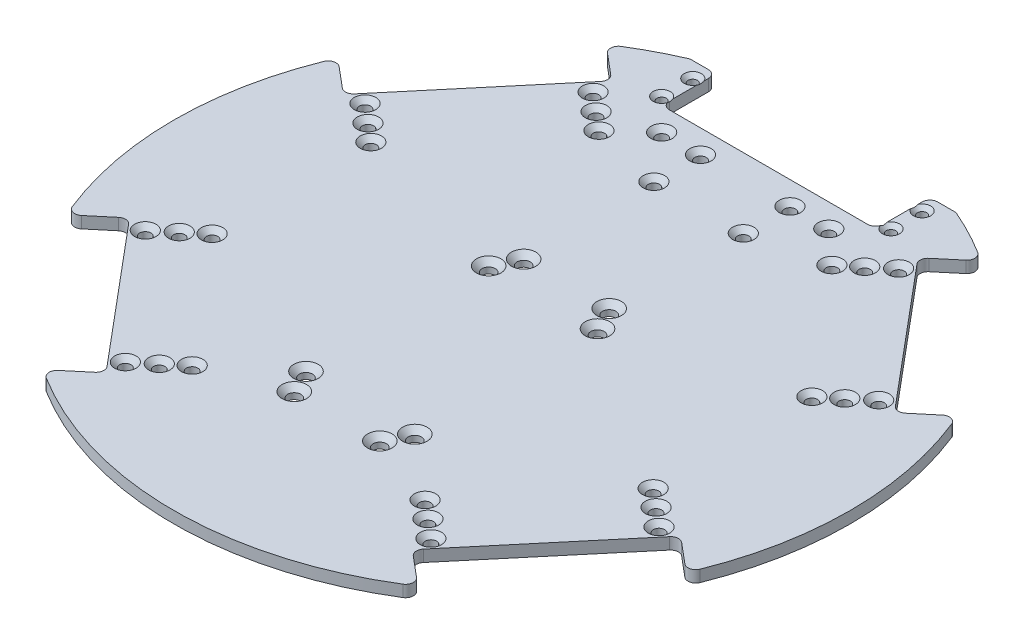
ISO-10303-21;
HEADER;
FILE_DESCRIPTION(('STEP AP214'),'2;1');
FILE_NAME('part.step','',(''),(''),'','','');
FILE_SCHEMA(('AUTOMOTIVE_DESIGN { 1 0 10303 214 1 1 1 1 }'));
ENDSEC;
DATA;
#1=APPLICATION_CONTEXT('core data for automotive mechanical design processes');
#2=APPLICATION_PROTOCOL_DEFINITION('international standard','automotive_design',2000,#1);
#3=PRODUCT_CONTEXT('',#1,'mechanical');
#4=PRODUCT('Part','Part','',(#3));
#5=PRODUCT_RELATED_PRODUCT_CATEGORY('part','',(#4));
#6=PRODUCT_DEFINITION_FORMATION('','',#4);
#7=PRODUCT_DEFINITION_CONTEXT('part definition',#1,'design');
#8=PRODUCT_DEFINITION('design','',#6,#7);
#9=PRODUCT_DEFINITION_SHAPE('','',#8);
#10=(LENGTH_UNIT() NAMED_UNIT(*) SI_UNIT(.MILLI.,.METRE.));
#11=(NAMED_UNIT(*) PLANE_ANGLE_UNIT() SI_UNIT($,.RADIAN.));
#12=(NAMED_UNIT(*) SI_UNIT($,.STERADIAN.) SOLID_ANGLE_UNIT());
#13=UNCERTAINTY_MEASURE_WITH_UNIT(LENGTH_MEASURE(1.E-05),#10,'distance_accuracy_value','');
#14=(GEOMETRIC_REPRESENTATION_CONTEXT(3) GLOBAL_UNCERTAINTY_ASSIGNED_CONTEXT((#13)) GLOBAL_UNIT_ASSIGNED_CONTEXT((#10,
#11,#12)) REPRESENTATION_CONTEXT('',''));
#15=CARTESIAN_POINT('',(0.,0.,0.));
#16=DIRECTION('',(0.,0.,1.));
#17=DIRECTION('',(1.,0.,0.));
#18=AXIS2_PLACEMENT_3D('',#15,#16,#17);
#19=CARTESIAN_POINT('',(0.,3.,0.));
#20=DIRECTION('',(0.,-1.,0.));
#21=DIRECTION('',(0.,0.,-1.));
#22=AXIS2_PLACEMENT_3D('',#19,#20,#21);
#23=CYLINDRICAL_SURFACE('',#22,87.);
#24=CARTESIAN_POINT('',(0.,3.,0.));
#25=DIRECTION('',(0.,1.,0.));
#26=DIRECTION('',(0.,0.,1.));
#27=AXIS2_PLACEMENT_3D('',#24,#25,#26);
#28=CIRCLE('',#27,87.);
#29=CARTESIAN_POINT('',(-34.5734842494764,3.,-79.8352941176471));
#30=VERTEX_POINT('',#29);
#31=CARTESIAN_POINT('',(-45.8895238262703,3.,-73.9131355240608));
#32=VERTEX_POINT('',#31);
#33=EDGE_CURVE('E658',#30,#32,#28,.T.);
#34=ORIENTED_EDGE('',*,*,#33,.F.);
#35=DIRECTION('',(0.,-1.,0.));
#36=VECTOR('',#35,1.);
#37=CARTESIAN_POINT('',(-34.5734842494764,3.,-79.8352941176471));
#38=LINE('',#37,#36);
#39=CARTESIAN_POINT('',(-34.5734842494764,0.,-79.8352941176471));
#40=VERTEX_POINT('',#39);
#41=EDGE_CURVE('E835',#30,#40,#38,.T.);
#42=ORIENTED_EDGE('',*,*,#41,.T.);
#43=CARTESIAN_POINT('',(0.,0.,0.));
#44=DIRECTION('',(0.,1.,0.));
#45=DIRECTION('',(0.,0.,1.));
#46=AXIS2_PLACEMENT_3D('',#43,#44,#45);
#47=CIRCLE('',#46,87.);
#48=CARTESIAN_POINT('',(-45.8895238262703,0.,-73.9131355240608));
#49=VERTEX_POINT('',#48);
#50=EDGE_CURVE('E663',#40,#49,#47,.T.);
#51=ORIENTED_EDGE('',*,*,#50,.T.);
#52=DIRECTION('',(0.,-1.,0.));
#53=VECTOR('',#52,1.);
#54=CARTESIAN_POINT('',(-45.8895238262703,3.,-73.9131355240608));
#55=LINE('',#54,#53);
#56=EDGE_CURVE('E752',#49,#32,#55,.F.);
#57=ORIENTED_EDGE('',*,*,#56,.T.);
#58=EDGE_LOOP('',(#34,#42,#51,#57));
#59=FACE_BOUND('',#58,.T.);
#60=ADVANCED_FACE('F34',(#59),#23,.T.);
#61=CARTESIAN_POINT('',(45.8895238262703,0.,-73.9131355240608));
#62=VERTEX_POINT('',#61);
#63=CARTESIAN_POINT('',(34.5734842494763,0.,-79.8352941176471));
#64=VERTEX_POINT('',#63);
#65=EDGE_CURVE('E2470',#62,#64,#47,.T.);
#66=ORIENTED_EDGE('',*,*,#65,.T.);
#67=DIRECTION('',(0.,-1.,0.));
#68=VECTOR('',#67,1.);
#69=CARTESIAN_POINT('',(34.5734842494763,3.,-79.8352941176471));
#70=LINE('',#69,#68);
#71=CARTESIAN_POINT('',(34.5734842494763,3.,-79.8352941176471));
#72=VERTEX_POINT('',#71);
#73=EDGE_CURVE('E860',#64,#72,#70,.F.);
#74=ORIENTED_EDGE('',*,*,#73,.T.);
#75=CARTESIAN_POINT('',(45.8895238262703,3.,-73.9131355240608));
#76=VERTEX_POINT('',#75);
#77=EDGE_CURVE('E654',#76,#72,#28,.T.);
#78=ORIENTED_EDGE('',*,*,#77,.F.);
#79=DIRECTION('',(0.,-1.,0.));
#80=VECTOR('',#79,1.);
#81=CARTESIAN_POINT('',(45.8895238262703,3.,-73.9131355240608));
#82=LINE('',#81,#80);
#83=EDGE_CURVE('E749',#76,#62,#82,.T.);
#84=ORIENTED_EDGE('',*,*,#83,.T.);
#85=EDGE_LOOP('',(#66,#74,#78,#84));
#86=FACE_BOUND('',#85,.T.);
#87=ADVANCED_FACE('F1370',(#86),#23,.T.);
#88=CARTESIAN_POINT('',(-45.8895238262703,3.,73.9131355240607));
#89=VERTEX_POINT('',#88);
#90=CARTESIAN_POINT('',(45.8895238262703,3.,73.9131355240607));
#91=VERTEX_POINT('',#90);
#92=EDGE_CURVE('E659',#89,#91,#28,.T.);
#93=ORIENTED_EDGE('',*,*,#92,.F.);
#94=DIRECTION('',(0.,-1.,0.));
#95=VECTOR('',#94,1.);
#96=CARTESIAN_POINT('',(-45.8895238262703,3.,73.9131355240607));
#97=LINE('',#96,#95);
#98=CARTESIAN_POINT('',(-45.8895238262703,0.,73.9131355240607));
#99=VERTEX_POINT('',#98);
#100=EDGE_CURVE('E679',#89,#99,#97,.T.);
#101=ORIENTED_EDGE('',*,*,#100,.T.);
#102=CARTESIAN_POINT('',(45.8895238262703,0.,73.9131355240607));
#103=VERTEX_POINT('',#102);
#104=EDGE_CURVE('E646',#99,#103,#47,.T.);
#105=ORIENTED_EDGE('',*,*,#104,.T.);
#106=DIRECTION('',(0.,-1.,0.));
#107=VECTOR('',#106,1.);
#108=CARTESIAN_POINT('',(45.8895238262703,3.,73.9131355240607));
#109=LINE('',#108,#107);
#110=EDGE_CURVE('E676',#103,#91,#109,.F.);
#111=ORIENTED_EDGE('',*,*,#110,.T.);
#112=EDGE_LOOP('',(#93,#101,#105,#111));
#113=FACE_BOUND('',#112,.T.);
#114=ADVANCED_FACE('F1375',(#113),#23,.T.);
#115=CARTESIAN_POINT('',(80.758861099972,0.,32.3574775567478));
#116=VERTEX_POINT('',#115);
#117=CARTESIAN_POINT('',(80.758861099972,0.,-32.3574775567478));
#118=VERTEX_POINT('',#117);
#119=EDGE_CURVE('E2409',#116,#118,#47,.T.);
#120=ORIENTED_EDGE('',*,*,#119,.T.);
#121=DIRECTION('',(0.,-1.,0.));
#122=VECTOR('',#121,1.);
#123=CARTESIAN_POINT('',(80.758861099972,3.,-32.3574775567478));
#124=LINE('',#123,#122);
#125=CARTESIAN_POINT('',(80.758861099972,3.,-32.3574775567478));
#126=VERTEX_POINT('',#125);
#127=EDGE_CURVE('E772',#118,#126,#124,.F.);
#128=ORIENTED_EDGE('',*,*,#127,.T.);
#129=CARTESIAN_POINT('',(80.758861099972,3.,32.3574775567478));
#130=VERTEX_POINT('',#129);
#131=EDGE_CURVE('E657',#130,#126,#28,.T.);
#132=ORIENTED_EDGE('',*,*,#131,.F.);
#133=DIRECTION('',(0.,-1.,0.));
#134=VECTOR('',#133,1.);
#135=CARTESIAN_POINT('',(80.758861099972,3.,32.3574775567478));
#136=LINE('',#135,#134);
#137=EDGE_CURVE('E769',#130,#116,#136,.T.);
#138=ORIENTED_EDGE('',*,*,#137,.T.);
#139=EDGE_LOOP('',(#120,#128,#132,#138));
#140=FACE_BOUND('',#139,.T.);
#141=ADVANCED_FACE('F1293',(#140),#23,.T.);
#142=CARTESIAN_POINT('',(-80.758861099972,0.,-32.3574775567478));
#143=VERTEX_POINT('',#142);
#144=CARTESIAN_POINT('',(-80.758861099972,0.,32.3574775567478));
#145=VERTEX_POINT('',#144);
#146=EDGE_CURVE('E660',#143,#145,#47,.T.);
#147=ORIENTED_EDGE('',*,*,#146,.T.);
#148=DIRECTION('',(0.,-1.,0.));
#149=VECTOR('',#148,1.);
#150=CARTESIAN_POINT('',(-80.758861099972,3.,32.3574775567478));
#151=LINE('',#150,#149);
#152=CARTESIAN_POINT('',(-80.758861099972,3.,32.3574775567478));
#153=VERTEX_POINT('',#152);
#154=EDGE_CURVE('E732',#145,#153,#151,.F.);
#155=ORIENTED_EDGE('',*,*,#154,.T.);
#156=CARTESIAN_POINT('',(-80.758861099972,3.,-32.3574775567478));
#157=VERTEX_POINT('',#156);
#158=EDGE_CURVE('E1382',#157,#153,#28,.T.);
#159=ORIENTED_EDGE('',*,*,#158,.F.);
#160=DIRECTION('',(0.,-1.,0.));
#161=VECTOR('',#160,1.);
#162=CARTESIAN_POINT('',(-80.758861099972,3.,-32.3574775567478));
#163=LINE('',#162,#161);
#164=EDGE_CURVE('E729',#157,#143,#163,.T.);
#165=ORIENTED_EDGE('',*,*,#164,.T.);
#166=EDGE_LOOP('',(#147,#155,#159,#165));
#167=FACE_BOUND('',#166,.T.);
#168=ADVANCED_FACE('F1287',(#167),#23,.T.);
#169=CARTESIAN_POINT('',(0.,3.,0.));
#170=DIRECTION('',(0.,1.,0.));
#171=DIRECTION('',(0.,0.,1.));
#172=AXIS2_PLACEMENT_3D('',#169,#170,#171);
#173=PLANE('',#172);
#174=CARTESIAN_POINT('',(-29.5,3.,-76.));
#175=DIRECTION('',(0.,1.,0.));
#176=DIRECTION('',(0.,0.,1.));
#177=AXIS2_PLACEMENT_3D('',#174,#175,#176);
#178=CIRCLE('',#177,2.2);
#179=CARTESIAN_POINT('',(-27.5,3.,-76.9165151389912));
#180=VERTEX_POINT('',#179);
#181=CARTESIAN_POINT('',(-27.5,3.,-75.0834848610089));
#182=VERTEX_POINT('',#181);
#183=EDGE_CURVE('E54',#180,#182,#178,.T.);
#184=ORIENTED_EDGE('',*,*,#183,.F.);
#185=DIRECTION('',(0.,0.,1.));
#186=VECTOR('',#185,1.);
#187=CARTESIAN_POINT('',(-27.5,3.,0.));
#188=LINE('',#187,#186);
#189=CARTESIAN_POINT('',(-27.5,3.,-78.));
#190=VERTEX_POINT('',#189);
#191=EDGE_CURVE('E350',#190,#180,#188,.T.);
#192=ORIENTED_EDGE('',*,*,#191,.F.);
#193=CARTESIAN_POINT('',(-29.5,3.,-78.));
#194=DIRECTION('',(0.,1.,0.));
#195=DIRECTION('',(0.,0.,1.));
#196=AXIS2_PLACEMENT_3D('',#193,#194,#195);
#197=CIRCLE('',#196,2.);
#198=CARTESIAN_POINT('',(-29.5,3.,-80.));
#199=VERTEX_POINT('',#198);
#200=EDGE_CURVE('E826',#190,#199,#197,.T.);
#201=ORIENTED_EDGE('',*,*,#200,.T.);
#202=DIRECTION('',(1.,0.,0.));
#203=VECTOR('',#202,1.);
#204=CARTESIAN_POINT('',(0.,3.,-80.));
#205=LINE('',#204,#203);
#206=CARTESIAN_POINT('',(-33.7786915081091,3.,-80.));
#207=VERTEX_POINT('',#206);
#208=EDGE_CURVE('E375',#207,#199,#205,.T.);
#209=ORIENTED_EDGE('',*,*,#208,.F.);
#210=CARTESIAN_POINT('',(-33.7786915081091,3.,-78.));
#211=DIRECTION('',(0.,1.,0.));
#212=DIRECTION('',(0.,0.,1.));
#213=AXIS2_PLACEMENT_3D('',#210,#211,#212);
#214=CIRCLE('',#213,2.);
#215=EDGE_CURVE('E833',#207,#30,#214,.T.);
#216=ORIENTED_EDGE('',*,*,#215,.T.);
#217=ORIENTED_EDGE('',*,*,#33,.T.);
#218=CARTESIAN_POINT('',(-44.8345922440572,3.,-72.2139829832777));
#219=DIRECTION('',(0.,1.,0.));
#220=DIRECTION('',(0.,0.,1.));
#221=AXIS2_PLACEMENT_3D('',#218,#219,#220);
#222=CIRCLE('',#221,2.);
#223=CARTESIAN_POINT('',(-46.1201674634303,3.,-70.6818940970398));
#224=VERTEX_POINT('',#223);
#225=EDGE_CURVE('E711',#32,#224,#222,.T.);
#226=ORIENTED_EDGE('',*,*,#225,.T.);
#227=DIRECTION('',(-0.766044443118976,0.,-0.642787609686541));
#228=VECTOR('',#227,1.);
#229=CARTESIAN_POINT('',(-39.3908466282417,3.,-65.0353234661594));
#230=LINE('',#229,#228);
#231=CARTESIAN_POINT('',(-40.9229355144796,3.,-66.3208986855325));
#232=VERTEX_POINT('',#231);
#233=EDGE_CURVE('E629',#232,#224,#230,.T.);
#234=ORIENTED_EDGE('',*,*,#233,.F.);
#235=CARTESIAN_POINT('',(-42.2085107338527,3.,-64.7888097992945));
#236=DIRECTION('',(0.,1.,0.));
#237=DIRECTION('',(0.,0.,1.));
#238=AXIS2_PLACEMENT_3D('',#235,#236,#237);
#239=CIRCLE('',#238,2.);
#240=CARTESIAN_POINT('',(-40.6764218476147,3.,-63.5032345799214));
#241=VERTEX_POINT('',#240);
#242=EDGE_CURVE('E801',#232,#241,#239,.F.);
#243=ORIENTED_EDGE('',*,*,#242,.T.);
#244=DIRECTION('',(0.642787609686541,0.,-0.766044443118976));
#245=VECTOR('',#244,1.);
#246=CARTESIAN_POINT('',(-39.3908466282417,3.,-65.0353234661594));
#247=LINE('',#246,#245);
#248=CARTESIAN_POINT('',(-69.6018642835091,3.,-29.0312346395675));
#249=VERTEX_POINT('',#248);
#250=EDGE_CURVE('E634',#249,#241,#247,.T.);
#251=ORIENTED_EDGE('',*,*,#250,.F.);
#252=CARTESIAN_POINT('',(-71.133953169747,3.,-30.3168098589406));
#253=DIRECTION('',(0.,1.,0.));
#254=DIRECTION('',(0.,0.,1.));
#255=AXIS2_PLACEMENT_3D('',#252,#253,#254);
#256=CIRCLE('',#255,2.);
#257=CARTESIAN_POINT('',(-72.4195283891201,3.,-28.7847209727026));
#258=VERTEX_POINT('',#257);
#259=EDGE_CURVE('E797',#249,#258,#256,.F.);
#260=ORIENTED_EDGE('',*,*,#259,.T.);
#261=DIRECTION('',(0.766044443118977,0.,0.642787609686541));
#262=VECTOR('',#261,1.);
#263=CARTESIAN_POINT('',(-70.8874395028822,3.,-27.4991457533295));
#264=LINE('',#263,#262);
#265=CARTESIAN_POINT('',(-77.6167603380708,3.,-33.1457163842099));
#266=VERTEX_POINT('',#265);
#267=EDGE_CURVE('E593',#266,#258,#264,.T.);
#268=ORIENTED_EDGE('',*,*,#267,.F.);
#269=CARTESIAN_POINT('',(-78.9023355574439,3.,-31.613627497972));
#270=DIRECTION('',(0.,1.,0.));
#271=DIRECTION('',(0.,0.,1.));
#272=AXIS2_PLACEMENT_3D('',#269,#270,#271);
#273=CIRCLE('',#272,2.);
#274=EDGE_CURVE('E713',#266,#157,#273,.T.);
#275=ORIENTED_EDGE('',*,*,#274,.T.);
#276=ORIENTED_EDGE('',*,*,#158,.T.);
#277=CARTESIAN_POINT('',(-78.9023355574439,3.,31.6136274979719));
#278=DIRECTION('',(0.,1.,0.));
#279=DIRECTION('',(0.,0.,1.));
#280=AXIS2_PLACEMENT_3D('',#277,#278,#279);
#281=CIRCLE('',#280,2.);
#282=CARTESIAN_POINT('',(-77.6167603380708,3.,33.1457163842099));
#283=VERTEX_POINT('',#282);
#284=EDGE_CURVE('E715',#153,#283,#281,.T.);
#285=ORIENTED_EDGE('',*,*,#284,.T.);
#286=DIRECTION('',(-0.766044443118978,0.,0.642787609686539));
#287=VECTOR('',#286,1.);
#288=CARTESIAN_POINT('',(-70.8874395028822,3.,27.4991457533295));
#289=LINE('',#288,#287);
#290=CARTESIAN_POINT('',(-72.4195283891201,3.,28.7847209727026));
#291=VERTEX_POINT('',#290);
#292=EDGE_CURVE('E614',#291,#283,#289,.T.);
#293=ORIENTED_EDGE('',*,*,#292,.F.);
#294=CARTESIAN_POINT('',(-71.133953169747,3.,30.3168098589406));
#295=DIRECTION('',(0.,1.,0.));
#296=DIRECTION('',(0.,0.,1.));
#297=AXIS2_PLACEMENT_3D('',#294,#295,#296);
#298=CIRCLE('',#297,2.);
#299=CARTESIAN_POINT('',(-69.6018642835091,3.,29.0312346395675));
#300=VERTEX_POINT('',#299);
#301=EDGE_CURVE('E793',#291,#300,#298,.F.);
#302=ORIENTED_EDGE('',*,*,#301,.T.);
#303=DIRECTION('',(-0.64278760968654,0.,-0.766044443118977));
#304=VECTOR('',#303,1.);
#305=CARTESIAN_POINT('',(-39.3908466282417,3.,65.0353234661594));
#306=LINE('',#305,#304);
#307=CARTESIAN_POINT('',(-40.6764218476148,3.,63.5032345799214));
#308=VERTEX_POINT('',#307);
#309=EDGE_CURVE('E620',#308,#300,#306,.T.);
#310=ORIENTED_EDGE('',*,*,#309,.F.);
#311=CARTESIAN_POINT('',(-42.2085107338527,3.,64.7888097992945));
#312=DIRECTION('',(0.,1.,0.));
#313=DIRECTION('',(0.,0.,1.));
#314=AXIS2_PLACEMENT_3D('',#311,#312,#313);
#315=CIRCLE('',#314,2.);
#316=CARTESIAN_POINT('',(-40.9229355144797,3.,66.3208986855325));
#317=VERTEX_POINT('',#316);
#318=EDGE_CURVE('E789',#308,#317,#315,.F.);
#319=ORIENTED_EDGE('',*,*,#318,.T.);
#320=DIRECTION('',(0.766044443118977,0.,-0.642787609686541));
#321=VECTOR('',#320,1.);
#322=CARTESIAN_POINT('',(-50.8975701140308,3.,74.690610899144));
#323=LINE('',#322,#321);
#324=CARTESIAN_POINT('',(-46.1201674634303,3.,70.6818940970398));
#325=VERTEX_POINT('',#324);
#326=EDGE_CURVE('E617',#325,#317,#323,.T.);
#327=ORIENTED_EDGE('',*,*,#326,.F.);
#328=CARTESIAN_POINT('',(-44.8345922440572,3.,72.2139829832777));
#329=DIRECTION('',(0.,1.,0.));
#330=DIRECTION('',(0.,0.,1.));
#331=AXIS2_PLACEMENT_3D('',#328,#329,#330);
#332=CIRCLE('',#331,2.);
#333=EDGE_CURVE('E717',#325,#89,#332,.T.);
#334=ORIENTED_EDGE('',*,*,#333,.T.);
#335=ORIENTED_EDGE('',*,*,#92,.T.);
#336=CARTESIAN_POINT('',(44.8345922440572,3.,72.2139829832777));
#337=DIRECTION('',(0.,1.,0.));
#338=DIRECTION('',(0.,0.,1.));
#339=AXIS2_PLACEMENT_3D('',#336,#337,#338);
#340=CIRCLE('',#339,2.);
#341=CARTESIAN_POINT('',(46.1201674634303,3.,70.6818940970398));
#342=VERTEX_POINT('',#341);
#343=EDGE_CURVE('E703',#91,#342,#340,.T.);
#344=ORIENTED_EDGE('',*,*,#343,.T.);
#345=DIRECTION('',(0.766044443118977,0.,0.642787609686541));
#346=VECTOR('',#345,1.);
#347=CARTESIAN_POINT('',(50.8975701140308,3.,74.690610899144));
#348=LINE('',#347,#346);
#349=CARTESIAN_POINT('',(40.9229355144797,3.,66.3208986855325));
#350=VERTEX_POINT('',#349);
#351=EDGE_CURVE('E598',#350,#342,#348,.T.);
#352=ORIENTED_EDGE('',*,*,#351,.F.);
#353=CARTESIAN_POINT('',(42.2085107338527,3.,64.7888097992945));
#354=DIRECTION('',(0.,1.,0.));
#355=DIRECTION('',(0.,0.,1.));
#356=AXIS2_PLACEMENT_3D('',#353,#354,#355);
#357=CIRCLE('',#356,2.);
#358=CARTESIAN_POINT('',(40.6764218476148,3.,63.5032345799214));
#359=VERTEX_POINT('',#358);
#360=EDGE_CURVE('E817',#350,#359,#357,.F.);
#361=ORIENTED_EDGE('',*,*,#360,.T.);
#362=DIRECTION('',(-0.64278760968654,0.,0.766044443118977));
#363=VECTOR('',#362,1.);
#364=CARTESIAN_POINT('',(39.3908466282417,3.,65.0353234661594));
#365=LINE('',#364,#363);
#366=CARTESIAN_POINT('',(69.6018642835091,3.,29.0312346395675));
#367=VERTEX_POINT('',#366);
#368=EDGE_CURVE('E605',#367,#359,#365,.T.);
#369=ORIENTED_EDGE('',*,*,#368,.F.);
#370=CARTESIAN_POINT('',(71.133953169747,3.,30.3168098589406));
#371=DIRECTION('',(0.,1.,0.));
#372=DIRECTION('',(0.,0.,1.));
#373=AXIS2_PLACEMENT_3D('',#370,#371,#372);
#374=CIRCLE('',#373,2.);
#375=CARTESIAN_POINT('',(72.4195283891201,3.,28.7847209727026));
#376=VERTEX_POINT('',#375);
#377=EDGE_CURVE('E813',#367,#376,#374,.F.);
#378=ORIENTED_EDGE('',*,*,#377,.T.);
#379=DIRECTION('',(-0.766044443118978,0.,-0.642787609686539));
#380=VECTOR('',#379,1.);
#381=CARTESIAN_POINT('',(70.8874395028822,3.,27.4991457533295));
#382=LINE('',#381,#380);
#383=CARTESIAN_POINT('',(77.6167603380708,3.,33.1457163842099));
#384=VERTEX_POINT('',#383);
#385=EDGE_CURVE('E602',#384,#376,#382,.T.);
#386=ORIENTED_EDGE('',*,*,#385,.F.);
#387=CARTESIAN_POINT('',(78.9023355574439,3.,31.6136274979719));
#388=DIRECTION('',(0.,1.,0.));
#389=DIRECTION('',(0.,0.,1.));
#390=AXIS2_PLACEMENT_3D('',#387,#388,#389);
#391=CIRCLE('',#390,2.);
#392=EDGE_CURVE('E705',#384,#130,#391,.T.);
#393=ORIENTED_EDGE('',*,*,#392,.T.);
#394=ORIENTED_EDGE('',*,*,#131,.T.);
#395=CARTESIAN_POINT('',(78.9023355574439,3.,-31.613627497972));
#396=DIRECTION('',(0.,1.,0.));
#397=DIRECTION('',(0.,0.,1.));
#398=AXIS2_PLACEMENT_3D('',#395,#396,#397);
#399=CIRCLE('',#398,2.);
#400=CARTESIAN_POINT('',(77.6167603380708,3.,-33.1457163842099));
#401=VERTEX_POINT('',#400);
#402=EDGE_CURVE('E707',#126,#401,#399,.T.);
#403=ORIENTED_EDGE('',*,*,#402,.T.);
#404=DIRECTION('',(0.766044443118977,0.,-0.642787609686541));
#405=VECTOR('',#404,1.);
#406=CARTESIAN_POINT('',(70.8874395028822,3.,-27.4991457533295));
#407=LINE('',#406,#405);
#408=CARTESIAN_POINT('',(72.4195283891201,3.,-28.7847209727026));
#409=VERTEX_POINT('',#408);
#410=EDGE_CURVE('E643',#409,#401,#407,.T.);
#411=ORIENTED_EDGE('',*,*,#410,.F.);
#412=CARTESIAN_POINT('',(71.133953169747,3.,-30.3168098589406));
#413=DIRECTION('',(0.,1.,0.));
#414=DIRECTION('',(0.,0.,1.));
#415=AXIS2_PLACEMENT_3D('',#412,#413,#414);
#416=CIRCLE('',#415,2.);
#417=CARTESIAN_POINT('',(69.6018642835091,3.,-29.0312346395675));
#418=VERTEX_POINT('',#417);
#419=EDGE_CURVE('E809',#409,#418,#416,.F.);
#420=ORIENTED_EDGE('',*,*,#419,.T.);
#421=DIRECTION('',(0.642787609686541,0.,0.766044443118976));
#422=VECTOR('',#421,1.);
#423=CARTESIAN_POINT('',(39.3908466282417,3.,-65.0353234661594));
#424=LINE('',#423,#422);
#425=CARTESIAN_POINT('',(40.6764218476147,3.,-63.5032345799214));
#426=VERTEX_POINT('',#425);
#427=EDGE_CURVE('E649',#426,#418,#424,.T.);
#428=ORIENTED_EDGE('',*,*,#427,.F.);
#429=CARTESIAN_POINT('',(42.2085107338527,3.,-64.7888097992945));
#430=DIRECTION('',(0.,1.,0.));
#431=DIRECTION('',(0.,0.,1.));
#432=AXIS2_PLACEMENT_3D('',#429,#430,#431);
#433=CIRCLE('',#432,2.);
#434=CARTESIAN_POINT('',(40.9229355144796,3.,-66.3208986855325));
#435=VERTEX_POINT('',#434);
#436=EDGE_CURVE('E805',#426,#435,#433,.F.);
#437=ORIENTED_EDGE('',*,*,#436,.T.);
#438=DIRECTION('',(-0.766044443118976,0.,0.642787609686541));
#439=VECTOR('',#438,1.);
#440=CARTESIAN_POINT('',(39.3908466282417,3.,-65.0353234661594));
#441=LINE('',#440,#439);
#442=CARTESIAN_POINT('',(46.1201674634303,3.,-70.6818940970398));
#443=VERTEX_POINT('',#442);
#444=EDGE_CURVE('E601',#443,#435,#441,.T.);
#445=ORIENTED_EDGE('',*,*,#444,.F.);
#446=CARTESIAN_POINT('',(44.8345922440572,3.,-72.2139829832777));
#447=DIRECTION('',(0.,1.,0.));
#448=DIRECTION('',(0.,0.,1.));
#449=AXIS2_PLACEMENT_3D('',#446,#447,#448);
#450=CIRCLE('',#449,2.);
#451=EDGE_CURVE('E709',#443,#76,#450,.T.);
#452=ORIENTED_EDGE('',*,*,#451,.T.);
#453=ORIENTED_EDGE('',*,*,#77,.T.);
#454=CARTESIAN_POINT('',(33.7786915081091,3.,-78.));
#455=DIRECTION('',(0.,1.,0.));
#456=DIRECTION('',(0.,0.,1.));
#457=AXIS2_PLACEMENT_3D('',#454,#455,#456);
#458=CIRCLE('',#457,2.);
#459=CARTESIAN_POINT('',(33.7786915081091,3.,-80.));
#460=VERTEX_POINT('',#459);
#461=EDGE_CURVE('E828',#72,#460,#458,.T.);
#462=ORIENTED_EDGE('',*,*,#461,.T.);
#463=CARTESIAN_POINT('',(29.5,3.,-80.));
#464=VERTEX_POINT('',#463);
#465=EDGE_CURVE('E372',#464,#460,#205,.T.);
#466=ORIENTED_EDGE('',*,*,#465,.F.);
#467=CARTESIAN_POINT('',(29.5,3.,-78.));
#468=DIRECTION('',(0.,1.,0.));
#469=DIRECTION('',(0.,0.,1.));
#470=AXIS2_PLACEMENT_3D('',#467,#468,#469);
#471=CIRCLE('',#470,2.);
#472=CARTESIAN_POINT('',(27.5,3.,-78.));
#473=VERTEX_POINT('',#472);
#474=EDGE_CURVE('E830',#464,#473,#471,.T.);
#475=ORIENTED_EDGE('',*,*,#474,.T.);
#476=DIRECTION('',(0.,0.,-1.));
#477=VECTOR('',#476,1.);
#478=CARTESIAN_POINT('',(27.5,3.,0.));
#479=LINE('',#478,#477);
#480=CARTESIAN_POINT('',(27.5,3.,-76.9165151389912));
#481=VERTEX_POINT('',#480);
#482=EDGE_CURVE('E362',#481,#473,#479,.T.);
#483=ORIENTED_EDGE('',*,*,#482,.F.);
#484=CARTESIAN_POINT('',(29.5,3.,-76.));
#485=DIRECTION('',(0.,1.,0.));
#486=DIRECTION('',(0.,0.,1.));
#487=AXIS2_PLACEMENT_3D('',#484,#485,#486);
#488=CIRCLE('',#487,2.2);
#489=CARTESIAN_POINT('',(27.5,3.,-75.0834848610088));
#490=VERTEX_POINT('',#489);
#491=EDGE_CURVE('E1036',#490,#481,#488,.T.);
#492=ORIENTED_EDGE('',*,*,#491,.F.);
#493=CARTESIAN_POINT('',(27.5,3.,-68.9165151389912));
#494=VERTEX_POINT('',#493);
#495=EDGE_CURVE('E369',#494,#490,#479,.T.);
#496=ORIENTED_EDGE('',*,*,#495,.F.);
#497=CARTESIAN_POINT('',(29.5,3.,-68.));
#498=DIRECTION('',(0.,1.,0.));
#499=DIRECTION('',(0.,0.,1.));
#500=AXIS2_PLACEMENT_3D('',#497,#498,#499);
#501=CIRCLE('',#500,2.2);
#502=CARTESIAN_POINT('',(27.395,3.,-67.3604884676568));
#503=VERTEX_POINT('',#502);
#504=EDGE_CURVE('E1479',#503,#494,#501,.T.);
#505=ORIENTED_EDGE('',*,*,#504,.F.);
#506=CARTESIAN_POINT('',(25.5,3.,-68.));
#507=DIRECTION('',(0.,1.,0.));
#508=DIRECTION('',(0.,0.,1.));
#509=AXIS2_PLACEMENT_3D('',#506,#507,#508);
#510=CIRCLE('',#509,2.);
#511=CARTESIAN_POINT('',(25.5,3.,-66.));
#512=VERTEX_POINT('',#511);
#513=EDGE_CURVE('E866',#503,#512,#510,.F.);
#514=ORIENTED_EDGE('',*,*,#513,.T.);
#515=DIRECTION('',(1.,0.,0.));
#516=VECTOR('',#515,1.);
#517=CARTESIAN_POINT('',(0.,3.,-66.));
#518=LINE('',#517,#516);
#519=CARTESIAN_POINT('',(-25.5,3.,-66.));
#520=VERTEX_POINT('',#519);
#521=EDGE_CURVE('E359',#520,#512,#518,.T.);
#522=ORIENTED_EDGE('',*,*,#521,.F.);
#523=CARTESIAN_POINT('',(-25.5,3.,-68.));
#524=DIRECTION('',(0.,1.,0.));
#525=DIRECTION('',(0.,0.,1.));
#526=AXIS2_PLACEMENT_3D('',#523,#524,#525);
#527=CIRCLE('',#526,2.);
#528=CARTESIAN_POINT('',(-27.395,3.,-67.3604884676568));
#529=VERTEX_POINT('',#528);
#530=EDGE_CURVE('E870',#520,#529,#527,.F.);
#531=ORIENTED_EDGE('',*,*,#530,.T.);
#532=CARTESIAN_POINT('',(-29.5,3.,-68.));
#533=DIRECTION('',(0.,1.,0.));
#534=DIRECTION('',(0.,0.,1.));
#535=AXIS2_PLACEMENT_3D('',#532,#533,#534);
#536=CIRCLE('',#535,2.2);
#537=CARTESIAN_POINT('',(-27.5,3.,-68.9165151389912));
#538=VERTEX_POINT('',#537);
#539=EDGE_CURVE('E61',#538,#529,#536,.T.);
#540=ORIENTED_EDGE('',*,*,#539,.F.);
#541=EDGE_CURVE('E351',#182,#538,#188,.T.);
#542=ORIENTED_EDGE('',*,*,#541,.F.);
#543=EDGE_LOOP('',(#184,#192,#201,#209,#216,#217,#226,#234,#243,#251,#260,#268,#275,#276,#285,
#293,#302,#310,#319,#327,#334,#335,#344,#352,#361,#369,#378,#386,#393,#394,#403,#411,#420,#428,
#437,#445,#452,#453,#462,#466,#475,#483,#492,#496,#505,#514,#522,#531,#540,#542));
#544=FACE_BOUND('',#543,.T.);
#545=CARTESIAN_POINT('',(11.,3.,-14.));
#546=DIRECTION('',(0.,1.,0.));
#547=DIRECTION('',(0.,0.,1.));
#548=AXIS2_PLACEMENT_3D('',#545,#546,#547);
#549=CIRCLE('',#548,3.15);
#550=CARTESIAN_POINT('',(11.,3.,-10.85));
#551=VERTEX_POINT('',#550);
#552=EDGE_CURVE('E983',#551,#551,#549,.T.);
#553=ORIENTED_EDGE('',*,*,#552,.F.);
#554=EDGE_LOOP('',(#553));
#555=FACE_BOUND('',#554,.T.);
#556=CARTESIAN_POINT('',(-11.,3.,-14.));
#557=DIRECTION('',(0.,1.,0.));
#558=DIRECTION('',(0.,0.,1.));
#559=AXIS2_PLACEMENT_3D('',#556,#557,#558);
#560=CIRCLE('',#559,3.15);
#561=CARTESIAN_POINT('',(-11.,3.,-10.85));
#562=VERTEX_POINT('',#561);
#563=EDGE_CURVE('E942',#562,#562,#560,.T.);
#564=ORIENTED_EDGE('',*,*,#563,.F.);
#565=EDGE_LOOP('',(#564));
#566=FACE_BOUND('',#565,.T.);
#567=CARTESIAN_POINT('',(-11.,3.,45.));
#568=DIRECTION('',(0.,1.,0.));
#569=DIRECTION('',(0.,0.,1.));
#570=AXIS2_PLACEMENT_3D('',#567,#568,#569);
#571=CIRCLE('',#570,3.15);
#572=CARTESIAN_POINT('',(-11.,3.,48.15));
#573=VERTEX_POINT('',#572);
#574=EDGE_CURVE('E937',#573,#573,#571,.T.);
#575=ORIENTED_EDGE('',*,*,#574,.F.);
#576=EDGE_LOOP('',(#575));
#577=FACE_BOUND('',#576,.T.);
#578=CARTESIAN_POINT('',(11.,3.,45.));
#579=DIRECTION('',(0.,1.,0.));
#580=DIRECTION('',(0.,0.,1.));
#581=AXIS2_PLACEMENT_3D('',#578,#579,#580);
#582=CIRCLE('',#581,3.15);
#583=CARTESIAN_POINT('',(11.,3.,48.15));
#584=VERTEX_POINT('',#583);
#585=EDGE_CURVE('E932',#584,#584,#582,.T.);
#586=ORIENTED_EDGE('',*,*,#585,.F.);
#587=EDGE_LOOP('',(#586));
#588=FACE_BOUND('',#587,.T.);
#589=CARTESIAN_POINT('',(-14.,3.,39.));
#590=DIRECTION('',(0.,1.,0.));
#591=DIRECTION('',(0.,0.,1.));
#592=AXIS2_PLACEMENT_3D('',#589,#590,#591);
#593=CIRCLE('',#592,3.15);
#594=CARTESIAN_POINT('',(-14.,3.,42.15));
#595=VERTEX_POINT('',#594);
#596=EDGE_CURVE('E927',#595,#595,#593,.T.);
#597=ORIENTED_EDGE('',*,*,#596,.F.);
#598=EDGE_LOOP('',(#597));
#599=FACE_BOUND('',#598,.T.);
#600=CARTESIAN_POINT('',(14.,3.,39.));
#601=DIRECTION('',(0.,1.,0.));
#602=DIRECTION('',(0.,0.,1.));
#603=AXIS2_PLACEMENT_3D('',#600,#601,#602);
#604=CIRCLE('',#603,3.15);
#605=CARTESIAN_POINT('',(14.,3.,42.15));
#606=VERTEX_POINT('',#605);
#607=EDGE_CURVE('E922',#606,#606,#604,.T.);
#608=ORIENTED_EDGE('',*,*,#607,.F.);
#609=EDGE_LOOP('',(#608));
#610=FACE_BOUND('',#609,.T.);
#611=CARTESIAN_POINT('',(-14.,3.,-7.99999999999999));
#612=DIRECTION('',(0.,1.,0.));
#613=DIRECTION('',(0.,0.,1.));
#614=AXIS2_PLACEMENT_3D('',#611,#612,#613);
#615=CIRCLE('',#614,3.15);
#616=CARTESIAN_POINT('',(-14.,3.,-4.84999999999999));
#617=VERTEX_POINT('',#616);
#618=EDGE_CURVE('E917',#617,#617,#615,.T.);
#619=ORIENTED_EDGE('',*,*,#618,.F.);
#620=EDGE_LOOP('',(#619));
#621=FACE_BOUND('',#620,.T.);
#622=CARTESIAN_POINT('',(14.,3.,-7.99999999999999));
#623=DIRECTION('',(0.,1.,0.));
#624=DIRECTION('',(0.,0.,1.));
#625=AXIS2_PLACEMENT_3D('',#622,#623,#624);
#626=CIRCLE('',#625,3.15);
#627=CARTESIAN_POINT('',(14.,3.,-4.84999999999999));
#628=VERTEX_POINT('',#627);
#629=EDGE_CURVE('E912',#628,#628,#626,.T.);
#630=ORIENTED_EDGE('',*,*,#629,.F.);
#631=EDGE_LOOP('',(#630));
#632=FACE_BOUND('',#631,.T.);
#633=CARTESIAN_POINT('',(-21.5,3.,-60.));
#634=DIRECTION('',(0.,1.,0.));
#635=DIRECTION('',(0.,0.,1.));
#636=AXIS2_PLACEMENT_3D('',#633,#634,#635);
#637=CIRCLE('',#636,2.75);
#638=CARTESIAN_POINT('',(-21.5,3.,-57.25));
#639=VERTEX_POINT('',#638);
#640=EDGE_CURVE('E907',#639,#639,#637,.T.);
#641=ORIENTED_EDGE('',*,*,#640,.F.);
#642=EDGE_LOOP('',(#641));
#643=FACE_BOUND('',#642,.T.);
#644=CARTESIAN_POINT('',(-11.5,3.,-60.));
#645=DIRECTION('',(0.,1.,0.));
#646=DIRECTION('',(0.,0.,1.));
#647=AXIS2_PLACEMENT_3D('',#644,#645,#646);
#648=CIRCLE('',#647,2.75);
#649=CARTESIAN_POINT('',(-11.5,3.,-57.25));
#650=VERTEX_POINT('',#649);
#651=EDGE_CURVE('E902',#650,#650,#648,.T.);
#652=ORIENTED_EDGE('',*,*,#651,.F.);
#653=EDGE_LOOP('',(#652));
#654=FACE_BOUND('',#653,.T.);
#655=CARTESIAN_POINT('',(-11.5,3.,-48.));
#656=DIRECTION('',(0.,1.,0.));
#657=DIRECTION('',(0.,0.,1.));
#658=AXIS2_PLACEMENT_3D('',#655,#656,#657);
#659=CIRCLE('',#658,2.75);
#660=CARTESIAN_POINT('',(-11.5,3.,-45.25));
#661=VERTEX_POINT('',#660);
#662=EDGE_CURVE('E897',#661,#661,#659,.T.);
#663=ORIENTED_EDGE('',*,*,#662,.F.);
#664=EDGE_LOOP('',(#663));
#665=FACE_BOUND('',#664,.T.);
#666=CARTESIAN_POINT('',(11.5,3.,-48.));
#667=DIRECTION('',(0.,1.,0.));
#668=DIRECTION('',(0.,0.,1.));
#669=AXIS2_PLACEMENT_3D('',#666,#667,#668);
#670=CIRCLE('',#669,2.75);
#671=CARTESIAN_POINT('',(11.5,3.,-45.25));
#672=VERTEX_POINT('',#671);
#673=EDGE_CURVE('E892',#672,#672,#670,.T.);
#674=ORIENTED_EDGE('',*,*,#673,.F.);
#675=EDGE_LOOP('',(#674));
#676=FACE_BOUND('',#675,.T.);
#677=CARTESIAN_POINT('',(11.5,3.,-60.));
#678=DIRECTION('',(0.,1.,0.));
#679=DIRECTION('',(0.,0.,1.));
#680=AXIS2_PLACEMENT_3D('',#677,#678,#679);
#681=CIRCLE('',#680,2.75);
#682=CARTESIAN_POINT('',(11.5,3.,-57.25));
#683=VERTEX_POINT('',#682);
#684=EDGE_CURVE('E887',#683,#683,#681,.T.);
#685=ORIENTED_EDGE('',*,*,#684,.F.);
#686=EDGE_LOOP('',(#685));
#687=FACE_BOUND('',#686,.T.);
#688=CARTESIAN_POINT('',(21.5,3.,-60.));
#689=DIRECTION('',(0.,1.,0.));
#690=DIRECTION('',(0.,0.,1.));
#691=AXIS2_PLACEMENT_3D('',#688,#689,#690);
#692=CIRCLE('',#691,2.75);
#693=CARTESIAN_POINT('',(21.5,3.,-57.25));
#694=VERTEX_POINT('',#693);
#695=EDGE_CURVE('E882',#694,#694,#692,.T.);
#696=ORIENTED_EDGE('',*,*,#695,.F.);
#697=EDGE_LOOP('',(#696));
#698=FACE_BOUND('',#697,.T.);
#699=CARTESIAN_POINT('',(-66.0738528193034,3.,28.2574387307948));
#700=DIRECTION('',(0.,1.,0.));
#701=DIRECTION('',(0.,0.,1.));
#702=AXIS2_PLACEMENT_3D('',#699,#700,#701);
#703=CIRCLE('',#702,2.75);
#704=CARTESIAN_POINT('',(-66.0738528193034,3.,31.0074387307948));
#705=VERTEX_POINT('',#704);
#706=EDGE_CURVE('E376',#705,#705,#703,.T.);
#707=ORIENTED_EDGE('',*,*,#706,.F.);
#708=EDGE_LOOP('',(#707));
#709=FACE_BOUND('',#708,.T.);
#710=CARTESIAN_POINT('',(-61.3243772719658,3.,24.2721555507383));
#711=DIRECTION('',(0.,1.,0.));
#712=DIRECTION('',(0.,0.,1.));
#713=AXIS2_PLACEMENT_3D('',#710,#711,#712);
#714=CIRCLE('',#713,2.75);
#715=CARTESIAN_POINT('',(-61.3243772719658,3.,27.0221555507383));
#716=VERTEX_POINT('',#715);
#717=EDGE_CURVE('E386',#716,#716,#714,.T.);
#718=ORIENTED_EDGE('',*,*,#717,.F.);
#719=EDGE_LOOP('',(#718));
#720=FACE_BOUND('',#719,.T.);
#721=CARTESIAN_POINT('',(-56.7281106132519,3.,20.415429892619));
#722=DIRECTION('',(0.,1.,0.));
#723=DIRECTION('',(0.,0.,1.));
#724=AXIS2_PLACEMENT_3D('',#721,#722,#723);
#725=CIRCLE('',#724,2.75);
#726=CARTESIAN_POINT('',(-56.7281106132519,3.,23.165429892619));
#727=VERTEX_POINT('',#726);
#728=EDGE_CURVE('E395',#727,#727,#725,.T.);
#729=ORIENTED_EDGE('',*,*,#728,.F.);
#730=EDGE_LOOP('',(#729));
#731=FACE_BOUND('',#730,.T.);
#732=CARTESIAN_POINT('',(-39.301748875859,3.,60.1631897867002));
#733=DIRECTION('',(0.,1.,0.));
#734=DIRECTION('',(0.,0.,1.));
#735=AXIS2_PLACEMENT_3D('',#732,#733,#734);
#736=CIRCLE('',#735,2.75);
#737=CARTESIAN_POINT('',(-39.301748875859,3.,62.9131897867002));
#738=VERTEX_POINT('',#737);
#739=EDGE_CURVE('E404',#738,#738,#736,.T.);
#740=ORIENTED_EDGE('',*,*,#739,.F.);
#741=EDGE_LOOP('',(#740));
#742=FACE_BOUND('',#741,.T.);
#743=CARTESIAN_POINT('',(-34.5522733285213,3.,56.1779066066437));
#744=DIRECTION('',(0.,1.,0.));
#745=DIRECTION('',(0.,0.,1.));
#746=AXIS2_PLACEMENT_3D('',#743,#744,#745);
#747=CIRCLE('',#746,2.75);
#748=CARTESIAN_POINT('',(-34.5522733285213,3.,58.9279066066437));
#749=VERTEX_POINT('',#748);
#750=EDGE_CURVE('E413',#749,#749,#747,.T.);
#751=ORIENTED_EDGE('',*,*,#750,.F.);
#752=EDGE_LOOP('',(#751));
#753=FACE_BOUND('',#752,.T.);
#754=CARTESIAN_POINT('',(-29.9560066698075,3.,52.3211809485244));
#755=DIRECTION('',(0.,1.,0.));
#756=DIRECTION('',(0.,0.,1.));
#757=AXIS2_PLACEMENT_3D('',#754,#755,#756);
#758=CIRCLE('',#757,2.75);
#759=CARTESIAN_POINT('',(-29.9560066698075,3.,55.0711809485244));
#760=VERTEX_POINT('',#759);
#761=EDGE_CURVE('E422',#760,#760,#758,.T.);
#762=ORIENTED_EDGE('',*,*,#761,.F.);
#763=EDGE_LOOP('',(#762));
#764=FACE_BOUND('',#763,.T.);
#765=CARTESIAN_POINT('',(-66.0738528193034,3.,-28.2574387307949));
#766=DIRECTION('',(0.,1.,0.));
#767=DIRECTION('',(0.,0.,1.));
#768=AXIS2_PLACEMENT_3D('',#765,#766,#767);
#769=CIRCLE('',#768,2.75);
#770=CARTESIAN_POINT('',(-66.0738528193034,3.,-25.5074387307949));
#771=VERTEX_POINT('',#770);
#772=EDGE_CURVE('E431',#771,#771,#769,.T.);
#773=ORIENTED_EDGE('',*,*,#772,.F.);
#774=EDGE_LOOP('',(#773));
#775=FACE_BOUND('',#774,.T.);
#776=CARTESIAN_POINT('',(-61.3243772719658,3.,-24.2721555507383));
#777=DIRECTION('',(0.,1.,0.));
#778=DIRECTION('',(0.,0.,1.));
#779=AXIS2_PLACEMENT_3D('',#776,#777,#778);
#780=CIRCLE('',#779,2.75);
#781=CARTESIAN_POINT('',(-61.3243772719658,3.,-21.5221555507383));
#782=VERTEX_POINT('',#781);
#783=EDGE_CURVE('E440',#782,#782,#780,.T.);
#784=ORIENTED_EDGE('',*,*,#783,.F.);
#785=EDGE_LOOP('',(#784));
#786=FACE_BOUND('',#785,.T.);
#787=CARTESIAN_POINT('',(-56.7281106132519,3.,-20.4154298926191));
#788=DIRECTION('',(0.,1.,0.));
#789=DIRECTION('',(0.,0.,1.));
#790=AXIS2_PLACEMENT_3D('',#787,#788,#789);
#791=CIRCLE('',#790,2.75);
#792=CARTESIAN_POINT('',(-56.7281106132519,3.,-17.6654298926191));
#793=VERTEX_POINT('',#792);
#794=EDGE_CURVE('E449',#793,#793,#791,.T.);
#795=ORIENTED_EDGE('',*,*,#794,.F.);
#796=EDGE_LOOP('',(#795));
#797=FACE_BOUND('',#796,.T.);
#798=CARTESIAN_POINT('',(-39.3017488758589,3.,-60.1631897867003));
#799=DIRECTION('',(0.,1.,0.));
#800=DIRECTION('',(0.,0.,1.));
#801=AXIS2_PLACEMENT_3D('',#798,#799,#800);
#802=CIRCLE('',#801,2.75);
#803=CARTESIAN_POINT('',(-39.3017488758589,3.,-57.4131897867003));
#804=VERTEX_POINT('',#803);
#805=EDGE_CURVE('E458',#804,#804,#802,.T.);
#806=ORIENTED_EDGE('',*,*,#805,.F.);
#807=EDGE_LOOP('',(#806));
#808=FACE_BOUND('',#807,.T.);
#809=CARTESIAN_POINT('',(-34.5522733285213,3.,-56.1779066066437));
#810=DIRECTION('',(0.,1.,0.));
#811=DIRECTION('',(0.,0.,1.));
#812=AXIS2_PLACEMENT_3D('',#809,#810,#811);
#813=CIRCLE('',#812,2.75);
#814=CARTESIAN_POINT('',(-34.5522733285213,3.,-53.4279066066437));
#815=VERTEX_POINT('',#814);
#816=EDGE_CURVE('E467',#815,#815,#813,.T.);
#817=ORIENTED_EDGE('',*,*,#816,.F.);
#818=EDGE_LOOP('',(#817));
#819=FACE_BOUND('',#818,.T.);
#820=CARTESIAN_POINT('',(-29.9560066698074,3.,-52.3211809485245));
#821=DIRECTION('',(0.,1.,0.));
#822=DIRECTION('',(0.,0.,1.));
#823=AXIS2_PLACEMENT_3D('',#820,#821,#822);
#824=CIRCLE('',#823,2.75);
#825=CARTESIAN_POINT('',(-29.9560066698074,3.,-49.5711809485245));
#826=VERTEX_POINT('',#825);
#827=EDGE_CURVE('E476',#826,#826,#824,.T.);
#828=ORIENTED_EDGE('',*,*,#827,.F.);
#829=EDGE_LOOP('',(#828));
#830=FACE_BOUND('',#829,.T.);
#831=CARTESIAN_POINT('',(39.3017488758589,3.,-60.1631897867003));
#832=DIRECTION('',(0.,1.,0.));
#833=DIRECTION('',(0.,0.,1.));
#834=AXIS2_PLACEMENT_3D('',#831,#832,#833);
#835=CIRCLE('',#834,2.75);
#836=CARTESIAN_POINT('',(39.3017488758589,3.,-57.4131897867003));
#837=VERTEX_POINT('',#836);
#838=EDGE_CURVE('E485',#837,#837,#835,.T.);
#839=ORIENTED_EDGE('',*,*,#838,.F.);
#840=EDGE_LOOP('',(#839));
#841=FACE_BOUND('',#840,.T.);
#842=CARTESIAN_POINT('',(34.5522733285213,3.,-56.1779066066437));
#843=DIRECTION('',(0.,1.,0.));
#844=DIRECTION('',(0.,0.,1.));
#845=AXIS2_PLACEMENT_3D('',#842,#843,#844);
#846=CIRCLE('',#845,2.75);
#847=CARTESIAN_POINT('',(34.5522733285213,3.,-53.4279066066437));
#848=VERTEX_POINT('',#847);
#849=EDGE_CURVE('E494',#848,#848,#846,.T.);
#850=ORIENTED_EDGE('',*,*,#849,.F.);
#851=EDGE_LOOP('',(#850));
#852=FACE_BOUND('',#851,.T.);
#853=CARTESIAN_POINT('',(29.9560066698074,3.,-52.3211809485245));
#854=DIRECTION('',(0.,1.,0.));
#855=DIRECTION('',(0.,0.,1.));
#856=AXIS2_PLACEMENT_3D('',#853,#854,#855);
#857=CIRCLE('',#856,2.75);
#858=CARTESIAN_POINT('',(29.9560066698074,3.,-49.5711809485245));
#859=VERTEX_POINT('',#858);
#860=EDGE_CURVE('E503',#859,#859,#857,.T.);
#861=ORIENTED_EDGE('',*,*,#860,.F.);
#862=EDGE_LOOP('',(#861));
#863=FACE_BOUND('',#862,.T.);
#864=CARTESIAN_POINT('',(66.0738528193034,3.,-28.2574387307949));
#865=DIRECTION('',(0.,1.,0.));
#866=DIRECTION('',(0.,0.,1.));
#867=AXIS2_PLACEMENT_3D('',#864,#865,#866);
#868=CIRCLE('',#867,2.75);
#869=CARTESIAN_POINT('',(66.0738528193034,3.,-25.5074387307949));
#870=VERTEX_POINT('',#869);
#871=EDGE_CURVE('E512',#870,#870,#868,.T.);
#872=ORIENTED_EDGE('',*,*,#871,.F.);
#873=EDGE_LOOP('',(#872));
#874=FACE_BOUND('',#873,.T.);
#875=CARTESIAN_POINT('',(61.3243772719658,3.,-24.2721555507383));
#876=DIRECTION('',(0.,1.,0.));
#877=DIRECTION('',(0.,0.,1.));
#878=AXIS2_PLACEMENT_3D('',#875,#876,#877);
#879=CIRCLE('',#878,2.75);
#880=CARTESIAN_POINT('',(61.3243772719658,3.,-21.5221555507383));
#881=VERTEX_POINT('',#880);
#882=EDGE_CURVE('E521',#881,#881,#879,.T.);
#883=ORIENTED_EDGE('',*,*,#882,.F.);
#884=EDGE_LOOP('',(#883));
#885=FACE_BOUND('',#884,.T.);
#886=CARTESIAN_POINT('',(56.7281106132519,3.,-20.4154298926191));
#887=DIRECTION('',(0.,1.,0.));
#888=DIRECTION('',(0.,0.,1.));
#889=AXIS2_PLACEMENT_3D('',#886,#887,#888);
#890=CIRCLE('',#889,2.75);
#891=CARTESIAN_POINT('',(56.7281106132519,3.,-17.6654298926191));
#892=VERTEX_POINT('',#891);
#893=EDGE_CURVE('E530',#892,#892,#890,.T.);
#894=ORIENTED_EDGE('',*,*,#893,.F.);
#895=EDGE_LOOP('',(#894));
#896=FACE_BOUND('',#895,.T.);
#897=CARTESIAN_POINT('',(66.0738528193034,3.,28.2574387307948));
#898=DIRECTION('',(0.,1.,0.));
#899=DIRECTION('',(0.,0.,1.));
#900=AXIS2_PLACEMENT_3D('',#897,#898,#899);
#901=CIRCLE('',#900,2.75);
#902=CARTESIAN_POINT('',(66.0738528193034,3.,31.0074387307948));
#903=VERTEX_POINT('',#902);
#904=EDGE_CURVE('E539',#903,#903,#901,.T.);
#905=ORIENTED_EDGE('',*,*,#904,.F.);
#906=EDGE_LOOP('',(#905));
#907=FACE_BOUND('',#906,.T.);
#908=CARTESIAN_POINT('',(61.3243772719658,3.,24.2721555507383));
#909=DIRECTION('',(0.,1.,0.));
#910=DIRECTION('',(0.,0.,1.));
#911=AXIS2_PLACEMENT_3D('',#908,#909,#910);
#912=CIRCLE('',#911,2.75);
#913=CARTESIAN_POINT('',(61.3243772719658,3.,27.0221555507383));
#914=VERTEX_POINT('',#913);
#915=EDGE_CURVE('E548',#914,#914,#912,.T.);
#916=ORIENTED_EDGE('',*,*,#915,.F.);
#917=EDGE_LOOP('',(#916));
#918=FACE_BOUND('',#917,.T.);
#919=CARTESIAN_POINT('',(56.7281106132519,3.,20.415429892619));
#920=DIRECTION('',(0.,1.,0.));
#921=DIRECTION('',(0.,0.,1.));
#922=AXIS2_PLACEMENT_3D('',#919,#920,#921);
#923=CIRCLE('',#922,2.75);
#924=CARTESIAN_POINT('',(56.7281106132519,3.,23.165429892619));
#925=VERTEX_POINT('',#924);
#926=EDGE_CURVE('E557',#925,#925,#923,.T.);
#927=ORIENTED_EDGE('',*,*,#926,.F.);
#928=EDGE_LOOP('',(#927));
#929=FACE_BOUND('',#928,.T.);
#930=CARTESIAN_POINT('',(29.9560066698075,3.,52.3211809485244));
#931=DIRECTION('',(0.,1.,0.));
#932=DIRECTION('',(0.,0.,1.));
#933=AXIS2_PLACEMENT_3D('',#930,#931,#932);
#934=CIRCLE('',#933,2.75);
#935=CARTESIAN_POINT('',(29.9560066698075,3.,55.0711809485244));
#936=VERTEX_POINT('',#935);
#937=EDGE_CURVE('E566',#936,#936,#934,.T.);
#938=ORIENTED_EDGE('',*,*,#937,.F.);
#939=EDGE_LOOP('',(#938));
#940=FACE_BOUND('',#939,.T.);
#941=CARTESIAN_POINT('',(34.5522733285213,3.,56.1779066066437));
#942=DIRECTION('',(0.,1.,0.));
#943=DIRECTION('',(0.,0.,1.));
#944=AXIS2_PLACEMENT_3D('',#941,#942,#943);
#945=CIRCLE('',#944,2.75);
#946=CARTESIAN_POINT('',(34.5522733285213,3.,58.9279066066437));
#947=VERTEX_POINT('',#946);
#948=EDGE_CURVE('E575',#947,#947,#945,.T.);
#949=ORIENTED_EDGE('',*,*,#948,.F.);
#950=EDGE_LOOP('',(#949));
#951=FACE_BOUND('',#950,.T.);
#952=CARTESIAN_POINT('',(39.301748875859,3.,60.1631897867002));
#953=DIRECTION('',(0.,1.,0.));
#954=DIRECTION('',(0.,0.,1.));
#955=AXIS2_PLACEMENT_3D('',#952,#953,#954);
#956=CIRCLE('',#955,2.75);
#957=CARTESIAN_POINT('',(39.301748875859,3.,62.9131897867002));
#958=VERTEX_POINT('',#957);
#959=EDGE_CURVE('E584',#958,#958,#956,.T.);
#960=ORIENTED_EDGE('',*,*,#959,.F.);
#961=EDGE_LOOP('',(#960));
#962=FACE_BOUND('',#961,.T.);
#963=ADVANCED_FACE('F348',(#544,#555,#566,#577,#588,#599,#610,#621,#632,#643,#654,#665,#676,
#687,#698,#709,#720,#731,#742,#753,#764,#775,#786,#797,#808,#819,#830,#841,#852,#863,#874,#885,
#896,#907,#918,#929,#940,#951,#962),#173,.T.);
#964=CARTESIAN_POINT('',(0.,0.,0.));
#965=DIRECTION('',(0.,1.,0.));
#966=DIRECTION('',(0.,0.,1.));
#967=AXIS2_PLACEMENT_3D('',#964,#965,#966);
#968=PLANE('',#967);
#969=CARTESIAN_POINT('',(-29.5,0.,-76.));
#970=DIRECTION('',(0.,1.,0.));
#971=DIRECTION('',(0.,0.,1.));
#972=AXIS2_PLACEMENT_3D('',#969,#970,#971);
#973=CIRCLE('',#972,1.2);
#974=CARTESIAN_POINT('',(-29.5,0.,-74.8));
#975=VERTEX_POINT('',#974);
#976=EDGE_CURVE('E1492',#975,#975,#973,.T.);
#977=ORIENTED_EDGE('',*,*,#976,.T.);
#978=EDGE_LOOP('',(#977));
#979=FACE_BOUND('',#978,.T.);
#980=CARTESIAN_POINT('',(-29.5,0.,-68.));
#981=DIRECTION('',(0.,1.,0.));
#982=DIRECTION('',(0.,0.,1.));
#983=AXIS2_PLACEMENT_3D('',#980,#981,#982);
#984=CIRCLE('',#983,1.2);
#985=CARTESIAN_POINT('',(-29.5,0.,-66.8));
#986=VERTEX_POINT('',#985);
#987=EDGE_CURVE('E1033',#986,#986,#984,.T.);
#988=ORIENTED_EDGE('',*,*,#987,.T.);
#989=EDGE_LOOP('',(#988));
#990=FACE_BOUND('',#989,.T.);
#991=CARTESIAN_POINT('',(29.5,0.,-76.));
#992=DIRECTION('',(0.,1.,0.));
#993=DIRECTION('',(0.,0.,1.));
#994=AXIS2_PLACEMENT_3D('',#991,#992,#993);
#995=CIRCLE('',#994,1.2);
#996=CARTESIAN_POINT('',(29.5,0.,-74.8));
#997=VERTEX_POINT('',#996);
#998=EDGE_CURVE('E1003',#997,#997,#995,.T.);
#999=ORIENTED_EDGE('',*,*,#998,.T.);
#1000=EDGE_LOOP('',(#999));
#1001=FACE_BOUND('',#1000,.T.);
#1002=CARTESIAN_POINT('',(29.5,0.,-68.));
#1003=DIRECTION('',(0.,1.,0.));
#1004=DIRECTION('',(0.,0.,1.));
#1005=AXIS2_PLACEMENT_3D('',#1002,#1003,#1004);
#1006=CIRCLE('',#1005,1.2);
#1007=CARTESIAN_POINT('',(29.5,0.,-66.8));
#1008=VERTEX_POINT('',#1007);
#1009=EDGE_CURVE('E953',#1008,#1008,#1006,.T.);
#1010=ORIENTED_EDGE('',*,*,#1009,.T.);
#1011=EDGE_LOOP('',(#1010));
#1012=FACE_BOUND('',#1011,.T.);
#1013=CARTESIAN_POINT('',(11.,0.,-14.));
#1014=DIRECTION('',(0.,1.,0.));
#1015=DIRECTION('',(0.,0.,1.));
#1016=AXIS2_PLACEMENT_3D('',#1013,#1014,#1015);
#1017=CIRCLE('',#1016,1.7);
#1018=CARTESIAN_POINT('',(11.,0.,-12.3));
#1019=VERTEX_POINT('',#1018);
#1020=EDGE_CURVE('E939',#1019,#1019,#1017,.T.);
#1021=ORIENTED_EDGE('',*,*,#1020,.T.);
#1022=EDGE_LOOP('',(#1021));
#1023=FACE_BOUND('',#1022,.T.);
#1024=CARTESIAN_POINT('',(-11.,0.,-14.));
#1025=DIRECTION('',(0.,1.,0.));
#1026=DIRECTION('',(0.,0.,1.));
#1027=AXIS2_PLACEMENT_3D('',#1024,#1025,#1026);
#1028=CIRCLE('',#1027,1.7);
#1029=CARTESIAN_POINT('',(-11.,0.,-12.3));
#1030=VERTEX_POINT('',#1029);
#1031=EDGE_CURVE('E934',#1030,#1030,#1028,.T.);
#1032=ORIENTED_EDGE('',*,*,#1031,.T.);
#1033=EDGE_LOOP('',(#1032));
#1034=FACE_BOUND('',#1033,.T.);
#1035=CARTESIAN_POINT('',(-11.,0.,45.));
#1036=DIRECTION('',(0.,1.,0.));
#1037=DIRECTION('',(0.,0.,1.));
#1038=AXIS2_PLACEMENT_3D('',#1035,#1036,#1037);
#1039=CIRCLE('',#1038,1.7);
#1040=CARTESIAN_POINT('',(-11.,0.,46.7));
#1041=VERTEX_POINT('',#1040);
#1042=EDGE_CURVE('E929',#1041,#1041,#1039,.T.);
#1043=ORIENTED_EDGE('',*,*,#1042,.T.);
#1044=EDGE_LOOP('',(#1043));
#1045=FACE_BOUND('',#1044,.T.);
#1046=CARTESIAN_POINT('',(11.,0.,45.));
#1047=DIRECTION('',(0.,1.,0.));
#1048=DIRECTION('',(0.,0.,1.));
#1049=AXIS2_PLACEMENT_3D('',#1046,#1047,#1048);
#1050=CIRCLE('',#1049,1.7);
#1051=CARTESIAN_POINT('',(11.,0.,46.7));
#1052=VERTEX_POINT('',#1051);
#1053=EDGE_CURVE('E924',#1052,#1052,#1050,.T.);
#1054=ORIENTED_EDGE('',*,*,#1053,.T.);
#1055=EDGE_LOOP('',(#1054));
#1056=FACE_BOUND('',#1055,.T.);
#1057=CARTESIAN_POINT('',(-14.,0.,39.));
#1058=DIRECTION('',(0.,1.,0.));
#1059=DIRECTION('',(0.,0.,1.));
#1060=AXIS2_PLACEMENT_3D('',#1057,#1058,#1059);
#1061=CIRCLE('',#1060,1.7);
#1062=CARTESIAN_POINT('',(-14.,0.,40.7));
#1063=VERTEX_POINT('',#1062);
#1064=EDGE_CURVE('E919',#1063,#1063,#1061,.T.);
#1065=ORIENTED_EDGE('',*,*,#1064,.T.);
#1066=EDGE_LOOP('',(#1065));
#1067=FACE_BOUND('',#1066,.T.);
#1068=CARTESIAN_POINT('',(14.,0.,39.));
#1069=DIRECTION('',(0.,1.,0.));
#1070=DIRECTION('',(0.,0.,1.));
#1071=AXIS2_PLACEMENT_3D('',#1068,#1069,#1070);
#1072=CIRCLE('',#1071,1.7);
#1073=CARTESIAN_POINT('',(14.,0.,40.7));
#1074=VERTEX_POINT('',#1073);
#1075=EDGE_CURVE('E914',#1074,#1074,#1072,.T.);
#1076=ORIENTED_EDGE('',*,*,#1075,.T.);
#1077=EDGE_LOOP('',(#1076));
#1078=FACE_BOUND('',#1077,.T.);
#1079=CARTESIAN_POINT('',(-14.,0.,-7.99999999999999));
#1080=DIRECTION('',(0.,1.,0.));
#1081=DIRECTION('',(0.,0.,1.));
#1082=AXIS2_PLACEMENT_3D('',#1079,#1080,#1081);
#1083=CIRCLE('',#1082,1.7);
#1084=CARTESIAN_POINT('',(-14.,0.,-6.29999999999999));
#1085=VERTEX_POINT('',#1084);
#1086=EDGE_CURVE('E909',#1085,#1085,#1083,.T.);
#1087=ORIENTED_EDGE('',*,*,#1086,.T.);
#1088=EDGE_LOOP('',(#1087));
#1089=FACE_BOUND('',#1088,.T.);
#1090=CARTESIAN_POINT('',(14.,0.,-7.99999999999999));
#1091=DIRECTION('',(0.,1.,0.));
#1092=DIRECTION('',(0.,0.,1.));
#1093=AXIS2_PLACEMENT_3D('',#1090,#1091,#1092);
#1094=CIRCLE('',#1093,1.7);
#1095=CARTESIAN_POINT('',(14.,0.,-6.29999999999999));
#1096=VERTEX_POINT('',#1095);
#1097=EDGE_CURVE('E904',#1096,#1096,#1094,.T.);
#1098=ORIENTED_EDGE('',*,*,#1097,.T.);
#1099=EDGE_LOOP('',(#1098));
#1100=FACE_BOUND('',#1099,.T.);
#1101=CARTESIAN_POINT('',(-21.5,0.,-60.));
#1102=DIRECTION('',(0.,1.,0.));
#1103=DIRECTION('',(0.,0.,1.));
#1104=AXIS2_PLACEMENT_3D('',#1101,#1102,#1103);
#1105=CIRCLE('',#1104,1.45);
#1106=CARTESIAN_POINT('',(-21.5,0.,-58.55));
#1107=VERTEX_POINT('',#1106);
#1108=EDGE_CURVE('E899',#1107,#1107,#1105,.T.);
#1109=ORIENTED_EDGE('',*,*,#1108,.T.);
#1110=EDGE_LOOP('',(#1109));
#1111=FACE_BOUND('',#1110,.T.);
#1112=CARTESIAN_POINT('',(-11.5,0.,-60.));
#1113=DIRECTION('',(0.,1.,0.));
#1114=DIRECTION('',(0.,0.,1.));
#1115=AXIS2_PLACEMENT_3D('',#1112,#1113,#1114);
#1116=CIRCLE('',#1115,1.45);
#1117=CARTESIAN_POINT('',(-11.5,0.,-58.55));
#1118=VERTEX_POINT('',#1117);
#1119=EDGE_CURVE('E894',#1118,#1118,#1116,.T.);
#1120=ORIENTED_EDGE('',*,*,#1119,.T.);
#1121=EDGE_LOOP('',(#1120));
#1122=FACE_BOUND('',#1121,.T.);
#1123=CARTESIAN_POINT('',(-11.5,0.,-48.));
#1124=DIRECTION('',(0.,1.,0.));
#1125=DIRECTION('',(0.,0.,1.));
#1126=AXIS2_PLACEMENT_3D('',#1123,#1124,#1125);
#1127=CIRCLE('',#1126,1.45);
#1128=CARTESIAN_POINT('',(-11.5,0.,-46.55));
#1129=VERTEX_POINT('',#1128);
#1130=EDGE_CURVE('E889',#1129,#1129,#1127,.T.);
#1131=ORIENTED_EDGE('',*,*,#1130,.T.);
#1132=EDGE_LOOP('',(#1131));
#1133=FACE_BOUND('',#1132,.T.);
#1134=CARTESIAN_POINT('',(11.5,0.,-48.));
#1135=DIRECTION('',(0.,1.,0.));
#1136=DIRECTION('',(0.,0.,1.));
#1137=AXIS2_PLACEMENT_3D('',#1134,#1135,#1136);
#1138=CIRCLE('',#1137,1.45);
#1139=CARTESIAN_POINT('',(11.5,0.,-46.55));
#1140=VERTEX_POINT('',#1139);
#1141=EDGE_CURVE('E884',#1140,#1140,#1138,.T.);
#1142=ORIENTED_EDGE('',*,*,#1141,.T.);
#1143=EDGE_LOOP('',(#1142));
#1144=FACE_BOUND('',#1143,.T.);
#1145=CARTESIAN_POINT('',(11.5,0.,-60.));
#1146=DIRECTION('',(0.,1.,0.));
#1147=DIRECTION('',(0.,0.,1.));
#1148=AXIS2_PLACEMENT_3D('',#1145,#1146,#1147);
#1149=CIRCLE('',#1148,1.45);
#1150=CARTESIAN_POINT('',(11.5,0.,-58.55));
#1151=VERTEX_POINT('',#1150);
#1152=EDGE_CURVE('E879',#1151,#1151,#1149,.T.);
#1153=ORIENTED_EDGE('',*,*,#1152,.T.);
#1154=EDGE_LOOP('',(#1153));
#1155=FACE_BOUND('',#1154,.T.);
#1156=CARTESIAN_POINT('',(21.5,0.,-60.));
#1157=DIRECTION('',(0.,1.,0.));
#1158=DIRECTION('',(0.,0.,1.));
#1159=AXIS2_PLACEMENT_3D('',#1156,#1157,#1158);
#1160=CIRCLE('',#1159,1.45);
#1161=CARTESIAN_POINT('',(21.5,0.,-58.55));
#1162=VERTEX_POINT('',#1161);
#1163=EDGE_CURVE('E364',#1162,#1162,#1160,.T.);
#1164=ORIENTED_EDGE('',*,*,#1163,.T.);
#1165=EDGE_LOOP('',(#1164));
#1166=FACE_BOUND('',#1165,.T.);
#1167=ORIENTED_EDGE('',*,*,#50,.F.);
#1168=CARTESIAN_POINT('',(-33.7786915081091,0.,-78.));
#1169=DIRECTION('',(0.,1.,0.));
#1170=DIRECTION('',(0.,0.,1.));
#1171=AXIS2_PLACEMENT_3D('',#1168,#1169,#1170);
#1172=CIRCLE('',#1171,2.);
#1173=CARTESIAN_POINT('',(-33.7786915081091,0.,-80.));
#1174=VERTEX_POINT('',#1173);
#1175=EDGE_CURVE('E843',#40,#1174,#1172,.F.);
#1176=ORIENTED_EDGE('',*,*,#1175,.T.);
#1177=DIRECTION('',(1.,0.,0.));
#1178=VECTOR('',#1177,1.);
#1179=CARTESIAN_POINT('',(0.,0.,-80.));
#1180=LINE('',#1179,#1178);
#1181=CARTESIAN_POINT('',(-29.5,0.,-80.));
#1182=VERTEX_POINT('',#1181);
#1183=EDGE_CURVE('E380',#1174,#1182,#1180,.T.);
#1184=ORIENTED_EDGE('',*,*,#1183,.T.);
#1185=CARTESIAN_POINT('',(-29.5,0.,-78.));
#1186=DIRECTION('',(0.,1.,0.));
#1187=DIRECTION('',(0.,0.,1.));
#1188=AXIS2_PLACEMENT_3D('',#1185,#1186,#1187);
#1189=CIRCLE('',#1188,2.);
#1190=CARTESIAN_POINT('',(-27.5,0.,-78.));
#1191=VERTEX_POINT('',#1190);
#1192=EDGE_CURVE('E837',#1182,#1191,#1189,.F.);
#1193=ORIENTED_EDGE('',*,*,#1192,.T.);
#1194=DIRECTION('',(0.,0.,1.));
#1195=VECTOR('',#1194,1.);
#1196=CARTESIAN_POINT('',(-27.5,0.,0.));
#1197=LINE('',#1196,#1195);
#1198=CARTESIAN_POINT('',(-27.5,0.,-68.));
#1199=VERTEX_POINT('',#1198);
#1200=EDGE_CURVE('E1402',#1191,#1199,#1197,.T.);
#1201=ORIENTED_EDGE('',*,*,#1200,.T.);
#1202=CARTESIAN_POINT('',(-25.5,0.,-68.));
#1203=DIRECTION('',(0.,1.,0.));
#1204=DIRECTION('',(0.,0.,1.));
#1205=AXIS2_PLACEMENT_3D('',#1202,#1203,#1204);
#1206=CIRCLE('',#1205,2.);
#1207=CARTESIAN_POINT('',(-25.5,0.,-66.));
#1208=VERTEX_POINT('',#1207);
#1209=EDGE_CURVE('E873',#1199,#1208,#1206,.T.);
#1210=ORIENTED_EDGE('',*,*,#1209,.T.);
#1211=DIRECTION('',(1.,0.,0.));
#1212=VECTOR('',#1211,1.);
#1213=CARTESIAN_POINT('',(0.,0.,-66.));
#1214=LINE('',#1213,#1212);
#1215=CARTESIAN_POINT('',(25.5,0.,-66.));
#1216=VERTEX_POINT('',#1215);
#1217=EDGE_CURVE('E1399',#1208,#1216,#1214,.T.);
#1218=ORIENTED_EDGE('',*,*,#1217,.T.);
#1219=CARTESIAN_POINT('',(25.5,0.,-68.));
#1220=DIRECTION('',(0.,1.,0.));
#1221=DIRECTION('',(0.,0.,1.));
#1222=AXIS2_PLACEMENT_3D('',#1219,#1220,#1221);
#1223=CIRCLE('',#1222,2.);
#1224=CARTESIAN_POINT('',(27.5,0.,-68.));
#1225=VERTEX_POINT('',#1224);
#1226=EDGE_CURVE('E868',#1216,#1225,#1223,.T.);
#1227=ORIENTED_EDGE('',*,*,#1226,.T.);
#1228=DIRECTION('',(0.,0.,-1.));
#1229=VECTOR('',#1228,1.);
#1230=CARTESIAN_POINT('',(27.5,0.,0.));
#1231=LINE('',#1230,#1229);
#1232=CARTESIAN_POINT('',(27.5,0.,-78.));
#1233=VERTEX_POINT('',#1232);
#1234=EDGE_CURVE('E1395',#1225,#1233,#1231,.T.);
#1235=ORIENTED_EDGE('',*,*,#1234,.T.);
#1236=CARTESIAN_POINT('',(29.5,0.,-78.));
#1237=DIRECTION('',(0.,1.,0.));
#1238=DIRECTION('',(0.,0.,1.));
#1239=AXIS2_PLACEMENT_3D('',#1236,#1237,#1238);
#1240=CIRCLE('',#1239,2.);
#1241=CARTESIAN_POINT('',(29.5,0.,-80.));
#1242=VERTEX_POINT('',#1241);
#1243=EDGE_CURVE('E841',#1233,#1242,#1240,.F.);
#1244=ORIENTED_EDGE('',*,*,#1243,.T.);
#1245=CARTESIAN_POINT('',(33.7786915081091,0.,-80.));
#1246=VERTEX_POINT('',#1245);
#1247=EDGE_CURVE('E366',#1242,#1246,#1180,.T.);
#1248=ORIENTED_EDGE('',*,*,#1247,.T.);
#1249=CARTESIAN_POINT('',(33.7786915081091,0.,-78.));
#1250=DIRECTION('',(0.,1.,0.));
#1251=DIRECTION('',(0.,0.,1.));
#1252=AXIS2_PLACEMENT_3D('',#1249,#1250,#1251);
#1253=CIRCLE('',#1252,2.);
#1254=EDGE_CURVE('E839',#1246,#64,#1253,.F.);
#1255=ORIENTED_EDGE('',*,*,#1254,.T.);
#1256=ORIENTED_EDGE('',*,*,#65,.F.);
#1257=CARTESIAN_POINT('',(44.8345922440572,0.,-72.2139829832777));
#1258=DIRECTION('',(0.,1.,0.));
#1259=DIRECTION('',(0.,0.,1.));
#1260=AXIS2_PLACEMENT_3D('',#1257,#1258,#1259);
#1261=CIRCLE('',#1260,2.);
#1262=CARTESIAN_POINT('',(46.1201674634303,0.,-70.6818940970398));
#1263=VERTEX_POINT('',#1262);
#1264=EDGE_CURVE('E688',#62,#1263,#1261,.F.);
#1265=ORIENTED_EDGE('',*,*,#1264,.T.);
#1266=DIRECTION('',(-0.766044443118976,0.,0.642787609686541));
#1267=VECTOR('',#1266,1.);
#1268=CARTESIAN_POINT('',(-15.7482964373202,0.,-18.7680888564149));
#1269=LINE('',#1268,#1267);
#1270=CARTESIAN_POINT('',(40.9229355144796,0.,-66.3208986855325));
#1271=VERTEX_POINT('',#1270);
#1272=EDGE_CURVE('E664',#1263,#1271,#1269,.T.);
#1273=ORIENTED_EDGE('',*,*,#1272,.T.);
#1274=CARTESIAN_POINT('',(42.2085107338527,0.,-64.7888097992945));
#1275=DIRECTION('',(0.,1.,0.));
#1276=DIRECTION('',(0.,0.,1.));
#1277=AXIS2_PLACEMENT_3D('',#1274,#1275,#1276);
#1278=CIRCLE('',#1277,2.);
#1279=CARTESIAN_POINT('',(40.6764218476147,0.,-63.5032345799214));
#1280=VERTEX_POINT('',#1279);
#1281=EDGE_CURVE('E807',#1271,#1280,#1278,.T.);
#1282=ORIENTED_EDGE('',*,*,#1281,.T.);
#1283=DIRECTION('',(0.642787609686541,0.,0.766044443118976));
#1284=VECTOR('',#1283,1.);
#1285=CARTESIAN_POINT('',(39.3908466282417,0.,-65.0353234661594));
#1286=LINE('',#1285,#1284);
#1287=CARTESIAN_POINT('',(69.6018642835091,0.,-29.0312346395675));
#1288=VERTEX_POINT('',#1287);
#1289=EDGE_CURVE('E639',#1280,#1288,#1286,.T.);
#1290=ORIENTED_EDGE('',*,*,#1289,.T.);
#1291=CARTESIAN_POINT('',(71.133953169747,0.,-30.3168098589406));
#1292=DIRECTION('',(0.,1.,0.));
#1293=DIRECTION('',(0.,0.,1.));
#1294=AXIS2_PLACEMENT_3D('',#1291,#1292,#1293);
#1295=CIRCLE('',#1294,2.);
#1296=CARTESIAN_POINT('',(72.4195283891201,0.,-28.7847209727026));
#1297=VERTEX_POINT('',#1296);
#1298=EDGE_CURVE('E811',#1288,#1297,#1295,.T.);
#1299=ORIENTED_EDGE('',*,*,#1298,.T.);
#1300=DIRECTION('',(0.766044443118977,0.,-0.642787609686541));
#1301=VECTOR('',#1300,1.);
#1302=CARTESIAN_POINT('',(70.8874395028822,0.,-27.4991457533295));
#1303=LINE('',#1302,#1301);
#1304=CARTESIAN_POINT('',(77.6167603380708,0.,-33.1457163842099));
#1305=VERTEX_POINT('',#1304);
#1306=EDGE_CURVE('E642',#1297,#1305,#1303,.T.);
#1307=ORIENTED_EDGE('',*,*,#1306,.T.);
#1308=CARTESIAN_POINT('',(78.9023355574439,0.,-31.613627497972));
#1309=DIRECTION('',(0.,1.,0.));
#1310=DIRECTION('',(0.,0.,1.));
#1311=AXIS2_PLACEMENT_3D('',#1308,#1309,#1310);
#1312=CIRCLE('',#1311,2.);
#1313=EDGE_CURVE('E686',#1305,#118,#1312,.F.);
#1314=ORIENTED_EDGE('',*,*,#1313,.T.);
#1315=ORIENTED_EDGE('',*,*,#119,.F.);
#1316=CARTESIAN_POINT('',(78.9023355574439,0.,31.6136274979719));
#1317=DIRECTION('',(0.,1.,0.));
#1318=DIRECTION('',(0.,0.,1.));
#1319=AXIS2_PLACEMENT_3D('',#1316,#1317,#1318);
#1320=CIRCLE('',#1319,2.);
#1321=CARTESIAN_POINT('',(77.6167603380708,0.,33.1457163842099));
#1322=VERTEX_POINT('',#1321);
#1323=EDGE_CURVE('E684',#116,#1322,#1320,.F.);
#1324=ORIENTED_EDGE('',*,*,#1323,.T.);
#1325=DIRECTION('',(-0.766044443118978,0.,-0.642787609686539));
#1326=VECTOR('',#1325,1.);
#1327=CARTESIAN_POINT('',(15.7482964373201,0.,-18.7680888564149));
#1328=LINE('',#1327,#1326);
#1329=CARTESIAN_POINT('',(72.4195283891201,0.,28.7847209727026));
#1330=VERTEX_POINT('',#1329);
#1331=EDGE_CURVE('E667',#1322,#1330,#1328,.T.);
#1332=ORIENTED_EDGE('',*,*,#1331,.T.);
#1333=CARTESIAN_POINT('',(71.133953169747,0.,30.3168098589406));
#1334=DIRECTION('',(0.,1.,0.));
#1335=DIRECTION('',(0.,0.,1.));
#1336=AXIS2_PLACEMENT_3D('',#1333,#1334,#1335);
#1337=CIRCLE('',#1336,2.);
#1338=CARTESIAN_POINT('',(69.6018642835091,0.,29.0312346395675));
#1339=VERTEX_POINT('',#1338);
#1340=EDGE_CURVE('E815',#1330,#1339,#1337,.T.);
#1341=ORIENTED_EDGE('',*,*,#1340,.T.);
#1342=DIRECTION('',(-0.64278760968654,0.,0.766044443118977));
#1343=VECTOR('',#1342,1.);
#1344=CARTESIAN_POINT('',(39.3908466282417,0.,65.0353234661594));
#1345=LINE('',#1344,#1343);
#1346=CARTESIAN_POINT('',(40.6764218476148,0.,63.5032345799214));
#1347=VERTEX_POINT('',#1346);
#1348=EDGE_CURVE('E594',#1339,#1347,#1345,.T.);
#1349=ORIENTED_EDGE('',*,*,#1348,.T.);
#1350=CARTESIAN_POINT('',(42.2085107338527,0.,64.7888097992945));
#1351=DIRECTION('',(0.,1.,0.));
#1352=DIRECTION('',(0.,0.,1.));
#1353=AXIS2_PLACEMENT_3D('',#1350,#1351,#1352);
#1354=CIRCLE('',#1353,2.);
#1355=CARTESIAN_POINT('',(40.9229355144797,0.,66.3208986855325));
#1356=VERTEX_POINT('',#1355);
#1357=EDGE_CURVE('E819',#1347,#1356,#1354,.T.);
#1358=ORIENTED_EDGE('',*,*,#1357,.T.);
#1359=DIRECTION('',(0.766044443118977,0.,0.642787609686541));
#1360=VECTOR('',#1359,1.);
#1361=CARTESIAN_POINT('',(50.8975701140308,0.,74.690610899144));
#1362=LINE('',#1361,#1360);
#1363=CARTESIAN_POINT('',(46.1201674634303,0.,70.6818940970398));
#1364=VERTEX_POINT('',#1363);
#1365=EDGE_CURVE('E597',#1356,#1364,#1362,.T.);
#1366=ORIENTED_EDGE('',*,*,#1365,.T.);
#1367=CARTESIAN_POINT('',(44.8345922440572,0.,72.2139829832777));
#1368=DIRECTION('',(0.,1.,0.));
#1369=DIRECTION('',(0.,0.,1.));
#1370=AXIS2_PLACEMENT_3D('',#1367,#1368,#1369);
#1371=CIRCLE('',#1370,2.);
#1372=EDGE_CURVE('E682',#1364,#103,#1371,.F.);
#1373=ORIENTED_EDGE('',*,*,#1372,.T.);
#1374=ORIENTED_EDGE('',*,*,#104,.F.);
#1375=CARTESIAN_POINT('',(-44.8345922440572,0.,72.2139829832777));
#1376=DIRECTION('',(0.,1.,0.));
#1377=DIRECTION('',(0.,0.,1.));
#1378=AXIS2_PLACEMENT_3D('',#1375,#1376,#1377);
#1379=CIRCLE('',#1378,2.);
#1380=CARTESIAN_POINT('',(-46.1201674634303,0.,70.6818940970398));
#1381=VERTEX_POINT('',#1380);
#1382=EDGE_CURVE('E697',#99,#1381,#1379,.F.);
#1383=ORIENTED_EDGE('',*,*,#1382,.T.);
#1384=DIRECTION('',(0.766044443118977,0.,-0.642787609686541));
#1385=VECTOR('',#1384,1.);
#1386=CARTESIAN_POINT('',(15.7482964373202,0.,18.7680888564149));
#1387=LINE('',#1386,#1385);
#1388=CARTESIAN_POINT('',(-40.9229355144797,0.,66.3208986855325));
#1389=VERTEX_POINT('',#1388);
#1390=EDGE_CURVE('E670',#1381,#1389,#1387,.T.);
#1391=ORIENTED_EDGE('',*,*,#1390,.T.);
#1392=CARTESIAN_POINT('',(-42.2085107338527,0.,64.7888097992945));
#1393=DIRECTION('',(0.,1.,0.));
#1394=DIRECTION('',(0.,0.,1.));
#1395=AXIS2_PLACEMENT_3D('',#1392,#1393,#1394);
#1396=CIRCLE('',#1395,2.);
#1397=CARTESIAN_POINT('',(-40.6764218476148,0.,63.5032345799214));
#1398=VERTEX_POINT('',#1397);
#1399=EDGE_CURVE('E791',#1389,#1398,#1396,.T.);
#1400=ORIENTED_EDGE('',*,*,#1399,.T.);
#1401=DIRECTION('',(-0.64278760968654,0.,-0.766044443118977));
#1402=VECTOR('',#1401,1.);
#1403=CARTESIAN_POINT('',(-39.3908466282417,0.,65.0353234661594));
#1404=LINE('',#1403,#1402);
#1405=CARTESIAN_POINT('',(-69.6018642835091,0.,29.0312346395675));
#1406=VERTEX_POINT('',#1405);
#1407=EDGE_CURVE('E611',#1398,#1406,#1404,.T.);
#1408=ORIENTED_EDGE('',*,*,#1407,.T.);
#1409=CARTESIAN_POINT('',(-71.133953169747,0.,30.3168098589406));
#1410=DIRECTION('',(0.,1.,0.));
#1411=DIRECTION('',(0.,0.,1.));
#1412=AXIS2_PLACEMENT_3D('',#1409,#1410,#1411);
#1413=CIRCLE('',#1412,2.);
#1414=CARTESIAN_POINT('',(-72.4195283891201,0.,28.7847209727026));
#1415=VERTEX_POINT('',#1414);
#1416=EDGE_CURVE('E795',#1406,#1415,#1413,.T.);
#1417=ORIENTED_EDGE('',*,*,#1416,.T.);
#1418=DIRECTION('',(-0.766044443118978,0.,0.642787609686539));
#1419=VECTOR('',#1418,1.);
#1420=CARTESIAN_POINT('',(-70.8874395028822,0.,27.4991457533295));
#1421=LINE('',#1420,#1419);
#1422=CARTESIAN_POINT('',(-77.6167603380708,0.,33.1457163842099));
#1423=VERTEX_POINT('',#1422);
#1424=EDGE_CURVE('E606',#1415,#1423,#1421,.T.);
#1425=ORIENTED_EDGE('',*,*,#1424,.T.);
#1426=CARTESIAN_POINT('',(-78.9023355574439,0.,31.6136274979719));
#1427=DIRECTION('',(0.,1.,0.));
#1428=DIRECTION('',(0.,0.,1.));
#1429=AXIS2_PLACEMENT_3D('',#1426,#1427,#1428);
#1430=CIRCLE('',#1429,2.);
#1431=EDGE_CURVE('E695',#1423,#145,#1430,.F.);
#1432=ORIENTED_EDGE('',*,*,#1431,.T.);
#1433=ORIENTED_EDGE('',*,*,#146,.F.);
#1434=CARTESIAN_POINT('',(-78.9023355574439,0.,-31.613627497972));
#1435=DIRECTION('',(0.,1.,0.));
#1436=DIRECTION('',(0.,0.,1.));
#1437=AXIS2_PLACEMENT_3D('',#1434,#1435,#1436);
#1438=CIRCLE('',#1437,2.);
#1439=CARTESIAN_POINT('',(-77.6167603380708,0.,-33.1457163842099));
#1440=VERTEX_POINT('',#1439);
#1441=EDGE_CURVE('E693',#143,#1440,#1438,.F.);
#1442=ORIENTED_EDGE('',*,*,#1441,.T.);
#1443=DIRECTION('',(0.766044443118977,0.,0.642787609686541));
#1444=VECTOR('',#1443,1.);
#1445=CARTESIAN_POINT('',(-15.7482964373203,0.,18.7680888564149));
#1446=LINE('',#1445,#1444);
#1447=CARTESIAN_POINT('',(-72.4195283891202,0.,-28.7847209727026));
#1448=VERTEX_POINT('',#1447);
#1449=EDGE_CURVE('E673',#1440,#1448,#1446,.T.);
#1450=ORIENTED_EDGE('',*,*,#1449,.T.);
#1451=CARTESIAN_POINT('',(-71.133953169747,0.,-30.3168098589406));
#1452=DIRECTION('',(0.,1.,0.));
#1453=DIRECTION('',(0.,0.,1.));
#1454=AXIS2_PLACEMENT_3D('',#1451,#1452,#1453);
#1455=CIRCLE('',#1454,2.);
#1456=CARTESIAN_POINT('',(-69.6018642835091,0.,-29.0312346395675));
#1457=VERTEX_POINT('',#1456);
#1458=EDGE_CURVE('E799',#1448,#1457,#1455,.T.);
#1459=ORIENTED_EDGE('',*,*,#1458,.T.);
#1460=DIRECTION('',(0.642787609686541,0.,-0.766044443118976));
#1461=VECTOR('',#1460,1.);
#1462=CARTESIAN_POINT('',(-39.3908466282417,0.,-65.0353234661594));
#1463=LINE('',#1462,#1461);
#1464=CARTESIAN_POINT('',(-40.6764218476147,0.,-63.5032345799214));
#1465=VERTEX_POINT('',#1464);
#1466=EDGE_CURVE('E626',#1457,#1465,#1463,.T.);
#1467=ORIENTED_EDGE('',*,*,#1466,.T.);
#1468=CARTESIAN_POINT('',(-42.2085107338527,0.,-64.7888097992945));
#1469=DIRECTION('',(0.,1.,0.));
#1470=DIRECTION('',(0.,0.,1.));
#1471=AXIS2_PLACEMENT_3D('',#1468,#1469,#1470);
#1472=CIRCLE('',#1471,2.);
#1473=CARTESIAN_POINT('',(-40.9229355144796,0.,-66.3208986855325));
#1474=VERTEX_POINT('',#1473);
#1475=EDGE_CURVE('E803',#1465,#1474,#1472,.T.);
#1476=ORIENTED_EDGE('',*,*,#1475,.T.);
#1477=DIRECTION('',(-0.766044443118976,0.,-0.642787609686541));
#1478=VECTOR('',#1477,1.);
#1479=CARTESIAN_POINT('',(-39.3908466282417,0.,-65.0353234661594));
#1480=LINE('',#1479,#1478);
#1481=CARTESIAN_POINT('',(-46.1201674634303,0.,-70.6818940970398));
#1482=VERTEX_POINT('',#1481);
#1483=EDGE_CURVE('E621',#1474,#1482,#1480,.T.);
#1484=ORIENTED_EDGE('',*,*,#1483,.T.);
#1485=CARTESIAN_POINT('',(-44.8345922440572,0.,-72.2139829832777));
#1486=DIRECTION('',(0.,1.,0.));
#1487=DIRECTION('',(0.,0.,1.));
#1488=AXIS2_PLACEMENT_3D('',#1485,#1486,#1487);
#1489=CIRCLE('',#1488,2.);
#1490=EDGE_CURVE('E690',#1482,#49,#1489,.F.);
#1491=ORIENTED_EDGE('',*,*,#1490,.T.);
#1492=EDGE_LOOP('',(#1167,#1176,#1184,#1193,#1201,#1210,#1218,#1227,#1235,#1244,#1248,#1255,
#1256,#1265,#1273,#1282,#1290,#1299,#1307,#1314,#1315,#1324,#1332,#1341,#1349,#1358,#1366,#1373,
#1374,#1383,#1391,#1400,#1408,#1417,#1425,#1432,#1433,#1442,#1450,#1459,#1467,#1476,#1484,#1491));
#1493=FACE_BOUND('',#1492,.T.);
#1494=CARTESIAN_POINT('',(-66.0738528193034,0.,28.2574387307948));
#1495=DIRECTION('',(0.,1.,0.));
#1496=DIRECTION('',(0.,0.,1.));
#1497=AXIS2_PLACEMENT_3D('',#1494,#1495,#1496);
#1498=CIRCLE('',#1497,1.44999999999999);
#1499=CARTESIAN_POINT('',(-66.0738528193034,0.,29.7074387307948));
#1500=VERTEX_POINT('',#1499);
#1501=EDGE_CURVE('E383',#1500,#1500,#1498,.T.);
#1502=ORIENTED_EDGE('',*,*,#1501,.T.);
#1503=EDGE_LOOP('',(#1502));
#1504=FACE_BOUND('',#1503,.T.);
#1505=CARTESIAN_POINT('',(-61.3243772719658,0.,24.2721555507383));
#1506=DIRECTION('',(0.,1.,0.));
#1507=DIRECTION('',(0.,0.,1.));
#1508=AXIS2_PLACEMENT_3D('',#1505,#1506,#1507);
#1509=CIRCLE('',#1508,1.45);
#1510=CARTESIAN_POINT('',(-61.3243772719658,0.,25.7221555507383));
#1511=VERTEX_POINT('',#1510);
#1512=EDGE_CURVE('E392',#1511,#1511,#1509,.T.);
#1513=ORIENTED_EDGE('',*,*,#1512,.T.);
#1514=EDGE_LOOP('',(#1513));
#1515=FACE_BOUND('',#1514,.T.);
#1516=CARTESIAN_POINT('',(-56.7281106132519,0.,20.415429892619));
#1517=DIRECTION('',(0.,1.,0.));
#1518=DIRECTION('',(0.,0.,1.));
#1519=AXIS2_PLACEMENT_3D('',#1516,#1517,#1518);
#1520=CIRCLE('',#1519,1.45);
#1521=CARTESIAN_POINT('',(-56.7281106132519,0.,21.865429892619));
#1522=VERTEX_POINT('',#1521);
#1523=EDGE_CURVE('E401',#1522,#1522,#1520,.T.);
#1524=ORIENTED_EDGE('',*,*,#1523,.T.);
#1525=EDGE_LOOP('',(#1524));
#1526=FACE_BOUND('',#1525,.T.);
#1527=CARTESIAN_POINT('',(-39.301748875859,0.,60.1631897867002));
#1528=DIRECTION('',(0.,1.,0.));
#1529=DIRECTION('',(0.,0.,1.));
#1530=AXIS2_PLACEMENT_3D('',#1527,#1528,#1529);
#1531=CIRCLE('',#1530,1.45);
#1532=CARTESIAN_POINT('',(-39.301748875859,0.,61.6131897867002));
#1533=VERTEX_POINT('',#1532);
#1534=EDGE_CURVE('E410',#1533,#1533,#1531,.T.);
#1535=ORIENTED_EDGE('',*,*,#1534,.T.);
#1536=EDGE_LOOP('',(#1535));
#1537=FACE_BOUND('',#1536,.T.);
#1538=CARTESIAN_POINT('',(-34.5522733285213,0.,56.1779066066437));
#1539=DIRECTION('',(0.,1.,0.));
#1540=DIRECTION('',(0.,0.,1.));
#1541=AXIS2_PLACEMENT_3D('',#1538,#1539,#1540);
#1542=CIRCLE('',#1541,1.45);
#1543=CARTESIAN_POINT('',(-34.5522733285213,0.,57.6279066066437));
#1544=VERTEX_POINT('',#1543);
#1545=EDGE_CURVE('E419',#1544,#1544,#1542,.T.);
#1546=ORIENTED_EDGE('',*,*,#1545,.T.);
#1547=EDGE_LOOP('',(#1546));
#1548=FACE_BOUND('',#1547,.T.);
#1549=CARTESIAN_POINT('',(-29.9560066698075,0.,52.3211809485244));
#1550=DIRECTION('',(0.,1.,0.));
#1551=DIRECTION('',(0.,0.,1.));
#1552=AXIS2_PLACEMENT_3D('',#1549,#1550,#1551);
#1553=CIRCLE('',#1552,1.45);
#1554=CARTESIAN_POINT('',(-29.9560066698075,0.,53.7711809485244));
#1555=VERTEX_POINT('',#1554);
#1556=EDGE_CURVE('E428',#1555,#1555,#1553,.T.);
#1557=ORIENTED_EDGE('',*,*,#1556,.T.);
#1558=EDGE_LOOP('',(#1557));
#1559=FACE_BOUND('',#1558,.T.);
#1560=CARTESIAN_POINT('',(-66.0738528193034,0.,-28.2574387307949));
#1561=DIRECTION('',(0.,1.,0.));
#1562=DIRECTION('',(0.,0.,1.));
#1563=AXIS2_PLACEMENT_3D('',#1560,#1561,#1562);
#1564=CIRCLE('',#1563,1.44999999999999);
#1565=CARTESIAN_POINT('',(-66.0738528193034,0.,-26.8074387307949));
#1566=VERTEX_POINT('',#1565);
#1567=EDGE_CURVE('E437',#1566,#1566,#1564,.T.);
#1568=ORIENTED_EDGE('',*,*,#1567,.T.);
#1569=EDGE_LOOP('',(#1568));
#1570=FACE_BOUND('',#1569,.T.);
#1571=CARTESIAN_POINT('',(-61.3243772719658,0.,-24.2721555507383));
#1572=DIRECTION('',(0.,1.,0.));
#1573=DIRECTION('',(0.,0.,1.));
#1574=AXIS2_PLACEMENT_3D('',#1571,#1572,#1573);
#1575=CIRCLE('',#1574,1.45);
#1576=CARTESIAN_POINT('',(-61.3243772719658,0.,-22.8221555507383));
#1577=VERTEX_POINT('',#1576);
#1578=EDGE_CURVE('E446',#1577,#1577,#1575,.T.);
#1579=ORIENTED_EDGE('',*,*,#1578,.T.);
#1580=EDGE_LOOP('',(#1579));
#1581=FACE_BOUND('',#1580,.T.);
#1582=CARTESIAN_POINT('',(-56.7281106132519,0.,-20.4154298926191));
#1583=DIRECTION('',(0.,1.,0.));
#1584=DIRECTION('',(0.,0.,1.));
#1585=AXIS2_PLACEMENT_3D('',#1582,#1583,#1584);
#1586=CIRCLE('',#1585,1.45);
#1587=CARTESIAN_POINT('',(-56.7281106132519,0.,-18.9654298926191));
#1588=VERTEX_POINT('',#1587);
#1589=EDGE_CURVE('E455',#1588,#1588,#1586,.T.);
#1590=ORIENTED_EDGE('',*,*,#1589,.T.);
#1591=EDGE_LOOP('',(#1590));
#1592=FACE_BOUND('',#1591,.T.);
#1593=CARTESIAN_POINT('',(-39.3017488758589,0.,-60.1631897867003));
#1594=DIRECTION('',(0.,1.,0.));
#1595=DIRECTION('',(0.,0.,1.));
#1596=AXIS2_PLACEMENT_3D('',#1593,#1594,#1595);
#1597=CIRCLE('',#1596,1.45);
#1598=CARTESIAN_POINT('',(-39.3017488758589,0.,-58.7131897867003));
#1599=VERTEX_POINT('',#1598);
#1600=EDGE_CURVE('E464',#1599,#1599,#1597,.T.);
#1601=ORIENTED_EDGE('',*,*,#1600,.T.);
#1602=EDGE_LOOP('',(#1601));
#1603=FACE_BOUND('',#1602,.T.);
#1604=CARTESIAN_POINT('',(-34.5522733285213,0.,-56.1779066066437));
#1605=DIRECTION('',(0.,1.,0.));
#1606=DIRECTION('',(0.,0.,1.));
#1607=AXIS2_PLACEMENT_3D('',#1604,#1605,#1606);
#1608=CIRCLE('',#1607,1.45);
#1609=CARTESIAN_POINT('',(-34.5522733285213,0.,-54.7279066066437));
#1610=VERTEX_POINT('',#1609);
#1611=EDGE_CURVE('E473',#1610,#1610,#1608,.T.);
#1612=ORIENTED_EDGE('',*,*,#1611,.T.);
#1613=EDGE_LOOP('',(#1612));
#1614=FACE_BOUND('',#1613,.T.);
#1615=CARTESIAN_POINT('',(-29.9560066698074,0.,-52.3211809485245));
#1616=DIRECTION('',(0.,1.,0.));
#1617=DIRECTION('',(0.,0.,1.));
#1618=AXIS2_PLACEMENT_3D('',#1615,#1616,#1617);
#1619=CIRCLE('',#1618,1.45);
#1620=CARTESIAN_POINT('',(-29.9560066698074,0.,-50.8711809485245));
#1621=VERTEX_POINT('',#1620);
#1622=EDGE_CURVE('E482',#1621,#1621,#1619,.T.);
#1623=ORIENTED_EDGE('',*,*,#1622,.T.);
#1624=EDGE_LOOP('',(#1623));
#1625=FACE_BOUND('',#1624,.T.);
#1626=CARTESIAN_POINT('',(39.3017488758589,0.,-60.1631897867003));
#1627=DIRECTION('',(0.,1.,0.));
#1628=DIRECTION('',(0.,0.,1.));
#1629=AXIS2_PLACEMENT_3D('',#1626,#1627,#1628);
#1630=CIRCLE('',#1629,1.45);
#1631=CARTESIAN_POINT('',(39.3017488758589,0.,-58.7131897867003));
#1632=VERTEX_POINT('',#1631);
#1633=EDGE_CURVE('E491',#1632,#1632,#1630,.T.);
#1634=ORIENTED_EDGE('',*,*,#1633,.T.);
#1635=EDGE_LOOP('',(#1634));
#1636=FACE_BOUND('',#1635,.T.);
#1637=CARTESIAN_POINT('',(34.5522733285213,0.,-56.1779066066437));
#1638=DIRECTION('',(0.,1.,0.));
#1639=DIRECTION('',(0.,0.,1.));
#1640=AXIS2_PLACEMENT_3D('',#1637,#1638,#1639);
#1641=CIRCLE('',#1640,1.45);
#1642=CARTESIAN_POINT('',(34.5522733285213,0.,-54.7279066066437));
#1643=VERTEX_POINT('',#1642);
#1644=EDGE_CURVE('E500',#1643,#1643,#1641,.T.);
#1645=ORIENTED_EDGE('',*,*,#1644,.T.);
#1646=EDGE_LOOP('',(#1645));
#1647=FACE_BOUND('',#1646,.T.);
#1648=CARTESIAN_POINT('',(29.9560066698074,0.,-52.3211809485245));
#1649=DIRECTION('',(0.,1.,0.));
#1650=DIRECTION('',(0.,0.,1.));
#1651=AXIS2_PLACEMENT_3D('',#1648,#1649,#1650);
#1652=CIRCLE('',#1651,1.45);
#1653=CARTESIAN_POINT('',(29.9560066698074,0.,-50.8711809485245));
#1654=VERTEX_POINT('',#1653);
#1655=EDGE_CURVE('E509',#1654,#1654,#1652,.T.);
#1656=ORIENTED_EDGE('',*,*,#1655,.T.);
#1657=EDGE_LOOP('',(#1656));
#1658=FACE_BOUND('',#1657,.T.);
#1659=CARTESIAN_POINT('',(66.0738528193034,0.,-28.2574387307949));
#1660=DIRECTION('',(0.,1.,0.));
#1661=DIRECTION('',(0.,0.,1.));
#1662=AXIS2_PLACEMENT_3D('',#1659,#1660,#1661);
#1663=CIRCLE('',#1662,1.44999999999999);
#1664=CARTESIAN_POINT('',(66.0738528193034,0.,-26.8074387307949));
#1665=VERTEX_POINT('',#1664);
#1666=EDGE_CURVE('E518',#1665,#1665,#1663,.T.);
#1667=ORIENTED_EDGE('',*,*,#1666,.T.);
#1668=EDGE_LOOP('',(#1667));
#1669=FACE_BOUND('',#1668,.T.);
#1670=CARTESIAN_POINT('',(61.3243772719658,0.,-24.2721555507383));
#1671=DIRECTION('',(0.,1.,0.));
#1672=DIRECTION('',(0.,0.,1.));
#1673=AXIS2_PLACEMENT_3D('',#1670,#1671,#1672);
#1674=CIRCLE('',#1673,1.44999999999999);
#1675=CARTESIAN_POINT('',(61.3243772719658,0.,-22.8221555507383));
#1676=VERTEX_POINT('',#1675);
#1677=EDGE_CURVE('E527',#1676,#1676,#1674,.T.);
#1678=ORIENTED_EDGE('',*,*,#1677,.T.);
#1679=EDGE_LOOP('',(#1678));
#1680=FACE_BOUND('',#1679,.T.);
#1681=CARTESIAN_POINT('',(56.7281106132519,0.,-20.4154298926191));
#1682=DIRECTION('',(0.,1.,0.));
#1683=DIRECTION('',(0.,0.,1.));
#1684=AXIS2_PLACEMENT_3D('',#1681,#1682,#1683);
#1685=CIRCLE('',#1684,1.45);
#1686=CARTESIAN_POINT('',(56.7281106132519,0.,-18.9654298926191));
#1687=VERTEX_POINT('',#1686);
#1688=EDGE_CURVE('E536',#1687,#1687,#1685,.T.);
#1689=ORIENTED_EDGE('',*,*,#1688,.T.);
#1690=EDGE_LOOP('',(#1689));
#1691=FACE_BOUND('',#1690,.T.);
#1692=CARTESIAN_POINT('',(66.0738528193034,0.,28.2574387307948));
#1693=DIRECTION('',(0.,1.,0.));
#1694=DIRECTION('',(0.,0.,1.));
#1695=AXIS2_PLACEMENT_3D('',#1692,#1693,#1694);
#1696=CIRCLE('',#1695,1.44999999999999);
#1697=CARTESIAN_POINT('',(66.0738528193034,0.,29.7074387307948));
#1698=VERTEX_POINT('',#1697);
#1699=EDGE_CURVE('E545',#1698,#1698,#1696,.T.);
#1700=ORIENTED_EDGE('',*,*,#1699,.T.);
#1701=EDGE_LOOP('',(#1700));
#1702=FACE_BOUND('',#1701,.T.);
#1703=CARTESIAN_POINT('',(61.3243772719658,0.,24.2721555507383));
#1704=DIRECTION('',(0.,1.,0.));
#1705=DIRECTION('',(0.,0.,1.));
#1706=AXIS2_PLACEMENT_3D('',#1703,#1704,#1705);
#1707=CIRCLE('',#1706,1.45);
#1708=CARTESIAN_POINT('',(61.3243772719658,0.,25.7221555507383));
#1709=VERTEX_POINT('',#1708);
#1710=EDGE_CURVE('E554',#1709,#1709,#1707,.T.);
#1711=ORIENTED_EDGE('',*,*,#1710,.T.);
#1712=EDGE_LOOP('',(#1711));
#1713=FACE_BOUND('',#1712,.T.);
#1714=CARTESIAN_POINT('',(56.7281106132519,0.,20.415429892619));
#1715=DIRECTION('',(0.,1.,0.));
#1716=DIRECTION('',(0.,0.,1.));
#1717=AXIS2_PLACEMENT_3D('',#1714,#1715,#1716);
#1718=CIRCLE('',#1717,1.45);
#1719=CARTESIAN_POINT('',(56.7281106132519,0.,21.865429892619));
#1720=VERTEX_POINT('',#1719);
#1721=EDGE_CURVE('E563',#1720,#1720,#1718,.T.);
#1722=ORIENTED_EDGE('',*,*,#1721,.T.);
#1723=EDGE_LOOP('',(#1722));
#1724=FACE_BOUND('',#1723,.T.);
#1725=CARTESIAN_POINT('',(29.9560066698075,0.,52.3211809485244));
#1726=DIRECTION('',(0.,1.,0.));
#1727=DIRECTION('',(0.,0.,1.));
#1728=AXIS2_PLACEMENT_3D('',#1725,#1726,#1727);
#1729=CIRCLE('',#1728,1.45);
#1730=CARTESIAN_POINT('',(29.9560066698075,0.,53.7711809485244));
#1731=VERTEX_POINT('',#1730);
#1732=EDGE_CURVE('E572',#1731,#1731,#1729,.T.);
#1733=ORIENTED_EDGE('',*,*,#1732,.T.);
#1734=EDGE_LOOP('',(#1733));
#1735=FACE_BOUND('',#1734,.T.);
#1736=CARTESIAN_POINT('',(34.5522733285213,0.,56.1779066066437));
#1737=DIRECTION('',(0.,1.,0.));
#1738=DIRECTION('',(0.,0.,1.));
#1739=AXIS2_PLACEMENT_3D('',#1736,#1737,#1738);
#1740=CIRCLE('',#1739,1.45);
#1741=CARTESIAN_POINT('',(34.5522733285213,0.,57.6279066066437));
#1742=VERTEX_POINT('',#1741);
#1743=EDGE_CURVE('E581',#1742,#1742,#1740,.T.);
#1744=ORIENTED_EDGE('',*,*,#1743,.T.);
#1745=EDGE_LOOP('',(#1744));
#1746=FACE_BOUND('',#1745,.T.);
#1747=CARTESIAN_POINT('',(39.301748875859,0.,60.1631897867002));
#1748=DIRECTION('',(0.,1.,0.));
#1749=DIRECTION('',(0.,0.,1.));
#1750=AXIS2_PLACEMENT_3D('',#1747,#1748,#1749);
#1751=CIRCLE('',#1750,1.45);
#1752=CARTESIAN_POINT('',(39.301748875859,0.,61.6131897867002));
#1753=VERTEX_POINT('',#1752);
#1754=EDGE_CURVE('E590',#1753,#1753,#1751,.T.);
#1755=ORIENTED_EDGE('',*,*,#1754,.T.);
#1756=EDGE_LOOP('',(#1755));
#1757=FACE_BOUND('',#1756,.T.);
#1758=ADVANCED_FACE('F1277',(#979,#990,#1001,#1012,#1023,#1034,#1045,#1056,#1067,#1078,#1089,
#1100,#1111,#1122,#1133,#1144,#1155,#1166,#1493,#1504,#1515,#1526,#1537,#1548,#1559,#1570,#1581,
#1592,#1603,#1614,#1625,#1636,#1647,#1658,#1669,#1680,#1691,#1702,#1713,#1724,#1735,#1746,
#1757),#968,.F.);
#1759=CARTESIAN_POINT('',(70.8874395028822,0.,-27.4991457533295));
#1760=DIRECTION('',(0.642787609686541,0.,0.766044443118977));
#1761=DIRECTION('',(0.766044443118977,0.,-0.642787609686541));
#1762=AXIS2_PLACEMENT_3D('',#1759,#1760,#1761);
#1763=PLANE('',#1762);
#1764=ORIENTED_EDGE('',*,*,#1306,.F.);
#1765=DIRECTION('',(0.,1.,0.));
#1766=VECTOR('',#1765,1.);
#1767=CARTESIAN_POINT('',(72.4195283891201,3.,-28.7847209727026));
#1768=LINE('',#1767,#1766);
#1769=EDGE_CURVE('E766',#1297,#409,#1768,.T.);
#1770=ORIENTED_EDGE('',*,*,#1769,.T.);
#1771=ORIENTED_EDGE('',*,*,#410,.T.);
#1772=DIRECTION('',(0.,-1.,0.));
#1773=VECTOR('',#1772,1.);
#1774=CARTESIAN_POINT('',(77.6167603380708,0.,-33.1457163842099));
#1775=LINE('',#1774,#1773);
#1776=EDGE_CURVE('E764',#401,#1305,#1775,.T.);
#1777=ORIENTED_EDGE('',*,*,#1776,.T.);
#1778=EDGE_LOOP('',(#1764,#1770,#1771,#1777));
#1779=FACE_BOUND('',#1778,.T.);
#1780=ADVANCED_FACE('F1273',(#1779),#1763,.F.);
#1781=CARTESIAN_POINT('',(39.3908466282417,0.,-65.0353234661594));
#1782=DIRECTION('',(-0.642787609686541,0.,-0.766044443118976));
#1783=DIRECTION('',(-0.766044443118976,0.,0.642787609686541));
#1784=AXIS2_PLACEMENT_3D('',#1781,#1782,#1783);
#1785=PLANE('',#1784);
#1786=ORIENTED_EDGE('',*,*,#1272,.F.);
#1787=DIRECTION('',(0.,-1.,0.));
#1788=VECTOR('',#1787,1.);
#1789=CARTESIAN_POINT('',(46.1201674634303,0.,-70.6818940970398));
#1790=LINE('',#1789,#1788);
#1791=EDGE_CURVE('E757',#1263,#443,#1790,.F.);
#1792=ORIENTED_EDGE('',*,*,#1791,.T.);
#1793=ORIENTED_EDGE('',*,*,#444,.T.);
#1794=DIRECTION('',(0.,1.,0.));
#1795=VECTOR('',#1794,1.);
#1796=CARTESIAN_POINT('',(40.9229355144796,0.,-66.3208986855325));
#1797=LINE('',#1796,#1795);
#1798=EDGE_CURVE('E755',#435,#1271,#1797,.F.);
#1799=ORIENTED_EDGE('',*,*,#1798,.T.);
#1800=EDGE_LOOP('',(#1786,#1792,#1793,#1799));
#1801=FACE_BOUND('',#1800,.T.);
#1802=ADVANCED_FACE('F1276',(#1801),#1785,.F.);
#1803=CARTESIAN_POINT('',(39.3908466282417,0.,-65.0353234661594));
#1804=DIRECTION('',(-0.766044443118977,0.,0.642787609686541));
#1805=DIRECTION('',(0.642787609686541,0.,0.766044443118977));
#1806=AXIS2_PLACEMENT_3D('',#1803,#1804,#1805);
#1807=PLANE('',#1806);
#1808=ORIENTED_EDGE('',*,*,#1289,.F.);
#1809=DIRECTION('',(0.,1.,0.));
#1810=VECTOR('',#1809,1.);
#1811=CARTESIAN_POINT('',(40.6764218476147,3.,-63.5032345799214));
#1812=LINE('',#1811,#1810);
#1813=EDGE_CURVE('E761',#1280,#426,#1812,.T.);
#1814=ORIENTED_EDGE('',*,*,#1813,.T.);
#1815=ORIENTED_EDGE('',*,*,#427,.T.);
#1816=DIRECTION('',(0.,1.,0.));
#1817=VECTOR('',#1816,1.);
#1818=CARTESIAN_POINT('',(69.6018642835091,0.,-29.0312346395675));
#1819=LINE('',#1818,#1817);
#1820=EDGE_CURVE('E759',#418,#1288,#1819,.F.);
#1821=ORIENTED_EDGE('',*,*,#1820,.T.);
#1822=EDGE_LOOP('',(#1808,#1814,#1815,#1821));
#1823=FACE_BOUND('',#1822,.T.);
#1824=ADVANCED_FACE('F1247',(#1823),#1807,.F.);
#1825=CARTESIAN_POINT('',(70.8874395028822,0.,27.4991457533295));
#1826=DIRECTION('',(0.642787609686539,0.,-0.766044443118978));
#1827=DIRECTION('',(-0.766044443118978,0.,-0.642787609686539));
#1828=AXIS2_PLACEMENT_3D('',#1825,#1826,#1827);
#1829=PLANE('',#1828);
#1830=ORIENTED_EDGE('',*,*,#1331,.F.);
#1831=DIRECTION('',(0.,-1.,0.));
#1832=VECTOR('',#1831,1.);
#1833=CARTESIAN_POINT('',(77.6167603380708,0.,33.1457163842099));
#1834=LINE('',#1833,#1832);
#1835=EDGE_CURVE('E777',#1322,#384,#1834,.F.);
#1836=ORIENTED_EDGE('',*,*,#1835,.T.);
#1837=ORIENTED_EDGE('',*,*,#385,.T.);
#1838=DIRECTION('',(0.,1.,0.));
#1839=VECTOR('',#1838,1.);
#1840=CARTESIAN_POINT('',(72.4195283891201,0.,28.7847209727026));
#1841=LINE('',#1840,#1839);
#1842=EDGE_CURVE('E775',#376,#1330,#1841,.F.);
#1843=ORIENTED_EDGE('',*,*,#1842,.T.);
#1844=EDGE_LOOP('',(#1830,#1836,#1837,#1843));
#1845=FACE_BOUND('',#1844,.T.);
#1846=ADVANCED_FACE('F1239',(#1845),#1829,.F.);
#1847=CARTESIAN_POINT('',(50.8975701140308,0.,74.690610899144));
#1848=DIRECTION('',(-0.642787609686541,0.,0.766044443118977));
#1849=DIRECTION('',(0.766044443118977,0.,0.642787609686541));
#1850=AXIS2_PLACEMENT_3D('',#1847,#1848,#1849);
#1851=PLANE('',#1850);
#1852=ORIENTED_EDGE('',*,*,#1365,.F.);
#1853=DIRECTION('',(0.,1.,0.));
#1854=VECTOR('',#1853,1.);
#1855=CARTESIAN_POINT('',(40.9229355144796,3.,66.3208986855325));
#1856=LINE('',#1855,#1854);
#1857=EDGE_CURVE('E786',#1356,#350,#1856,.T.);
#1858=ORIENTED_EDGE('',*,*,#1857,.T.);
#1859=ORIENTED_EDGE('',*,*,#351,.T.);
#1860=DIRECTION('',(0.,-1.,0.));
#1861=VECTOR('',#1860,1.);
#1862=CARTESIAN_POINT('',(46.1201674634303,0.,70.6818940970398));
#1863=LINE('',#1862,#1861);
#1864=EDGE_CURVE('E784',#342,#1364,#1863,.T.);
#1865=ORIENTED_EDGE('',*,*,#1864,.T.);
#1866=EDGE_LOOP('',(#1852,#1858,#1859,#1865));
#1867=FACE_BOUND('',#1866,.T.);
#1868=ADVANCED_FACE('F1235',(#1867),#1851,.F.);
#1869=CARTESIAN_POINT('',(39.3908466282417,0.,65.0353234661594));
#1870=DIRECTION('',(-0.766044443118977,0.,-0.64278760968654));
#1871=DIRECTION('',(-0.64278760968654,0.,0.766044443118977));
#1872=AXIS2_PLACEMENT_3D('',#1869,#1870,#1871);
#1873=PLANE('',#1872);
#1874=ORIENTED_EDGE('',*,*,#1348,.F.);
#1875=DIRECTION('',(0.,1.,0.));
#1876=VECTOR('',#1875,1.);
#1877=CARTESIAN_POINT('',(69.6018642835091,3.,29.0312346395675));
#1878=LINE('',#1877,#1876);
#1879=EDGE_CURVE('E781',#1339,#367,#1878,.T.);
#1880=ORIENTED_EDGE('',*,*,#1879,.T.);
#1881=ORIENTED_EDGE('',*,*,#368,.T.);
#1882=DIRECTION('',(0.,1.,0.));
#1883=VECTOR('',#1882,1.);
#1884=CARTESIAN_POINT('',(40.6764218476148,0.,63.5032345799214));
#1885=LINE('',#1884,#1883);
#1886=EDGE_CURVE('E779',#359,#1347,#1885,.F.);
#1887=ORIENTED_EDGE('',*,*,#1886,.T.);
#1888=EDGE_LOOP('',(#1874,#1880,#1881,#1887));
#1889=FACE_BOUND('',#1888,.T.);
#1890=ADVANCED_FACE('F1238',(#1889),#1873,.F.);
#1891=CARTESIAN_POINT('',(-50.8975701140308,0.,74.690610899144));
#1892=DIRECTION('',(0.642787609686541,0.,0.766044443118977));
#1893=DIRECTION('',(0.766044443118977,0.,-0.642787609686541));
#1894=AXIS2_PLACEMENT_3D('',#1891,#1892,#1893);
#1895=PLANE('',#1894);
#1896=ORIENTED_EDGE('',*,*,#1390,.F.);
#1897=DIRECTION('',(0.,-1.,0.));
#1898=VECTOR('',#1897,1.);
#1899=CARTESIAN_POINT('',(-46.1201674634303,0.,70.6818940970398));
#1900=LINE('',#1899,#1898);
#1901=EDGE_CURVE('E701',#1381,#325,#1900,.F.);
#1902=ORIENTED_EDGE('',*,*,#1901,.T.);
#1903=ORIENTED_EDGE('',*,*,#326,.T.);
#1904=DIRECTION('',(0.,1.,0.));
#1905=VECTOR('',#1904,1.);
#1906=CARTESIAN_POINT('',(-40.9229355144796,0.,66.3208986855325));
#1907=LINE('',#1906,#1905);
#1908=EDGE_CURVE('E699',#317,#1389,#1907,.F.);
#1909=ORIENTED_EDGE('',*,*,#1908,.T.);
#1910=EDGE_LOOP('',(#1896,#1902,#1903,#1909));
#1911=FACE_BOUND('',#1910,.T.);
#1912=ADVANCED_FACE('F1243',(#1911),#1895,.F.);
#1913=CARTESIAN_POINT('',(-70.8874395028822,0.,27.4991457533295));
#1914=DIRECTION('',(-0.642787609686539,0.,-0.766044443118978));
#1915=DIRECTION('',(-0.766044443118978,0.,0.642787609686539));
#1916=AXIS2_PLACEMENT_3D('',#1913,#1914,#1915);
#1917=PLANE('',#1916);
#1918=ORIENTED_EDGE('',*,*,#1424,.F.);
#1919=DIRECTION('',(0.,1.,0.));
#1920=VECTOR('',#1919,1.);
#1921=CARTESIAN_POINT('',(-72.4195283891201,3.,28.7847209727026));
#1922=LINE('',#1921,#1920);
#1923=EDGE_CURVE('E726',#1415,#291,#1922,.T.);
#1924=ORIENTED_EDGE('',*,*,#1923,.T.);
#1925=ORIENTED_EDGE('',*,*,#292,.T.);
#1926=DIRECTION('',(0.,-1.,0.));
#1927=VECTOR('',#1926,1.);
#1928=CARTESIAN_POINT('',(-77.6167603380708,0.,33.1457163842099));
#1929=LINE('',#1928,#1927);
#1930=EDGE_CURVE('E724',#283,#1423,#1929,.T.);
#1931=ORIENTED_EDGE('',*,*,#1930,.T.);
#1932=EDGE_LOOP('',(#1918,#1924,#1925,#1931));
#1933=FACE_BOUND('',#1932,.T.);
#1934=ADVANCED_FACE('F1249',(#1933),#1917,.F.);
#1935=CARTESIAN_POINT('',(-39.3908466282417,0.,65.0353234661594));
#1936=DIRECTION('',(0.766044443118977,0.,-0.64278760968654));
#1937=DIRECTION('',(-0.64278760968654,0.,-0.766044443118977));
#1938=AXIS2_PLACEMENT_3D('',#1935,#1936,#1937);
#1939=PLANE('',#1938);
#1940=ORIENTED_EDGE('',*,*,#1407,.F.);
#1941=DIRECTION('',(0.,1.,0.));
#1942=VECTOR('',#1941,1.);
#1943=CARTESIAN_POINT('',(-40.6764218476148,3.,63.5032345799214));
#1944=LINE('',#1943,#1942);
#1945=EDGE_CURVE('E721',#1398,#308,#1944,.T.);
#1946=ORIENTED_EDGE('',*,*,#1945,.T.);
#1947=ORIENTED_EDGE('',*,*,#309,.T.);
#1948=DIRECTION('',(0.,1.,0.));
#1949=VECTOR('',#1948,1.);
#1950=CARTESIAN_POINT('',(-69.6018642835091,0.,29.0312346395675));
#1951=LINE('',#1950,#1949);
#1952=EDGE_CURVE('E719',#300,#1406,#1951,.F.);
#1953=ORIENTED_EDGE('',*,*,#1952,.T.);
#1954=EDGE_LOOP('',(#1940,#1946,#1947,#1953));
#1955=FACE_BOUND('',#1954,.T.);
#1956=ADVANCED_FACE('F1252',(#1955),#1939,.F.);
#1957=CARTESIAN_POINT('',(-39.3908466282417,0.,-65.0353234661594));
#1958=DIRECTION('',(0.642787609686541,0.,-0.766044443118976));
#1959=DIRECTION('',(-0.766044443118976,0.,-0.642787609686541));
#1960=AXIS2_PLACEMENT_3D('',#1957,#1958,#1959);
#1961=PLANE('',#1960);
#1962=ORIENTED_EDGE('',*,*,#1483,.F.);
#1963=DIRECTION('',(0.,1.,0.));
#1964=VECTOR('',#1963,1.);
#1965=CARTESIAN_POINT('',(-40.9229355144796,3.,-66.3208986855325));
#1966=LINE('',#1965,#1964);
#1967=EDGE_CURVE('E746',#1474,#232,#1966,.T.);
#1968=ORIENTED_EDGE('',*,*,#1967,.T.);
#1969=ORIENTED_EDGE('',*,*,#233,.T.);
#1970=DIRECTION('',(0.,-1.,0.));
#1971=VECTOR('',#1970,1.);
#1972=CARTESIAN_POINT('',(-46.1201674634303,0.,-70.6818940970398));
#1973=LINE('',#1972,#1971);
#1974=EDGE_CURVE('E744',#224,#1482,#1973,.T.);
#1975=ORIENTED_EDGE('',*,*,#1974,.T.);
#1976=EDGE_LOOP('',(#1962,#1968,#1969,#1975));
#1977=FACE_BOUND('',#1976,.T.);
#1978=ADVANCED_FACE('F1256',(#1977),#1961,.F.);
#1979=CARTESIAN_POINT('',(-70.8874395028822,0.,-27.4991457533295));
#1980=DIRECTION('',(-0.642787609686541,0.,0.766044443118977));
#1981=DIRECTION('',(0.766044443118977,0.,0.642787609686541));
#1982=AXIS2_PLACEMENT_3D('',#1979,#1980,#1981);
#1983=PLANE('',#1982);
#1984=ORIENTED_EDGE('',*,*,#1449,.F.);
#1985=DIRECTION('',(0.,-1.,0.));
#1986=VECTOR('',#1985,1.);
#1987=CARTESIAN_POINT('',(-77.6167603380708,0.,-33.1457163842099));
#1988=LINE('',#1987,#1986);
#1989=EDGE_CURVE('E737',#1440,#266,#1988,.F.);
#1990=ORIENTED_EDGE('',*,*,#1989,.T.);
#1991=ORIENTED_EDGE('',*,*,#267,.T.);
#1992=DIRECTION('',(0.,1.,0.));
#1993=VECTOR('',#1992,1.);
#1994=CARTESIAN_POINT('',(-72.4195283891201,0.,-28.7847209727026));
#1995=LINE('',#1994,#1993);
#1996=EDGE_CURVE('E735',#258,#1448,#1995,.F.);
#1997=ORIENTED_EDGE('',*,*,#1996,.T.);
#1998=EDGE_LOOP('',(#1984,#1990,#1991,#1997));
#1999=FACE_BOUND('',#1998,.T.);
#2000=ADVANCED_FACE('F1263',(#1999),#1983,.F.);
#2001=CARTESIAN_POINT('',(-39.3908466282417,0.,-65.0353234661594));
#2002=DIRECTION('',(0.766044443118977,0.,0.642787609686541));
#2003=DIRECTION('',(0.642787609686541,0.,-0.766044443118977));
#2004=AXIS2_PLACEMENT_3D('',#2001,#2002,#2003);
#2005=PLANE('',#2004);
#2006=ORIENTED_EDGE('',*,*,#1466,.F.);
#2007=DIRECTION('',(0.,1.,0.));
#2008=VECTOR('',#2007,1.);
#2009=CARTESIAN_POINT('',(-69.6018642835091,3.,-29.0312346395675));
#2010=LINE('',#2009,#2008);
#2011=EDGE_CURVE('E741',#1457,#249,#2010,.T.);
#2012=ORIENTED_EDGE('',*,*,#2011,.T.);
#2013=ORIENTED_EDGE('',*,*,#250,.T.);
#2014=DIRECTION('',(0.,1.,0.));
#2015=VECTOR('',#2014,1.);
#2016=CARTESIAN_POINT('',(-40.6764218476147,0.,-63.5032345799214));
#2017=LINE('',#2016,#2015);
#2018=EDGE_CURVE('E739',#241,#1465,#2017,.F.);
#2019=ORIENTED_EDGE('',*,*,#2018,.T.);
#2020=EDGE_LOOP('',(#2006,#2012,#2013,#2019));
#2021=FACE_BOUND('',#2020,.T.);
#2022=ADVANCED_FACE('F1265',(#2021),#2005,.F.);
#2023=CARTESIAN_POINT('',(-44.8345922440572,3.,72.2139829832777));
#2024=DIRECTION('',(0.,-1.,0.));
#2025=DIRECTION('',(0.,0.,-1.));
#2026=AXIS2_PLACEMENT_3D('',#2023,#2024,#2025);
#2027=CYLINDRICAL_SURFACE('',#2026,2.);
#2028=ORIENTED_EDGE('',*,*,#333,.F.);
#2029=ORIENTED_EDGE('',*,*,#1901,.F.);
#2030=ORIENTED_EDGE('',*,*,#1382,.F.);
#2031=ORIENTED_EDGE('',*,*,#100,.F.);
#2032=EDGE_LOOP('',(#2028,#2029,#2030,#2031));
#2033=FACE_BOUND('',#2032,.T.);
#2034=ADVANCED_FACE('F1268',(#2033),#2027,.T.);
#2035=CARTESIAN_POINT('',(-42.2085107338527,0.,64.7888097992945));
#2036=DIRECTION('',(0.,-1.,0.));
#2037=DIRECTION('',(0.,0.,-1.));
#2038=AXIS2_PLACEMENT_3D('',#2035,#2036,#2037);
#2039=CYLINDRICAL_SURFACE('',#2038,2.);
#2040=ORIENTED_EDGE('',*,*,#1399,.F.);
#2041=ORIENTED_EDGE('',*,*,#1908,.F.);
#2042=ORIENTED_EDGE('',*,*,#318,.F.);
#2043=ORIENTED_EDGE('',*,*,#1945,.F.);
#2044=EDGE_LOOP('',(#2040,#2041,#2042,#2043));
#2045=FACE_BOUND('',#2044,.T.);
#2046=ADVANCED_FACE('F1297',(#2045),#2039,.F.);
#2047=CARTESIAN_POINT('',(-71.133953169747,0.,30.3168098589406));
#2048=DIRECTION('',(0.,-1.,0.));
#2049=DIRECTION('',(0.,0.,-1.));
#2050=AXIS2_PLACEMENT_3D('',#2047,#2048,#2049);
#2051=CYLINDRICAL_SURFACE('',#2050,2.);
#2052=ORIENTED_EDGE('',*,*,#1416,.F.);
#2053=ORIENTED_EDGE('',*,*,#1952,.F.);
#2054=ORIENTED_EDGE('',*,*,#301,.F.);
#2055=ORIENTED_EDGE('',*,*,#1923,.F.);
#2056=EDGE_LOOP('',(#2052,#2053,#2054,#2055));
#2057=FACE_BOUND('',#2056,.T.);
#2058=ADVANCED_FACE('F1301',(#2057),#2051,.F.);
#2059=CARTESIAN_POINT('',(-78.9023355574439,3.,31.6136274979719));
#2060=DIRECTION('',(0.,-1.,0.));
#2061=DIRECTION('',(0.,0.,-1.));
#2062=AXIS2_PLACEMENT_3D('',#2059,#2060,#2061);
#2063=CYLINDRICAL_SURFACE('',#2062,2.);
#2064=ORIENTED_EDGE('',*,*,#1431,.F.);
#2065=ORIENTED_EDGE('',*,*,#1930,.F.);
#2066=ORIENTED_EDGE('',*,*,#284,.F.);
#2067=ORIENTED_EDGE('',*,*,#154,.F.);
#2068=EDGE_LOOP('',(#2064,#2065,#2066,#2067));
#2069=FACE_BOUND('',#2068,.T.);
#2070=ADVANCED_FACE('F1305',(#2069),#2063,.T.);
#2071=CARTESIAN_POINT('',(-78.9023355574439,3.,-31.613627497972));
#2072=DIRECTION('',(0.,-1.,0.));
#2073=DIRECTION('',(0.,0.,-1.));
#2074=AXIS2_PLACEMENT_3D('',#2071,#2072,#2073);
#2075=CYLINDRICAL_SURFACE('',#2074,2.);
#2076=ORIENTED_EDGE('',*,*,#274,.F.);
#2077=ORIENTED_EDGE('',*,*,#1989,.F.);
#2078=ORIENTED_EDGE('',*,*,#1441,.F.);
#2079=ORIENTED_EDGE('',*,*,#164,.F.);
#2080=EDGE_LOOP('',(#2076,#2077,#2078,#2079));
#2081=FACE_BOUND('',#2080,.T.);
#2082=ADVANCED_FACE('F1309',(#2081),#2075,.T.);
#2083=CARTESIAN_POINT('',(-71.133953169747,0.,-30.3168098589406));
#2084=DIRECTION('',(0.,-1.,0.));
#2085=DIRECTION('',(0.,0.,-1.));
#2086=AXIS2_PLACEMENT_3D('',#2083,#2084,#2085);
#2087=CYLINDRICAL_SURFACE('',#2086,2.);
#2088=ORIENTED_EDGE('',*,*,#1458,.F.);
#2089=ORIENTED_EDGE('',*,*,#1996,.F.);
#2090=ORIENTED_EDGE('',*,*,#259,.F.);
#2091=ORIENTED_EDGE('',*,*,#2011,.F.);
#2092=EDGE_LOOP('',(#2088,#2089,#2090,#2091));
#2093=FACE_BOUND('',#2092,.T.);
#2094=ADVANCED_FACE('F1313',(#2093),#2087,.F.);
#2095=CARTESIAN_POINT('',(-42.2085107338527,0.,-64.7888097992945));
#2096=DIRECTION('',(0.,-1.,0.));
#2097=DIRECTION('',(0.,0.,-1.));
#2098=AXIS2_PLACEMENT_3D('',#2095,#2096,#2097);
#2099=CYLINDRICAL_SURFACE('',#2098,2.);
#2100=ORIENTED_EDGE('',*,*,#1475,.F.);
#2101=ORIENTED_EDGE('',*,*,#2018,.F.);
#2102=ORIENTED_EDGE('',*,*,#242,.F.);
#2103=ORIENTED_EDGE('',*,*,#1967,.F.);
#2104=EDGE_LOOP('',(#2100,#2101,#2102,#2103));
#2105=FACE_BOUND('',#2104,.T.);
#2106=ADVANCED_FACE('F1317',(#2105),#2099,.F.);
#2107=CARTESIAN_POINT('',(-44.8345922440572,3.,-72.2139829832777));
#2108=DIRECTION('',(0.,-1.,0.));
#2109=DIRECTION('',(0.,0.,-1.));
#2110=AXIS2_PLACEMENT_3D('',#2107,#2108,#2109);
#2111=CYLINDRICAL_SURFACE('',#2110,2.);
#2112=ORIENTED_EDGE('',*,*,#1490,.F.);
#2113=ORIENTED_EDGE('',*,*,#1974,.F.);
#2114=ORIENTED_EDGE('',*,*,#225,.F.);
#2115=ORIENTED_EDGE('',*,*,#56,.F.);
#2116=EDGE_LOOP('',(#2112,#2113,#2114,#2115));
#2117=FACE_BOUND('',#2116,.T.);
#2118=ADVANCED_FACE('F1321',(#2117),#2111,.T.);
#2119=CARTESIAN_POINT('',(44.8345922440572,3.,-72.2139829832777));
#2120=DIRECTION('',(0.,-1.,0.));
#2121=DIRECTION('',(0.,0.,-1.));
#2122=AXIS2_PLACEMENT_3D('',#2119,#2120,#2121);
#2123=CYLINDRICAL_SURFACE('',#2122,2.);
#2124=ORIENTED_EDGE('',*,*,#451,.F.);
#2125=ORIENTED_EDGE('',*,*,#1791,.F.);
#2126=ORIENTED_EDGE('',*,*,#1264,.F.);
#2127=ORIENTED_EDGE('',*,*,#83,.F.);
#2128=EDGE_LOOP('',(#2124,#2125,#2126,#2127));
#2129=FACE_BOUND('',#2128,.T.);
#2130=ADVANCED_FACE('F1325',(#2129),#2123,.T.);
#2131=CARTESIAN_POINT('',(42.2085107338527,0.,-64.7888097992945));
#2132=DIRECTION('',(0.,-1.,0.));
#2133=DIRECTION('',(0.,0.,-1.));
#2134=AXIS2_PLACEMENT_3D('',#2131,#2132,#2133);
#2135=CYLINDRICAL_SURFACE('',#2134,2.);
#2136=ORIENTED_EDGE('',*,*,#1281,.F.);
#2137=ORIENTED_EDGE('',*,*,#1798,.F.);
#2138=ORIENTED_EDGE('',*,*,#436,.F.);
#2139=ORIENTED_EDGE('',*,*,#1813,.F.);
#2140=EDGE_LOOP('',(#2136,#2137,#2138,#2139));
#2141=FACE_BOUND('',#2140,.T.);
#2142=ADVANCED_FACE('F1329',(#2141),#2135,.F.);
#2143=CARTESIAN_POINT('',(71.133953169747,0.,-30.3168098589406));
#2144=DIRECTION('',(0.,-1.,0.));
#2145=DIRECTION('',(0.,0.,-1.));
#2146=AXIS2_PLACEMENT_3D('',#2143,#2144,#2145);
#2147=CYLINDRICAL_SURFACE('',#2146,2.);
#2148=ORIENTED_EDGE('',*,*,#1298,.F.);
#2149=ORIENTED_EDGE('',*,*,#1820,.F.);
#2150=ORIENTED_EDGE('',*,*,#419,.F.);
#2151=ORIENTED_EDGE('',*,*,#1769,.F.);
#2152=EDGE_LOOP('',(#2148,#2149,#2150,#2151));
#2153=FACE_BOUND('',#2152,.T.);
#2154=ADVANCED_FACE('F1333',(#2153),#2147,.F.);
#2155=CARTESIAN_POINT('',(78.9023355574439,3.,-31.613627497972));
#2156=DIRECTION('',(0.,-1.,0.));
#2157=DIRECTION('',(0.,0.,-1.));
#2158=AXIS2_PLACEMENT_3D('',#2155,#2156,#2157);
#2159=CYLINDRICAL_SURFACE('',#2158,2.);
#2160=ORIENTED_EDGE('',*,*,#1313,.F.);
#2161=ORIENTED_EDGE('',*,*,#1776,.F.);
#2162=ORIENTED_EDGE('',*,*,#402,.F.);
#2163=ORIENTED_EDGE('',*,*,#127,.F.);
#2164=EDGE_LOOP('',(#2160,#2161,#2162,#2163));
#2165=FACE_BOUND('',#2164,.T.);
#2166=ADVANCED_FACE('F1337',(#2165),#2159,.T.);
#2167=CARTESIAN_POINT('',(78.9023355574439,3.,31.6136274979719));
#2168=DIRECTION('',(0.,-1.,0.));
#2169=DIRECTION('',(0.,0.,-1.));
#2170=AXIS2_PLACEMENT_3D('',#2167,#2168,#2169);
#2171=CYLINDRICAL_SURFACE('',#2170,2.);
#2172=ORIENTED_EDGE('',*,*,#392,.F.);
#2173=ORIENTED_EDGE('',*,*,#1835,.F.);
#2174=ORIENTED_EDGE('',*,*,#1323,.F.);
#2175=ORIENTED_EDGE('',*,*,#137,.F.);
#2176=EDGE_LOOP('',(#2172,#2173,#2174,#2175));
#2177=FACE_BOUND('',#2176,.T.);
#2178=ADVANCED_FACE('F1341',(#2177),#2171,.T.);
#2179=CARTESIAN_POINT('',(71.133953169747,0.,30.3168098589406));
#2180=DIRECTION('',(0.,-1.,0.));
#2181=DIRECTION('',(0.,0.,-1.));
#2182=AXIS2_PLACEMENT_3D('',#2179,#2180,#2181);
#2183=CYLINDRICAL_SURFACE('',#2182,2.);
#2184=ORIENTED_EDGE('',*,*,#1340,.F.);
#2185=ORIENTED_EDGE('',*,*,#1842,.F.);
#2186=ORIENTED_EDGE('',*,*,#377,.F.);
#2187=ORIENTED_EDGE('',*,*,#1879,.F.);
#2188=EDGE_LOOP('',(#2184,#2185,#2186,#2187));
#2189=FACE_BOUND('',#2188,.T.);
#2190=ADVANCED_FACE('F1345',(#2189),#2183,.F.);
#2191=CARTESIAN_POINT('',(42.2085107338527,0.,64.7888097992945));
#2192=DIRECTION('',(0.,-1.,0.));
#2193=DIRECTION('',(0.,0.,-1.));
#2194=AXIS2_PLACEMENT_3D('',#2191,#2192,#2193);
#2195=CYLINDRICAL_SURFACE('',#2194,2.);
#2196=ORIENTED_EDGE('',*,*,#1357,.F.);
#2197=ORIENTED_EDGE('',*,*,#1886,.F.);
#2198=ORIENTED_EDGE('',*,*,#360,.F.);
#2199=ORIENTED_EDGE('',*,*,#1857,.F.);
#2200=EDGE_LOOP('',(#2196,#2197,#2198,#2199));
#2201=FACE_BOUND('',#2200,.T.);
#2202=ADVANCED_FACE('F1349',(#2201),#2195,.F.);
#2203=CARTESIAN_POINT('',(44.8345922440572,3.,72.2139829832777));
#2204=DIRECTION('',(0.,-1.,0.));
#2205=DIRECTION('',(0.,0.,-1.));
#2206=AXIS2_PLACEMENT_3D('',#2203,#2204,#2205);
#2207=CYLINDRICAL_SURFACE('',#2206,2.);
#2208=ORIENTED_EDGE('',*,*,#1372,.F.);
#2209=ORIENTED_EDGE('',*,*,#1864,.F.);
#2210=ORIENTED_EDGE('',*,*,#343,.F.);
#2211=ORIENTED_EDGE('',*,*,#110,.F.);
#2212=EDGE_LOOP('',(#2208,#2209,#2210,#2211));
#2213=FACE_BOUND('',#2212,.T.);
#2214=ADVANCED_FACE('F1233',(#2213),#2207,.T.);
#2215=CARTESIAN_POINT('',(39.301748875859,3.,60.1631897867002));
#2216=DIRECTION('',(0.,1.,0.));
#2217=DIRECTION('',(0.,0.,1.));
#2218=AXIS2_PLACEMENT_3D('',#2215,#2216,#2217);
#2219=CYLINDRICAL_SURFACE('',#2218,1.45);
#2220=ORIENTED_EDGE('',*,*,#1754,.F.);
#2221=EDGE_LOOP('',(#2220));
#2222=FACE_BOUND('',#2221,.T.);
#2223=CARTESIAN_POINT('',(39.301748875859,1.7,60.1631897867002));
#2224=DIRECTION('',(0.,1.,0.));
#2225=DIRECTION('',(0.,0.,1.));
#2226=AXIS2_PLACEMENT_3D('',#2223,#2224,#2225);
#2227=CIRCLE('',#2226,1.45);
#2228=CARTESIAN_POINT('',(39.301748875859,1.7,61.6131897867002));
#2229=VERTEX_POINT('',#2228);
#2230=EDGE_CURVE('E587',#2229,#2229,#2227,.T.);
#2231=ORIENTED_EDGE('',*,*,#2230,.T.);
#2232=EDGE_LOOP('',(#2231));
#2233=FACE_BOUND('',#2232,.T.);
#2234=ADVANCED_FACE('F1229',(#2222,#2233),#2219,.F.);
#2235=CARTESIAN_POINT('',(39.301748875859,3.,60.1631897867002));
#2236=DIRECTION('',(0.,1.,0.));
#2237=DIRECTION('',(0.,0.,1.));
#2238=AXIS2_PLACEMENT_3D('',#2235,#2236,#2237);
#2239=CONICAL_SURFACE('',#2238,2.75,0.78539816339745);
#2240=ORIENTED_EDGE('',*,*,#2230,.F.);
#2241=EDGE_LOOP('',(#2240));
#2242=FACE_BOUND('',#2241,.T.);
#2243=ORIENTED_EDGE('',*,*,#959,.T.);
#2244=EDGE_LOOP('',(#2243));
#2245=FACE_BOUND('',#2244,.T.);
#2246=ADVANCED_FACE('F1225',(#2242,#2245),#2239,.F.);
#2247=CARTESIAN_POINT('',(34.5522733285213,3.,56.1779066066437));
#2248=DIRECTION('',(0.,1.,0.));
#2249=DIRECTION('',(0.,0.,1.));
#2250=AXIS2_PLACEMENT_3D('',#2247,#2248,#2249);
#2251=CYLINDRICAL_SURFACE('',#2250,1.45);
#2252=ORIENTED_EDGE('',*,*,#1743,.F.);
#2253=EDGE_LOOP('',(#2252));
#2254=FACE_BOUND('',#2253,.T.);
#2255=CARTESIAN_POINT('',(34.5522733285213,1.7,56.1779066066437));
#2256=DIRECTION('',(0.,1.,0.));
#2257=DIRECTION('',(0.,0.,1.));
#2258=AXIS2_PLACEMENT_3D('',#2255,#2256,#2257);
#2259=CIRCLE('',#2258,1.45);
#2260=CARTESIAN_POINT('',(34.5522733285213,1.7,57.6279066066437));
#2261=VERTEX_POINT('',#2260);
#2262=EDGE_CURVE('E578',#2261,#2261,#2259,.T.);
#2263=ORIENTED_EDGE('',*,*,#2262,.T.);
#2264=EDGE_LOOP('',(#2263));
#2265=FACE_BOUND('',#2264,.T.);
#2266=ADVANCED_FACE('F1221',(#2254,#2265),#2251,.F.);
#2267=CARTESIAN_POINT('',(34.5522733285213,3.,56.1779066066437));
#2268=DIRECTION('',(0.,1.,0.));
#2269=DIRECTION('',(0.,0.,1.));
#2270=AXIS2_PLACEMENT_3D('',#2267,#2268,#2269);
#2271=CONICAL_SURFACE('',#2270,2.75,0.78539816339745);
#2272=ORIENTED_EDGE('',*,*,#2262,.F.);
#2273=EDGE_LOOP('',(#2272));
#2274=FACE_BOUND('',#2273,.T.);
#2275=ORIENTED_EDGE('',*,*,#948,.T.);
#2276=EDGE_LOOP('',(#2275));
#2277=FACE_BOUND('',#2276,.T.);
#2278=ADVANCED_FACE('F1217',(#2274,#2277),#2271,.F.);
#2279=CARTESIAN_POINT('',(29.9560066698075,3.,52.3211809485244));
#2280=DIRECTION('',(0.,1.,0.));
#2281=DIRECTION('',(0.,0.,1.));
#2282=AXIS2_PLACEMENT_3D('',#2279,#2280,#2281);
#2283=CYLINDRICAL_SURFACE('',#2282,1.45);
#2284=ORIENTED_EDGE('',*,*,#1732,.F.);
#2285=EDGE_LOOP('',(#2284));
#2286=FACE_BOUND('',#2285,.T.);
#2287=CARTESIAN_POINT('',(29.9560066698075,1.7,52.3211809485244));
#2288=DIRECTION('',(0.,1.,0.));
#2289=DIRECTION('',(0.,0.,1.));
#2290=AXIS2_PLACEMENT_3D('',#2287,#2288,#2289);
#2291=CIRCLE('',#2290,1.45);
#2292=CARTESIAN_POINT('',(29.9560066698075,1.7,53.7711809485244));
#2293=VERTEX_POINT('',#2292);
#2294=EDGE_CURVE('E569',#2293,#2293,#2291,.T.);
#2295=ORIENTED_EDGE('',*,*,#2294,.T.);
#2296=EDGE_LOOP('',(#2295));
#2297=FACE_BOUND('',#2296,.T.);
#2298=ADVANCED_FACE('F1213',(#2286,#2297),#2283,.F.);
#2299=CARTESIAN_POINT('',(29.9560066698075,3.,52.3211809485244));
#2300=DIRECTION('',(0.,1.,0.));
#2301=DIRECTION('',(0.,0.,1.));
#2302=AXIS2_PLACEMENT_3D('',#2299,#2300,#2301);
#2303=CONICAL_SURFACE('',#2302,2.75,0.78539816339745);
#2304=ORIENTED_EDGE('',*,*,#2294,.F.);
#2305=EDGE_LOOP('',(#2304));
#2306=FACE_BOUND('',#2305,.T.);
#2307=ORIENTED_EDGE('',*,*,#937,.T.);
#2308=EDGE_LOOP('',(#2307));
#2309=FACE_BOUND('',#2308,.T.);
#2310=ADVANCED_FACE('F1209',(#2306,#2309),#2303,.F.);
#2311=CARTESIAN_POINT('',(56.7281106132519,3.,20.415429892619));
#2312=DIRECTION('',(0.,1.,0.));
#2313=DIRECTION('',(0.,0.,1.));
#2314=AXIS2_PLACEMENT_3D('',#2311,#2312,#2313);
#2315=CYLINDRICAL_SURFACE('',#2314,1.45);
#2316=ORIENTED_EDGE('',*,*,#1721,.F.);
#2317=EDGE_LOOP('',(#2316));
#2318=FACE_BOUND('',#2317,.T.);
#2319=CARTESIAN_POINT('',(56.7281106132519,1.7,20.415429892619));
#2320=DIRECTION('',(0.,1.,0.));
#2321=DIRECTION('',(0.,0.,1.));
#2322=AXIS2_PLACEMENT_3D('',#2319,#2320,#2321);
#2323=CIRCLE('',#2322,1.45);
#2324=CARTESIAN_POINT('',(56.7281106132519,1.7,21.865429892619));
#2325=VERTEX_POINT('',#2324);
#2326=EDGE_CURVE('E560',#2325,#2325,#2323,.T.);
#2327=ORIENTED_EDGE('',*,*,#2326,.T.);
#2328=EDGE_LOOP('',(#2327));
#2329=FACE_BOUND('',#2328,.T.);
#2330=ADVANCED_FACE('F1205',(#2318,#2329),#2315,.F.);
#2331=CARTESIAN_POINT('',(56.7281106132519,3.,20.415429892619));
#2332=DIRECTION('',(0.,1.,0.));
#2333=DIRECTION('',(0.,0.,1.));
#2334=AXIS2_PLACEMENT_3D('',#2331,#2332,#2333);
#2335=CONICAL_SURFACE('',#2334,2.75,0.78539816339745);
#2336=ORIENTED_EDGE('',*,*,#2326,.F.);
#2337=EDGE_LOOP('',(#2336));
#2338=FACE_BOUND('',#2337,.T.);
#2339=ORIENTED_EDGE('',*,*,#926,.T.);
#2340=EDGE_LOOP('',(#2339));
#2341=FACE_BOUND('',#2340,.T.);
#2342=ADVANCED_FACE('F1201',(#2338,#2341),#2335,.F.);
#2343=CARTESIAN_POINT('',(61.3243772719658,3.,24.2721555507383));
#2344=DIRECTION('',(0.,1.,0.));
#2345=DIRECTION('',(0.,0.,1.));
#2346=AXIS2_PLACEMENT_3D('',#2343,#2344,#2345);
#2347=CYLINDRICAL_SURFACE('',#2346,1.45);
#2348=ORIENTED_EDGE('',*,*,#1710,.F.);
#2349=EDGE_LOOP('',(#2348));
#2350=FACE_BOUND('',#2349,.T.);
#2351=CARTESIAN_POINT('',(61.3243772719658,1.7,24.2721555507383));
#2352=DIRECTION('',(0.,1.,0.));
#2353=DIRECTION('',(0.,0.,1.));
#2354=AXIS2_PLACEMENT_3D('',#2351,#2352,#2353);
#2355=CIRCLE('',#2354,1.45);
#2356=CARTESIAN_POINT('',(61.3243772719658,1.7,25.7221555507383));
#2357=VERTEX_POINT('',#2356);
#2358=EDGE_CURVE('E551',#2357,#2357,#2355,.T.);
#2359=ORIENTED_EDGE('',*,*,#2358,.T.);
#2360=EDGE_LOOP('',(#2359));
#2361=FACE_BOUND('',#2360,.T.);
#2362=ADVANCED_FACE('F1197',(#2350,#2361),#2347,.F.);
#2363=CARTESIAN_POINT('',(61.3243772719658,3.,24.2721555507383));
#2364=DIRECTION('',(0.,1.,0.));
#2365=DIRECTION('',(0.,0.,1.));
#2366=AXIS2_PLACEMENT_3D('',#2363,#2364,#2365);
#2367=CONICAL_SURFACE('',#2366,2.75,0.785398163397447);
#2368=ORIENTED_EDGE('',*,*,#2358,.F.);
#2369=EDGE_LOOP('',(#2368));
#2370=FACE_BOUND('',#2369,.T.);
#2371=ORIENTED_EDGE('',*,*,#915,.T.);
#2372=EDGE_LOOP('',(#2371));
#2373=FACE_BOUND('',#2372,.T.);
#2374=ADVANCED_FACE('F1193',(#2370,#2373),#2367,.F.);
#2375=CARTESIAN_POINT('',(66.0738528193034,3.,28.2574387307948));
#2376=DIRECTION('',(0.,1.,0.));
#2377=DIRECTION('',(0.,0.,1.));
#2378=AXIS2_PLACEMENT_3D('',#2375,#2376,#2377);
#2379=CYLINDRICAL_SURFACE('',#2378,1.44999999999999);
#2380=ORIENTED_EDGE('',*,*,#1699,.F.);
#2381=EDGE_LOOP('',(#2380));
#2382=FACE_BOUND('',#2381,.T.);
#2383=CARTESIAN_POINT('',(66.0738528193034,1.7,28.2574387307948));
#2384=DIRECTION('',(0.,1.,0.));
#2385=DIRECTION('',(0.,0.,1.));
#2386=AXIS2_PLACEMENT_3D('',#2383,#2384,#2385);
#2387=CIRCLE('',#2386,1.44999999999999);
#2388=CARTESIAN_POINT('',(66.0738528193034,1.7,29.7074387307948));
#2389=VERTEX_POINT('',#2388);
#2390=EDGE_CURVE('E542',#2389,#2389,#2387,.T.);
#2391=ORIENTED_EDGE('',*,*,#2390,.T.);
#2392=EDGE_LOOP('',(#2391));
#2393=FACE_BOUND('',#2392,.T.);
#2394=ADVANCED_FACE('F1189',(#2382,#2393),#2379,.F.);
#2395=CARTESIAN_POINT('',(66.0738528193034,3.,28.2574387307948));
#2396=DIRECTION('',(0.,1.,0.));
#2397=DIRECTION('',(0.,0.,1.));
#2398=AXIS2_PLACEMENT_3D('',#2395,#2396,#2397);
#2399=CONICAL_SURFACE('',#2398,2.75,0.785398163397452);
#2400=ORIENTED_EDGE('',*,*,#2390,.F.);
#2401=EDGE_LOOP('',(#2400));
#2402=FACE_BOUND('',#2401,.T.);
#2403=ORIENTED_EDGE('',*,*,#904,.T.);
#2404=EDGE_LOOP('',(#2403));
#2405=FACE_BOUND('',#2404,.T.);
#2406=ADVANCED_FACE('F1185',(#2402,#2405),#2399,.F.);
#2407=CARTESIAN_POINT('',(56.7281106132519,3.,-20.4154298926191));
#2408=DIRECTION('',(0.,1.,0.));
#2409=DIRECTION('',(0.,0.,1.));
#2410=AXIS2_PLACEMENT_3D('',#2407,#2408,#2409);
#2411=CYLINDRICAL_SURFACE('',#2410,1.45);
#2412=ORIENTED_EDGE('',*,*,#1688,.F.);
#2413=EDGE_LOOP('',(#2412));
#2414=FACE_BOUND('',#2413,.T.);
#2415=CARTESIAN_POINT('',(56.7281106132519,1.7,-20.4154298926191));
#2416=DIRECTION('',(0.,1.,0.));
#2417=DIRECTION('',(0.,0.,1.));
#2418=AXIS2_PLACEMENT_3D('',#2415,#2416,#2417);
#2419=CIRCLE('',#2418,1.45);
#2420=CARTESIAN_POINT('',(56.7281106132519,1.7,-18.9654298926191));
#2421=VERTEX_POINT('',#2420);
#2422=EDGE_CURVE('E533',#2421,#2421,#2419,.T.);
#2423=ORIENTED_EDGE('',*,*,#2422,.T.);
#2424=EDGE_LOOP('',(#2423));
#2425=FACE_BOUND('',#2424,.T.);
#2426=ADVANCED_FACE('F1181',(#2414,#2425),#2411,.F.);
#2427=CARTESIAN_POINT('',(56.7281106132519,3.,-20.4154298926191));
#2428=DIRECTION('',(0.,1.,0.));
#2429=DIRECTION('',(0.,0.,1.));
#2430=AXIS2_PLACEMENT_3D('',#2427,#2428,#2429);
#2431=CONICAL_SURFACE('',#2430,2.75,0.78539816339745);
#2432=ORIENTED_EDGE('',*,*,#2422,.F.);
#2433=EDGE_LOOP('',(#2432));
#2434=FACE_BOUND('',#2433,.T.);
#2435=ORIENTED_EDGE('',*,*,#893,.T.);
#2436=EDGE_LOOP('',(#2435));
#2437=FACE_BOUND('',#2436,.T.);
#2438=ADVANCED_FACE('F1177',(#2434,#2437),#2431,.F.);
#2439=CARTESIAN_POINT('',(61.3243772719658,3.,-24.2721555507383));
#2440=DIRECTION('',(0.,1.,0.));
#2441=DIRECTION('',(0.,0.,1.));
#2442=AXIS2_PLACEMENT_3D('',#2439,#2440,#2441);
#2443=CYLINDRICAL_SURFACE('',#2442,1.44999999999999);
#2444=ORIENTED_EDGE('',*,*,#1677,.F.);
#2445=EDGE_LOOP('',(#2444));
#2446=FACE_BOUND('',#2445,.T.);
#2447=CARTESIAN_POINT('',(61.3243772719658,1.7,-24.2721555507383));
#2448=DIRECTION('',(0.,1.,0.));
#2449=DIRECTION('',(0.,0.,1.));
#2450=AXIS2_PLACEMENT_3D('',#2447,#2448,#2449);
#2451=CIRCLE('',#2450,1.44999999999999);
#2452=CARTESIAN_POINT('',(61.3243772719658,1.7,-22.8221555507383));
#2453=VERTEX_POINT('',#2452);
#2454=EDGE_CURVE('E524',#2453,#2453,#2451,.T.);
#2455=ORIENTED_EDGE('',*,*,#2454,.T.);
#2456=EDGE_LOOP('',(#2455));
#2457=FACE_BOUND('',#2456,.T.);
#2458=ADVANCED_FACE('F1173',(#2446,#2457),#2443,.F.);
#2459=CARTESIAN_POINT('',(61.3243772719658,3.,-24.2721555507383));
#2460=DIRECTION('',(0.,1.,0.));
#2461=DIRECTION('',(0.,0.,1.));
#2462=AXIS2_PLACEMENT_3D('',#2459,#2460,#2461);
#2463=CONICAL_SURFACE('',#2462,2.75,0.785398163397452);
#2464=ORIENTED_EDGE('',*,*,#2454,.F.);
#2465=EDGE_LOOP('',(#2464));
#2466=FACE_BOUND('',#2465,.T.);
#2467=ORIENTED_EDGE('',*,*,#882,.T.);
#2468=EDGE_LOOP('',(#2467));
#2469=FACE_BOUND('',#2468,.T.);
#2470=ADVANCED_FACE('F1169',(#2466,#2469),#2463,.F.);
#2471=CARTESIAN_POINT('',(66.0738528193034,3.,-28.2574387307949));
#2472=DIRECTION('',(0.,1.,0.));
#2473=DIRECTION('',(0.,0.,1.));
#2474=AXIS2_PLACEMENT_3D('',#2471,#2472,#2473);
#2475=CYLINDRICAL_SURFACE('',#2474,1.44999999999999);
#2476=ORIENTED_EDGE('',*,*,#1666,.F.);
#2477=EDGE_LOOP('',(#2476));
#2478=FACE_BOUND('',#2477,.T.);
#2479=CARTESIAN_POINT('',(66.0738528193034,1.7,-28.2574387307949));
#2480=DIRECTION('',(0.,1.,0.));
#2481=DIRECTION('',(0.,0.,1.));
#2482=AXIS2_PLACEMENT_3D('',#2479,#2480,#2481);
#2483=CIRCLE('',#2482,1.44999999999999);
#2484=CARTESIAN_POINT('',(66.0738528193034,1.7,-26.8074387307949));
#2485=VERTEX_POINT('',#2484);
#2486=EDGE_CURVE('E515',#2485,#2485,#2483,.T.);
#2487=ORIENTED_EDGE('',*,*,#2486,.T.);
#2488=EDGE_LOOP('',(#2487));
#2489=FACE_BOUND('',#2488,.T.);
#2490=ADVANCED_FACE('F1165',(#2478,#2489),#2475,.F.);
#2491=CARTESIAN_POINT('',(66.0738528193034,3.,-28.2574387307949));
#2492=DIRECTION('',(0.,1.,0.));
#2493=DIRECTION('',(0.,0.,1.));
#2494=AXIS2_PLACEMENT_3D('',#2491,#2492,#2493);
#2495=CONICAL_SURFACE('',#2494,2.75,0.785398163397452);
#2496=ORIENTED_EDGE('',*,*,#2486,.F.);
#2497=EDGE_LOOP('',(#2496));
#2498=FACE_BOUND('',#2497,.T.);
#2499=ORIENTED_EDGE('',*,*,#871,.T.);
#2500=EDGE_LOOP('',(#2499));
#2501=FACE_BOUND('',#2500,.T.);
#2502=ADVANCED_FACE('F1161',(#2498,#2501),#2495,.F.);
#2503=CARTESIAN_POINT('',(29.9560066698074,3.,-52.3211809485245));
#2504=DIRECTION('',(0.,1.,0.));
#2505=DIRECTION('',(0.,0.,1.));
#2506=AXIS2_PLACEMENT_3D('',#2503,#2504,#2505);
#2507=CYLINDRICAL_SURFACE('',#2506,1.45);
#2508=ORIENTED_EDGE('',*,*,#1655,.F.);
#2509=EDGE_LOOP('',(#2508));
#2510=FACE_BOUND('',#2509,.T.);
#2511=CARTESIAN_POINT('',(29.9560066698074,1.7,-52.3211809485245));
#2512=DIRECTION('',(0.,1.,0.));
#2513=DIRECTION('',(0.,0.,1.));
#2514=AXIS2_PLACEMENT_3D('',#2511,#2512,#2513);
#2515=CIRCLE('',#2514,1.45);
#2516=CARTESIAN_POINT('',(29.9560066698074,1.7,-50.8711809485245));
#2517=VERTEX_POINT('',#2516);
#2518=EDGE_CURVE('E506',#2517,#2517,#2515,.T.);
#2519=ORIENTED_EDGE('',*,*,#2518,.T.);
#2520=EDGE_LOOP('',(#2519));
#2521=FACE_BOUND('',#2520,.T.);
#2522=ADVANCED_FACE('F1157',(#2510,#2521),#2507,.F.);
#2523=CARTESIAN_POINT('',(29.9560066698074,3.,-52.3211809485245));
#2524=DIRECTION('',(0.,1.,0.));
#2525=DIRECTION('',(0.,0.,1.));
#2526=AXIS2_PLACEMENT_3D('',#2523,#2524,#2525);
#2527=CONICAL_SURFACE('',#2526,2.75,0.78539816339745);
#2528=ORIENTED_EDGE('',*,*,#2518,.F.);
#2529=EDGE_LOOP('',(#2528));
#2530=FACE_BOUND('',#2529,.T.);
#2531=ORIENTED_EDGE('',*,*,#860,.T.);
#2532=EDGE_LOOP('',(#2531));
#2533=FACE_BOUND('',#2532,.T.);
#2534=ADVANCED_FACE('F1153',(#2530,#2533),#2527,.F.);
#2535=CARTESIAN_POINT('',(34.5522733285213,3.,-56.1779066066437));
#2536=DIRECTION('',(0.,1.,0.));
#2537=DIRECTION('',(0.,0.,1.));
#2538=AXIS2_PLACEMENT_3D('',#2535,#2536,#2537);
#2539=CYLINDRICAL_SURFACE('',#2538,1.45);
#2540=ORIENTED_EDGE('',*,*,#1644,.F.);
#2541=EDGE_LOOP('',(#2540));
#2542=FACE_BOUND('',#2541,.T.);
#2543=CARTESIAN_POINT('',(34.5522733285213,1.7,-56.1779066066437));
#2544=DIRECTION('',(0.,1.,0.));
#2545=DIRECTION('',(0.,0.,1.));
#2546=AXIS2_PLACEMENT_3D('',#2543,#2544,#2545);
#2547=CIRCLE('',#2546,1.45);
#2548=CARTESIAN_POINT('',(34.5522733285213,1.7,-54.7279066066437));
#2549=VERTEX_POINT('',#2548);
#2550=EDGE_CURVE('E497',#2549,#2549,#2547,.T.);
#2551=ORIENTED_EDGE('',*,*,#2550,.T.);
#2552=EDGE_LOOP('',(#2551));
#2553=FACE_BOUND('',#2552,.T.);
#2554=ADVANCED_FACE('F1149',(#2542,#2553),#2539,.F.);
#2555=CARTESIAN_POINT('',(34.5522733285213,3.,-56.1779066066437));
#2556=DIRECTION('',(0.,1.,0.));
#2557=DIRECTION('',(0.,0.,1.));
#2558=AXIS2_PLACEMENT_3D('',#2555,#2556,#2557);
#2559=CONICAL_SURFACE('',#2558,2.75,0.78539816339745);
#2560=ORIENTED_EDGE('',*,*,#2550,.F.);
#2561=EDGE_LOOP('',(#2560));
#2562=FACE_BOUND('',#2561,.T.);
#2563=ORIENTED_EDGE('',*,*,#849,.T.);
#2564=EDGE_LOOP('',(#2563));
#2565=FACE_BOUND('',#2564,.T.);
#2566=ADVANCED_FACE('F1145',(#2562,#2565),#2559,.F.);
#2567=CARTESIAN_POINT('',(39.3017488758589,3.,-60.1631897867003));
#2568=DIRECTION('',(0.,1.,0.));
#2569=DIRECTION('',(0.,0.,1.));
#2570=AXIS2_PLACEMENT_3D('',#2567,#2568,#2569);
#2571=CYLINDRICAL_SURFACE('',#2570,1.45);
#2572=ORIENTED_EDGE('',*,*,#1633,.F.);
#2573=EDGE_LOOP('',(#2572));
#2574=FACE_BOUND('',#2573,.T.);
#2575=CARTESIAN_POINT('',(39.3017488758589,1.7,-60.1631897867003));
#2576=DIRECTION('',(0.,1.,0.));
#2577=DIRECTION('',(0.,0.,1.));
#2578=AXIS2_PLACEMENT_3D('',#2575,#2576,#2577);
#2579=CIRCLE('',#2578,1.45);
#2580=CARTESIAN_POINT('',(39.3017488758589,1.7,-58.7131897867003));
#2581=VERTEX_POINT('',#2580);
#2582=EDGE_CURVE('E488',#2581,#2581,#2579,.T.);
#2583=ORIENTED_EDGE('',*,*,#2582,.T.);
#2584=EDGE_LOOP('',(#2583));
#2585=FACE_BOUND('',#2584,.T.);
#2586=ADVANCED_FACE('F1141',(#2574,#2585),#2571,.F.);
#2587=CARTESIAN_POINT('',(39.3017488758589,3.,-60.1631897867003));
#2588=DIRECTION('',(0.,1.,0.));
#2589=DIRECTION('',(0.,0.,1.));
#2590=AXIS2_PLACEMENT_3D('',#2587,#2588,#2589);
#2591=CONICAL_SURFACE('',#2590,2.75,0.78539816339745);
#2592=ORIENTED_EDGE('',*,*,#2582,.F.);
#2593=EDGE_LOOP('',(#2592));
#2594=FACE_BOUND('',#2593,.T.);
#2595=ORIENTED_EDGE('',*,*,#838,.T.);
#2596=EDGE_LOOP('',(#2595));
#2597=FACE_BOUND('',#2596,.T.);
#2598=ADVANCED_FACE('F1137',(#2594,#2597),#2591,.F.);
#2599=CARTESIAN_POINT('',(-29.9560066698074,3.,-52.3211809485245));
#2600=DIRECTION('',(0.,1.,0.));
#2601=DIRECTION('',(0.,0.,1.));
#2602=AXIS2_PLACEMENT_3D('',#2599,#2600,#2601);
#2603=CYLINDRICAL_SURFACE('',#2602,1.45);
#2604=ORIENTED_EDGE('',*,*,#1622,.F.);
#2605=EDGE_LOOP('',(#2604));
#2606=FACE_BOUND('',#2605,.T.);
#2607=CARTESIAN_POINT('',(-29.9560066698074,1.7,-52.3211809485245));
#2608=DIRECTION('',(0.,1.,0.));
#2609=DIRECTION('',(0.,0.,1.));
#2610=AXIS2_PLACEMENT_3D('',#2607,#2608,#2609);
#2611=CIRCLE('',#2610,1.45);
#2612=CARTESIAN_POINT('',(-29.9560066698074,1.7,-50.8711809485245));
#2613=VERTEX_POINT('',#2612);
#2614=EDGE_CURVE('E479',#2613,#2613,#2611,.T.);
#2615=ORIENTED_EDGE('',*,*,#2614,.T.);
#2616=EDGE_LOOP('',(#2615));
#2617=FACE_BOUND('',#2616,.T.);
#2618=ADVANCED_FACE('F1133',(#2606,#2617),#2603,.F.);
#2619=CARTESIAN_POINT('',(-29.9560066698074,3.,-52.3211809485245));
#2620=DIRECTION('',(0.,1.,0.));
#2621=DIRECTION('',(0.,0.,1.));
#2622=AXIS2_PLACEMENT_3D('',#2619,#2620,#2621);
#2623=CONICAL_SURFACE('',#2622,2.75,0.785398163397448);
#2624=ORIENTED_EDGE('',*,*,#2614,.F.);
#2625=EDGE_LOOP('',(#2624));
#2626=FACE_BOUND('',#2625,.T.);
#2627=ORIENTED_EDGE('',*,*,#827,.T.);
#2628=EDGE_LOOP('',(#2627));
#2629=FACE_BOUND('',#2628,.T.);
#2630=ADVANCED_FACE('F1129',(#2626,#2629),#2623,.F.);
#2631=CARTESIAN_POINT('',(-34.5522733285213,3.,-56.1779066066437));
#2632=DIRECTION('',(0.,1.,0.));
#2633=DIRECTION('',(0.,0.,1.));
#2634=AXIS2_PLACEMENT_3D('',#2631,#2632,#2633);
#2635=CYLINDRICAL_SURFACE('',#2634,1.45);
#2636=ORIENTED_EDGE('',*,*,#1611,.F.);
#2637=EDGE_LOOP('',(#2636));
#2638=FACE_BOUND('',#2637,.T.);
#2639=CARTESIAN_POINT('',(-34.5522733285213,1.7,-56.1779066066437));
#2640=DIRECTION('',(0.,1.,0.));
#2641=DIRECTION('',(0.,0.,1.));
#2642=AXIS2_PLACEMENT_3D('',#2639,#2640,#2641);
#2643=CIRCLE('',#2642,1.45);
#2644=CARTESIAN_POINT('',(-34.5522733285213,1.7,-54.7279066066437));
#2645=VERTEX_POINT('',#2644);
#2646=EDGE_CURVE('E470',#2645,#2645,#2643,.T.);
#2647=ORIENTED_EDGE('',*,*,#2646,.T.);
#2648=EDGE_LOOP('',(#2647));
#2649=FACE_BOUND('',#2648,.T.);
#2650=ADVANCED_FACE('F1125',(#2638,#2649),#2635,.F.);
#2651=CARTESIAN_POINT('',(-34.5522733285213,3.,-56.1779066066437));
#2652=DIRECTION('',(0.,1.,0.));
#2653=DIRECTION('',(0.,0.,1.));
#2654=AXIS2_PLACEMENT_3D('',#2651,#2652,#2653);
#2655=CONICAL_SURFACE('',#2654,2.75,0.78539816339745);
#2656=ORIENTED_EDGE('',*,*,#2646,.F.);
#2657=EDGE_LOOP('',(#2656));
#2658=FACE_BOUND('',#2657,.T.);
#2659=ORIENTED_EDGE('',*,*,#816,.T.);
#2660=EDGE_LOOP('',(#2659));
#2661=FACE_BOUND('',#2660,.T.);
#2662=ADVANCED_FACE('F1121',(#2658,#2661),#2655,.F.);
#2663=CARTESIAN_POINT('',(-39.3017488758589,3.,-60.1631897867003));
#2664=DIRECTION('',(0.,1.,0.));
#2665=DIRECTION('',(0.,0.,1.));
#2666=AXIS2_PLACEMENT_3D('',#2663,#2664,#2665);
#2667=CYLINDRICAL_SURFACE('',#2666,1.45);
#2668=ORIENTED_EDGE('',*,*,#1600,.F.);
#2669=EDGE_LOOP('',(#2668));
#2670=FACE_BOUND('',#2669,.T.);
#2671=CARTESIAN_POINT('',(-39.3017488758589,1.7,-60.1631897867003));
#2672=DIRECTION('',(0.,1.,0.));
#2673=DIRECTION('',(0.,0.,1.));
#2674=AXIS2_PLACEMENT_3D('',#2671,#2672,#2673);
#2675=CIRCLE('',#2674,1.45);
#2676=CARTESIAN_POINT('',(-39.3017488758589,1.7,-58.7131897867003));
#2677=VERTEX_POINT('',#2676);
#2678=EDGE_CURVE('E461',#2677,#2677,#2675,.T.);
#2679=ORIENTED_EDGE('',*,*,#2678,.T.);
#2680=EDGE_LOOP('',(#2679));
#2681=FACE_BOUND('',#2680,.T.);
#2682=ADVANCED_FACE('F1117',(#2670,#2681),#2667,.F.);
#2683=CARTESIAN_POINT('',(-39.3017488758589,3.,-60.1631897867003));
#2684=DIRECTION('',(0.,1.,0.));
#2685=DIRECTION('',(0.,0.,1.));
#2686=AXIS2_PLACEMENT_3D('',#2683,#2684,#2685);
#2687=CONICAL_SURFACE('',#2686,2.75,0.78539816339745);
#2688=ORIENTED_EDGE('',*,*,#2678,.F.);
#2689=EDGE_LOOP('',(#2688));
#2690=FACE_BOUND('',#2689,.T.);
#2691=ORIENTED_EDGE('',*,*,#805,.T.);
#2692=EDGE_LOOP('',(#2691));
#2693=FACE_BOUND('',#2692,.T.);
#2694=ADVANCED_FACE('F1113',(#2690,#2693),#2687,.F.);
#2695=CARTESIAN_POINT('',(-56.7281106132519,3.,-20.4154298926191));
#2696=DIRECTION('',(0.,1.,0.));
#2697=DIRECTION('',(0.,0.,1.));
#2698=AXIS2_PLACEMENT_3D('',#2695,#2696,#2697);
#2699=CYLINDRICAL_SURFACE('',#2698,1.45);
#2700=ORIENTED_EDGE('',*,*,#1589,.F.);
#2701=EDGE_LOOP('',(#2700));
#2702=FACE_BOUND('',#2701,.T.);
#2703=CARTESIAN_POINT('',(-56.7281106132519,1.7,-20.4154298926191));
#2704=DIRECTION('',(0.,1.,0.));
#2705=DIRECTION('',(0.,0.,1.));
#2706=AXIS2_PLACEMENT_3D('',#2703,#2704,#2705);
#2707=CIRCLE('',#2706,1.45);
#2708=CARTESIAN_POINT('',(-56.7281106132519,1.7,-18.9654298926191));
#2709=VERTEX_POINT('',#2708);
#2710=EDGE_CURVE('E452',#2709,#2709,#2707,.T.);
#2711=ORIENTED_EDGE('',*,*,#2710,.T.);
#2712=EDGE_LOOP('',(#2711));
#2713=FACE_BOUND('',#2712,.T.);
#2714=ADVANCED_FACE('F1109',(#2702,#2713),#2699,.F.);
#2715=CARTESIAN_POINT('',(-56.7281106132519,3.,-20.4154298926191));
#2716=DIRECTION('',(0.,1.,0.));
#2717=DIRECTION('',(0.,0.,1.));
#2718=AXIS2_PLACEMENT_3D('',#2715,#2716,#2717);
#2719=CONICAL_SURFACE('',#2718,2.75,0.78539816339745);
#2720=ORIENTED_EDGE('',*,*,#2710,.F.);
#2721=EDGE_LOOP('',(#2720));
#2722=FACE_BOUND('',#2721,.T.);
#2723=ORIENTED_EDGE('',*,*,#794,.T.);
#2724=EDGE_LOOP('',(#2723));
#2725=FACE_BOUND('',#2724,.T.);
#2726=ADVANCED_FACE('F1105',(#2722,#2725),#2719,.F.);
#2727=CARTESIAN_POINT('',(-61.3243772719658,3.,-24.2721555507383));
#2728=DIRECTION('',(0.,1.,0.));
#2729=DIRECTION('',(0.,0.,1.));
#2730=AXIS2_PLACEMENT_3D('',#2727,#2728,#2729);
#2731=CYLINDRICAL_SURFACE('',#2730,1.45);
#2732=ORIENTED_EDGE('',*,*,#1578,.F.);
#2733=EDGE_LOOP('',(#2732));
#2734=FACE_BOUND('',#2733,.T.);
#2735=CARTESIAN_POINT('',(-61.3243772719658,1.7,-24.2721555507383));
#2736=DIRECTION('',(0.,1.,0.));
#2737=DIRECTION('',(0.,0.,1.));
#2738=AXIS2_PLACEMENT_3D('',#2735,#2736,#2737);
#2739=CIRCLE('',#2738,1.45);
#2740=CARTESIAN_POINT('',(-61.3243772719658,1.7,-22.8221555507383));
#2741=VERTEX_POINT('',#2740);
#2742=EDGE_CURVE('E443',#2741,#2741,#2739,.T.);
#2743=ORIENTED_EDGE('',*,*,#2742,.T.);
#2744=EDGE_LOOP('',(#2743));
#2745=FACE_BOUND('',#2744,.T.);
#2746=ADVANCED_FACE('F1101',(#2734,#2745),#2731,.F.);
#2747=CARTESIAN_POINT('',(-61.3243772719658,3.,-24.2721555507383));
#2748=DIRECTION('',(0.,1.,0.));
#2749=DIRECTION('',(0.,0.,1.));
#2750=AXIS2_PLACEMENT_3D('',#2747,#2748,#2749);
#2751=CONICAL_SURFACE('',#2750,2.75,0.78539816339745);
#2752=ORIENTED_EDGE('',*,*,#2742,.F.);
#2753=EDGE_LOOP('',(#2752));
#2754=FACE_BOUND('',#2753,.T.);
#2755=ORIENTED_EDGE('',*,*,#783,.T.);
#2756=EDGE_LOOP('',(#2755));
#2757=FACE_BOUND('',#2756,.T.);
#2758=ADVANCED_FACE('F1097',(#2754,#2757),#2751,.F.);
#2759=CARTESIAN_POINT('',(-66.0738528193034,3.,-28.2574387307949));
#2760=DIRECTION('',(0.,1.,0.));
#2761=DIRECTION('',(0.,0.,1.));
#2762=AXIS2_PLACEMENT_3D('',#2759,#2760,#2761);
#2763=CYLINDRICAL_SURFACE('',#2762,1.44999999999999);
#2764=ORIENTED_EDGE('',*,*,#1567,.F.);
#2765=EDGE_LOOP('',(#2764));
#2766=FACE_BOUND('',#2765,.T.);
#2767=CARTESIAN_POINT('',(-66.0738528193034,1.7,-28.2574387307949));
#2768=DIRECTION('',(0.,1.,0.));
#2769=DIRECTION('',(0.,0.,1.));
#2770=AXIS2_PLACEMENT_3D('',#2767,#2768,#2769);
#2771=CIRCLE('',#2770,1.44999999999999);
#2772=CARTESIAN_POINT('',(-66.0738528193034,1.7,-26.8074387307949));
#2773=VERTEX_POINT('',#2772);
#2774=EDGE_CURVE('E434',#2773,#2773,#2771,.T.);
#2775=ORIENTED_EDGE('',*,*,#2774,.T.);
#2776=EDGE_LOOP('',(#2775));
#2777=FACE_BOUND('',#2776,.T.);
#2778=ADVANCED_FACE('F1093',(#2766,#2777),#2763,.F.);
#2779=CARTESIAN_POINT('',(-66.0738528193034,3.,-28.2574387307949));
#2780=DIRECTION('',(0.,1.,0.));
#2781=DIRECTION('',(0.,0.,1.));
#2782=AXIS2_PLACEMENT_3D('',#2779,#2780,#2781);
#2783=CONICAL_SURFACE('',#2782,2.75,0.785398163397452);
#2784=ORIENTED_EDGE('',*,*,#2774,.F.);
#2785=EDGE_LOOP('',(#2784));
#2786=FACE_BOUND('',#2785,.T.);
#2787=ORIENTED_EDGE('',*,*,#772,.T.);
#2788=EDGE_LOOP('',(#2787));
#2789=FACE_BOUND('',#2788,.T.);
#2790=ADVANCED_FACE('F1089',(#2786,#2789),#2783,.F.);
#2791=CARTESIAN_POINT('',(-29.9560066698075,3.,52.3211809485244));
#2792=DIRECTION('',(0.,1.,0.));
#2793=DIRECTION('',(0.,0.,1.));
#2794=AXIS2_PLACEMENT_3D('',#2791,#2792,#2793);
#2795=CYLINDRICAL_SURFACE('',#2794,1.45);
#2796=ORIENTED_EDGE('',*,*,#1556,.F.);
#2797=EDGE_LOOP('',(#2796));
#2798=FACE_BOUND('',#2797,.T.);
#2799=CARTESIAN_POINT('',(-29.9560066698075,1.7,52.3211809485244));
#2800=DIRECTION('',(0.,1.,0.));
#2801=DIRECTION('',(0.,0.,1.));
#2802=AXIS2_PLACEMENT_3D('',#2799,#2800,#2801);
#2803=CIRCLE('',#2802,1.45);
#2804=CARTESIAN_POINT('',(-29.9560066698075,1.7,53.7711809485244));
#2805=VERTEX_POINT('',#2804);
#2806=EDGE_CURVE('E425',#2805,#2805,#2803,.T.);
#2807=ORIENTED_EDGE('',*,*,#2806,.T.);
#2808=EDGE_LOOP('',(#2807));
#2809=FACE_BOUND('',#2808,.T.);
#2810=ADVANCED_FACE('F1085',(#2798,#2809),#2795,.F.);
#2811=CARTESIAN_POINT('',(-29.9560066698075,3.,52.3211809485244));
#2812=DIRECTION('',(0.,1.,0.));
#2813=DIRECTION('',(0.,0.,1.));
#2814=AXIS2_PLACEMENT_3D('',#2811,#2812,#2813);
#2815=CONICAL_SURFACE('',#2814,2.75,0.785398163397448);
#2816=ORIENTED_EDGE('',*,*,#2806,.F.);
#2817=EDGE_LOOP('',(#2816));
#2818=FACE_BOUND('',#2817,.T.);
#2819=ORIENTED_EDGE('',*,*,#761,.T.);
#2820=EDGE_LOOP('',(#2819));
#2821=FACE_BOUND('',#2820,.T.);
#2822=ADVANCED_FACE('F1081',(#2818,#2821),#2815,.F.);
#2823=CARTESIAN_POINT('',(-34.5522733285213,3.,56.1779066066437));
#2824=DIRECTION('',(0.,1.,0.));
#2825=DIRECTION('',(0.,0.,1.));
#2826=AXIS2_PLACEMENT_3D('',#2823,#2824,#2825);
#2827=CYLINDRICAL_SURFACE('',#2826,1.45);
#2828=ORIENTED_EDGE('',*,*,#1545,.F.);
#2829=EDGE_LOOP('',(#2828));
#2830=FACE_BOUND('',#2829,.T.);
#2831=CARTESIAN_POINT('',(-34.5522733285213,1.7,56.1779066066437));
#2832=DIRECTION('',(0.,1.,0.));
#2833=DIRECTION('',(0.,0.,1.));
#2834=AXIS2_PLACEMENT_3D('',#2831,#2832,#2833);
#2835=CIRCLE('',#2834,1.45);
#2836=CARTESIAN_POINT('',(-34.5522733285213,1.7,57.6279066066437));
#2837=VERTEX_POINT('',#2836);
#2838=EDGE_CURVE('E416',#2837,#2837,#2835,.T.);
#2839=ORIENTED_EDGE('',*,*,#2838,.T.);
#2840=EDGE_LOOP('',(#2839));
#2841=FACE_BOUND('',#2840,.T.);
#2842=ADVANCED_FACE('F1077',(#2830,#2841),#2827,.F.);
#2843=CARTESIAN_POINT('',(-34.5522733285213,3.,56.1779066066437));
#2844=DIRECTION('',(0.,1.,0.));
#2845=DIRECTION('',(0.,0.,1.));
#2846=AXIS2_PLACEMENT_3D('',#2843,#2844,#2845);
#2847=CONICAL_SURFACE('',#2846,2.75,0.78539816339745);
#2848=ORIENTED_EDGE('',*,*,#2838,.F.);
#2849=EDGE_LOOP('',(#2848));
#2850=FACE_BOUND('',#2849,.T.);
#2851=ORIENTED_EDGE('',*,*,#750,.T.);
#2852=EDGE_LOOP('',(#2851));
#2853=FACE_BOUND('',#2852,.T.);
#2854=ADVANCED_FACE('F1073',(#2850,#2853),#2847,.F.);
#2855=CARTESIAN_POINT('',(-39.301748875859,3.,60.1631897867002));
#2856=DIRECTION('',(0.,1.,0.));
#2857=DIRECTION('',(0.,0.,1.));
#2858=AXIS2_PLACEMENT_3D('',#2855,#2856,#2857);
#2859=CYLINDRICAL_SURFACE('',#2858,1.45);
#2860=ORIENTED_EDGE('',*,*,#1534,.F.);
#2861=EDGE_LOOP('',(#2860));
#2862=FACE_BOUND('',#2861,.T.);
#2863=CARTESIAN_POINT('',(-39.301748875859,1.7,60.1631897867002));
#2864=DIRECTION('',(0.,1.,0.));
#2865=DIRECTION('',(0.,0.,1.));
#2866=AXIS2_PLACEMENT_3D('',#2863,#2864,#2865);
#2867=CIRCLE('',#2866,1.45);
#2868=CARTESIAN_POINT('',(-39.301748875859,1.7,61.6131897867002));
#2869=VERTEX_POINT('',#2868);
#2870=EDGE_CURVE('E407',#2869,#2869,#2867,.T.);
#2871=ORIENTED_EDGE('',*,*,#2870,.T.);
#2872=EDGE_LOOP('',(#2871));
#2873=FACE_BOUND('',#2872,.T.);
#2874=ADVANCED_FACE('F1069',(#2862,#2873),#2859,.F.);
#2875=CARTESIAN_POINT('',(-39.301748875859,3.,60.1631897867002));
#2876=DIRECTION('',(0.,1.,0.));
#2877=DIRECTION('',(0.,0.,1.));
#2878=AXIS2_PLACEMENT_3D('',#2875,#2876,#2877);
#2879=CONICAL_SURFACE('',#2878,2.75,0.78539816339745);
#2880=ORIENTED_EDGE('',*,*,#2870,.F.);
#2881=EDGE_LOOP('',(#2880));
#2882=FACE_BOUND('',#2881,.T.);
#2883=ORIENTED_EDGE('',*,*,#739,.T.);
#2884=EDGE_LOOP('',(#2883));
#2885=FACE_BOUND('',#2884,.T.);
#2886=ADVANCED_FACE('F1065',(#2882,#2885),#2879,.F.);
#2887=CARTESIAN_POINT('',(-56.7281106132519,3.,20.415429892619));
#2888=DIRECTION('',(0.,1.,0.));
#2889=DIRECTION('',(0.,0.,1.));
#2890=AXIS2_PLACEMENT_3D('',#2887,#2888,#2889);
#2891=CYLINDRICAL_SURFACE('',#2890,1.45);
#2892=ORIENTED_EDGE('',*,*,#1523,.F.);
#2893=EDGE_LOOP('',(#2892));
#2894=FACE_BOUND('',#2893,.T.);
#2895=CARTESIAN_POINT('',(-56.7281106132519,1.7,20.415429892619));
#2896=DIRECTION('',(0.,1.,0.));
#2897=DIRECTION('',(0.,0.,1.));
#2898=AXIS2_PLACEMENT_3D('',#2895,#2896,#2897);
#2899=CIRCLE('',#2898,1.45);
#2900=CARTESIAN_POINT('',(-56.7281106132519,1.7,21.865429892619));
#2901=VERTEX_POINT('',#2900);
#2902=EDGE_CURVE('E398',#2901,#2901,#2899,.T.);
#2903=ORIENTED_EDGE('',*,*,#2902,.T.);
#2904=EDGE_LOOP('',(#2903));
#2905=FACE_BOUND('',#2904,.T.);
#2906=ADVANCED_FACE('F1061',(#2894,#2905),#2891,.F.);
#2907=CARTESIAN_POINT('',(-56.7281106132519,3.,20.415429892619));
#2908=DIRECTION('',(0.,1.,0.));
#2909=DIRECTION('',(0.,0.,1.));
#2910=AXIS2_PLACEMENT_3D('',#2907,#2908,#2909);
#2911=CONICAL_SURFACE('',#2910,2.75,0.78539816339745);
#2912=ORIENTED_EDGE('',*,*,#2902,.F.);
#2913=EDGE_LOOP('',(#2912));
#2914=FACE_BOUND('',#2913,.T.);
#2915=ORIENTED_EDGE('',*,*,#728,.T.);
#2916=EDGE_LOOP('',(#2915));
#2917=FACE_BOUND('',#2916,.T.);
#2918=ADVANCED_FACE('F1057',(#2914,#2917),#2911,.F.);
#2919=CARTESIAN_POINT('',(-61.3243772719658,3.,24.2721555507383));
#2920=DIRECTION('',(0.,1.,0.));
#2921=DIRECTION('',(0.,0.,1.));
#2922=AXIS2_PLACEMENT_3D('',#2919,#2920,#2921);
#2923=CYLINDRICAL_SURFACE('',#2922,1.45);
#2924=ORIENTED_EDGE('',*,*,#1512,.F.);
#2925=EDGE_LOOP('',(#2924));
#2926=FACE_BOUND('',#2925,.T.);
#2927=CARTESIAN_POINT('',(-61.3243772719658,1.7,24.2721555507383));
#2928=DIRECTION('',(0.,1.,0.));
#2929=DIRECTION('',(0.,0.,1.));
#2930=AXIS2_PLACEMENT_3D('',#2927,#2928,#2929);
#2931=CIRCLE('',#2930,1.45);
#2932=CARTESIAN_POINT('',(-61.3243772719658,1.7,25.7221555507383));
#2933=VERTEX_POINT('',#2932);
#2934=EDGE_CURVE('E389',#2933,#2933,#2931,.T.);
#2935=ORIENTED_EDGE('',*,*,#2934,.T.);
#2936=EDGE_LOOP('',(#2935));
#2937=FACE_BOUND('',#2936,.T.);
#2938=ADVANCED_FACE('F1053',(#2926,#2937),#2923,.F.);
#2939=CARTESIAN_POINT('',(-61.3243772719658,3.,24.2721555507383));
#2940=DIRECTION('',(0.,1.,0.));
#2941=DIRECTION('',(0.,0.,1.));
#2942=AXIS2_PLACEMENT_3D('',#2939,#2940,#2941);
#2943=CONICAL_SURFACE('',#2942,2.75,0.78539816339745);
#2944=ORIENTED_EDGE('',*,*,#2934,.F.);
#2945=EDGE_LOOP('',(#2944));
#2946=FACE_BOUND('',#2945,.T.);
#2947=ORIENTED_EDGE('',*,*,#717,.T.);
#2948=EDGE_LOOP('',(#2947));
#2949=FACE_BOUND('',#2948,.T.);
#2950=ADVANCED_FACE('F1049',(#2946,#2949),#2943,.F.);
#2951=CARTESIAN_POINT('',(-66.0738528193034,3.,28.2574387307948));
#2952=DIRECTION('',(0.,1.,0.));
#2953=DIRECTION('',(0.,0.,1.));
#2954=AXIS2_PLACEMENT_3D('',#2951,#2952,#2953);
#2955=CYLINDRICAL_SURFACE('',#2954,1.44999999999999);
#2956=ORIENTED_EDGE('',*,*,#1501,.F.);
#2957=EDGE_LOOP('',(#2956));
#2958=FACE_BOUND('',#2957,.T.);
#2959=CARTESIAN_POINT('',(-66.0738528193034,1.7,28.2574387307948));
#2960=DIRECTION('',(0.,1.,0.));
#2961=DIRECTION('',(0.,0.,1.));
#2962=AXIS2_PLACEMENT_3D('',#2959,#2960,#2961);
#2963=CIRCLE('',#2962,1.44999999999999);
#2964=CARTESIAN_POINT('',(-66.0738528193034,1.7,29.7074387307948));
#2965=VERTEX_POINT('',#2964);
#2966=EDGE_CURVE('E379',#2965,#2965,#2963,.T.);
#2967=ORIENTED_EDGE('',*,*,#2966,.T.);
#2968=EDGE_LOOP('',(#2967));
#2969=FACE_BOUND('',#2968,.T.);
#2970=ADVANCED_FACE('F1045',(#2958,#2969),#2955,.F.);
#2971=CARTESIAN_POINT('',(-66.0738528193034,3.,28.2574387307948));
#2972=DIRECTION('',(0.,1.,0.));
#2973=DIRECTION('',(0.,0.,1.));
#2974=AXIS2_PLACEMENT_3D('',#2971,#2972,#2973);
#2975=CONICAL_SURFACE('',#2974,2.75,0.785398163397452);
#2976=ORIENTED_EDGE('',*,*,#2966,.F.);
#2977=EDGE_LOOP('',(#2976));
#2978=FACE_BOUND('',#2977,.T.);
#2979=ORIENTED_EDGE('',*,*,#706,.T.);
#2980=EDGE_LOOP('',(#2979));
#2981=FACE_BOUND('',#2980,.T.);
#2982=ADVANCED_FACE('F1041',(#2978,#2981),#2975,.F.);
#2983=CARTESIAN_POINT('',(-27.5,0.,0.));
#2984=DIRECTION('',(-1.,0.,0.));
#2985=DIRECTION('',(0.,0.,1.));
#2986=AXIS2_PLACEMENT_3D('',#2983,#2984,#2985);
#2987=PLANE('',#2986);
#2988=ORIENTED_EDGE('',*,*,#191,.T.);
#2989=CARTESIAN_POINT('',(-27.5,7.57880138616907,-82.4770478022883));
#2990=CARTESIAN_POINT('',(-27.5,7.42994478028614,-82.3212422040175));
#2991=CARTESIAN_POINT('',(-27.5,7.28131865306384,-82.1652153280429));
#2992=CARTESIAN_POINT('',(-27.5,6.98467042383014,-81.8525747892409));
#2993=CARTESIAN_POINT('',(-27.5,6.8366483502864,-81.6959610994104));
#2994=CARTESIAN_POINT('',(-27.5,6.5409826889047,-81.3816105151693));
#2995=CARTESIAN_POINT('',(-27.5,6.39334107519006,-81.2238717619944));
#2996=CARTESIAN_POINT('',(-27.5,6.09905266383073,-80.9074776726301));
#2997=CARTESIAN_POINT('',(-27.5,5.95240583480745,-80.7488223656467));
#2998=CARTESIAN_POINT('',(-27.5,5.64336770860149,-80.4117206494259));
#2999=CARTESIAN_POINT('',(-27.5,5.48113730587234,-80.2331263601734));
#3000=CARTESIAN_POINT('',(-27.5,5.15895192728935,-79.8738591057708));
#3001=CARTESIAN_POINT('',(-27.5,4.99899719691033,-79.6931859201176));
#3002=CARTESIAN_POINT('',(-27.5,4.682688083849,-79.3291809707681));
#3003=CARTESIAN_POINT('',(-27.5,4.52632852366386,-79.1458537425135));
#3004=CARTESIAN_POINT('',(-27.5,4.29576971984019,-78.8675881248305));
#3005=CARTESIAN_POINT('',(-27.5,4.21958655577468,-78.7742952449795));
#3006=CARTESIAN_POINT('',(-27.5,4.06893792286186,-78.5863352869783));
#3007=CARTESIAN_POINT('',(-27.5,3.99447235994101,-78.4916682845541));
#3008=CARTESIAN_POINT('',(-27.5,3.86874934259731,-78.3279019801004));
#3009=CARTESIAN_POINT('',(-27.5,3.81694047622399,-78.259226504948));
#3010=CARTESIAN_POINT('',(-27.5,3.71473994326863,-78.1208228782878));
#3011=CARTESIAN_POINT('',(-27.5,3.66434831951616,-78.0510946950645));
#3012=CARTESIAN_POINT('',(-27.5,3.56523552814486,-77.9102452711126));
#3013=CARTESIAN_POINT('',(-27.5,3.51651792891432,-77.8391215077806));
#3014=CARTESIAN_POINT('',(-27.5,3.42133873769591,-77.6953818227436));
#3015=CARTESIAN_POINT('',(-27.5,3.37487703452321,-77.6227659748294));
#3016=CARTESIAN_POINT('',(-27.5,3.28584450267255,-77.4773798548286));
#3017=CARTESIAN_POINT('',(-27.5,3.24320998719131,-77.4046491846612));
#3018=CARTESIAN_POINT('',(-27.5,3.16152811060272,-77.2572126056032));
#3019=CARTESIAN_POINT('',(-27.5,3.12248172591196,-77.1825061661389));
#3020=CARTESIAN_POINT('',(-27.5,3.01254008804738,-76.9554326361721));
#3021=CARTESIAN_POINT('',(-27.5,2.94841328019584,-76.7994468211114));
#3022=CARTESIAN_POINT('',(-27.5,2.88444194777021,-76.589175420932));
#3023=CARTESIAN_POINT('',(-27.5,2.870785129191,-76.5390364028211));
#3024=CARTESIAN_POINT('',(-27.5,2.84679922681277,-76.4379492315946));
#3025=CARTESIAN_POINT('',(-27.5,2.83647055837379,-76.3870009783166));
#3026=CARTESIAN_POINT('',(-27.5,2.81952086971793,-76.2846138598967));
#3027=CARTESIAN_POINT('',(-27.5,2.81289083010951,-76.2331765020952));
#3028=CARTESIAN_POINT('',(-27.5,2.80355767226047,-76.1299468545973));
#3029=CARTESIAN_POINT('',(-27.5,2.8008543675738,-76.07815458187));
#3030=CARTESIAN_POINT('',(-27.5,2.79935819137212,-75.9643041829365));
#3031=CARTESIAN_POINT('',(-27.5,2.80144002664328,-75.9022325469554));
#3032=CARTESIAN_POINT('',(-27.5,2.81127784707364,-75.7785422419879));
#3033=CARTESIAN_POINT('',(-27.5,2.81903470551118,-75.7169236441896));
#3034=CARTESIAN_POINT('',(-27.5,2.8398273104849,-75.5943376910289));
#3035=CARTESIAN_POINT('',(-27.5,2.85288441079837,-75.5333740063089));
#3036=CARTESIAN_POINT('',(-27.5,2.8836449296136,-75.4126454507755));
#3037=CARTESIAN_POINT('',(-27.5,2.90134875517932,-75.3528806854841));
#3038=CARTESIAN_POINT('',(-27.5,2.9622099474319,-75.1700737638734));
#3039=CARTESIAN_POINT('',(-27.5,3.01204105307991,-75.0492527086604));
#3040=CARTESIAN_POINT('',(-27.5,3.1233334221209,-74.8130799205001));
#3041=CARTESIAN_POINT('',(-27.5,3.18481579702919,-74.6977385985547));
#3042=CARTESIAN_POINT('',(-27.5,3.31640645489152,-74.4699512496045));
#3043=CARTESIAN_POINT('',(-27.5,3.38662488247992,-74.3575696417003));
#3044=CARTESIAN_POINT('',(-27.5,3.49593964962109,-74.1917414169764));
#3045=CARTESIAN_POINT('',(-27.5,3.5330270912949,-74.1369436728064));
#3046=CARTESIAN_POINT('',(-27.5,3.60833115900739,-74.0281311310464));
#3047=CARTESIAN_POINT('',(-27.5,3.64654773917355,-73.9741163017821));
#3048=CARTESIAN_POINT('',(-27.5,3.77452625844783,-73.7965447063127));
#3049=CARTESIAN_POINT('',(-27.5,3.86631767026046,-73.6744516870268));
#3050=CARTESIAN_POINT('',(-27.5,4.05332707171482,-73.4329099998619));
#3051=CARTESIAN_POINT('',(-27.5,4.14854568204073,-73.3134618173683));
#3052=CARTESIAN_POINT('',(-27.5,4.34148426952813,-73.0765013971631));
#3053=CARTESIAN_POINT('',(-27.5,4.43920556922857,-72.9589902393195));
#3054=CARTESIAN_POINT('',(-27.5,4.63646542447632,-72.725500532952));
#3055=CARTESIAN_POINT('',(-27.5,4.73600405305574,-72.6095220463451));
#3056=CARTESIAN_POINT('',(-27.5,5.03715650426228,-72.2627874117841));
#3057=CARTESIAN_POINT('',(-27.5,5.24082303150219,-72.0338164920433));
#3058=CARTESIAN_POINT('',(-27.5,5.65140402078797,-71.5789620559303));
#3059=CARTESIAN_POINT('',(-27.5,5.85831740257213,-71.3530775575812));
#3060=CARTESIAN_POINT('',(-27.5,6.24909961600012,-70.9306512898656));
#3061=CARTESIAN_POINT('',(-27.5,6.43271667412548,-70.7338762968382));
#3062=CARTESIAN_POINT('',(-27.5,6.80120366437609,-70.3414679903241));
#3063=CARTESIAN_POINT('',(-27.5,6.98607371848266,-70.1458347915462));
#3064=CARTESIAN_POINT('',(-27.5,7.35587459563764,-69.7563452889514));
#3065=CARTESIAN_POINT('',(-27.5,7.54080117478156,-69.5624849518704));
#3066=CARTESIAN_POINT('',(-27.5,7.91134361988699,-69.1754671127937));
#3067=CARTESIAN_POINT('',(-27.5,8.09695940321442,-68.9823095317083));
#3068=CARTESIAN_POINT('',(-27.5,8.28283081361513,-68.7893996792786));
#3069=B_SPLINE_CURVE_WITH_KNOTS('',3,(#2989,#2990,#2991,#2992,#2993,#2994,#2995,#2996,#2997,
#2998,#2999,#3000,#3001,#3002,#3003,#3004,#3005,#3006,#3007,#3008,#3009,#3010,#3011,#3012,#3013,
#3014,#3015,#3016,#3017,#3018,#3019,#3020,#3021,#3022,#3023,#3024,#3025,#3026,#3027,#3028,#3029,
#3030,#3031,#3032,#3033,#3034,#3035,#3036,#3037,#3038,#3039,#3040,#3041,#3042,#3043,#3044,#3045,
#3046,#3047,#3048,#3049,#3050,#3051,#3052,#3053,#3054,#3055,#3056,#3057,#3058,#3059,#3060,#3061,
#3062,#3063,#3064,#3065,#3066,#3067,#3068),.UNSPECIFIED.,.F.,.F.,(4,2,2,2,2,2,2,2,2,2,2,2,2,2,2,
2,2,2,2,2,2,2,2,2,2,2,2,2,2,2,2,2,2,2,2,2,2,2,2,4),(0.,0.64645513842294,1.29294039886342,
1.94110056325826,2.58924018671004,3.31305649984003,4.03695030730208,4.75972644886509,
5.12105269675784,5.482359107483,5.74042288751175,5.99849445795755,6.25708574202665,
6.51566426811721,6.76847290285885,7.02135013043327,7.5247396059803,7.68054723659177,
7.83637430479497,7.99181969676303,8.14725770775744,8.33329947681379,8.5193698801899,
8.706197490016,8.89304147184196,9.28406534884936,9.67580463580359,10.0731096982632,
10.2716065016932,10.4700952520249,10.9282420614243,11.3864722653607,11.844949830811,
12.3034458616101,13.2227133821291,14.141681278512,14.9490898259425,15.756578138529,
16.5603280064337,17.3639844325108),.UNSPECIFIED.);
#3070=EDGE_CURVE('E11',#180,#182,#3069,.T.);
#3071=ORIENTED_EDGE('',*,*,#3070,.T.);
#3072=ORIENTED_EDGE('',*,*,#541,.T.);
#3073=CARTESIAN_POINT('',(-27.5,6.94964644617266,-73.8153376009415));
#3074=CARTESIAN_POINT('',(-27.5,6.80615299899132,-73.6635736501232));
#3075=CARTESIAN_POINT('',(-27.5,6.66295178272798,-73.5115312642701));
#3076=CARTESIAN_POINT('',(-27.5,6.37733057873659,-73.2066803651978));
#3077=CARTESIAN_POINT('',(-27.5,6.23491068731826,-73.0538717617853));
#3078=CARTESIAN_POINT('',(-27.5,5.95034295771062,-72.7465157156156));
#3079=CARTESIAN_POINT('',(-27.5,5.8082004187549,-72.5919633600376));
#3080=CARTESIAN_POINT('',(-27.5,5.525284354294,-72.2816337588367));
#3081=CARTESIAN_POINT('',(-27.5,5.38451070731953,-72.1258566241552));
#3082=CARTESIAN_POINT('',(-27.5,5.09249528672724,-71.7988689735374));
#3083=CARTESIAN_POINT('',(-27.5,4.94142283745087,-71.6275069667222));
#3084=CARTESIAN_POINT('',(-27.5,4.64238076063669,-71.2819879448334));
#3085=CARTESIAN_POINT('',(-27.5,4.49441205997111,-71.1078301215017));
#3086=CARTESIAN_POINT('',(-27.5,4.27630143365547,-70.8437811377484));
#3087=CARTESIAN_POINT('',(-27.5,4.20432481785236,-70.7554069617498));
#3088=CARTESIAN_POINT('',(-27.5,4.06193122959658,-70.5774130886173));
#3089=CARTESIAN_POINT('',(-27.5,3.99151418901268,-70.4877934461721));
#3090=CARTESIAN_POINT('',(-27.5,3.85272579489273,-70.3070509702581));
#3091=CARTESIAN_POINT('',(-27.5,3.78435343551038,-70.2159289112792));
#3092=CARTESIAN_POINT('',(-27.5,3.6502685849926,-70.0317544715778));
#3093=CARTESIAN_POINT('',(-27.5,3.58455567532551,-69.9387023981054));
#3094=CARTESIAN_POINT('',(-27.5,3.49155011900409,-69.8015081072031));
#3095=CARTESIAN_POINT('',(-27.5,3.4628278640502,-69.758334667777));
#3096=CARTESIAN_POINT('',(-27.5,3.4062536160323,-69.6714203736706));
#3097=CARTESIAN_POINT('',(-27.5,3.37840164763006,-69.6276795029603));
#3098=CARTESIAN_POINT('',(-27.5,3.29633103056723,-69.4954793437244));
#3099=CARTESIAN_POINT('',(-27.5,3.24361709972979,-69.4060708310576));
#3100=CARTESIAN_POINT('',(-27.5,3.14404436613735,-69.2248420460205));
#3101=CARTESIAN_POINT('',(-27.5,3.09714687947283,-69.1330432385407));
#3102=CARTESIAN_POINT('',(-27.5,3.01087452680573,-68.9459606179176));
#3103=CARTESIAN_POINT('',(-27.5,2.97149434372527,-68.8506793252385));
#3104=CARTESIAN_POINT('',(-27.5,2.91533617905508,-68.6913944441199));
#3105=CARTESIAN_POINT('',(-27.5,2.89552289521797,-68.6284651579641));
#3106=CARTESIAN_POINT('',(-27.5,2.86094164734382,-68.5012239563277));
#3107=CARTESIAN_POINT('',(-27.5,2.84617277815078,-68.436912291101));
#3108=CARTESIAN_POINT('',(-27.5,2.82252766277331,-68.3076167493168));
#3109=CARTESIAN_POINT('',(-27.5,2.8136148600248,-68.2426396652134));
#3110=CARTESIAN_POINT('',(-27.5,2.80208647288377,-68.1121239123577));
#3111=CARTESIAN_POINT('',(-27.5,2.79947028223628,-68.0465852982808));
#3112=CARTESIAN_POINT('',(-27.5,2.80068888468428,-67.9176706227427));
#3113=CARTESIAN_POINT('',(-27.5,2.80431979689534,-67.8542925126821));
#3114=CARTESIAN_POINT('',(-27.5,2.81741649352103,-67.728139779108));
#3115=CARTESIAN_POINT('',(-27.5,2.82688346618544,-67.6653652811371));
#3116=CARTESIAN_POINT('',(-27.5,2.85128336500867,-67.5399992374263));
#3117=CARTESIAN_POINT('',(-27.5,2.86629020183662,-67.4774222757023));
#3118=CARTESIAN_POINT('',(-27.5,2.90101763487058,-67.3536232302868));
#3119=CARTESIAN_POINT('',(-27.5,2.9207376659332,-67.2924009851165));
#3120=CARTESIAN_POINT('',(-27.5,2.9921293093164,-67.0932247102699));
#3121=CARTESIAN_POINT('',(-27.5,3.05218039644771,-66.9582608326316));
#3122=CARTESIAN_POINT('',(-27.5,3.15209774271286,-66.7608152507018));
#3123=CARTESIAN_POINT('',(-27.5,3.18712445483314,-66.6957069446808));
#3124=CARTESIAN_POINT('',(-27.5,3.25982151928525,-66.5669795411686));
#3125=CARTESIAN_POINT('',(-27.5,3.29749137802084,-66.5033601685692));
#3126=CARTESIAN_POINT('',(-27.5,3.37305342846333,-66.38048344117));
#3127=CARTESIAN_POINT('',(-27.5,3.41084616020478,-66.3211642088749));
#3128=CARTESIAN_POINT('',(-27.5,3.48798987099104,-66.2035425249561));
#3129=CARTESIAN_POINT('',(-27.5,3.52734096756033,-66.1452401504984));
#3130=CARTESIAN_POINT('',(-27.5,3.60698750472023,-66.0299995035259));
#3131=CARTESIAN_POINT('',(-27.5,3.64727243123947,-65.9730539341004));
#3132=CARTESIAN_POINT('',(-27.5,3.72888296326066,-65.8599362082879));
#3133=CARTESIAN_POINT('',(-27.5,3.77020828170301,-65.803763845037));
#3134=CARTESIAN_POINT('',(-27.5,3.81195803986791,-65.7479140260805));
#3135=B_SPLINE_CURVE_WITH_KNOTS('',3,(#3073,#3074,#3075,#3076,#3077,#3078,#3079,#3080,#3081,
#3082,#3083,#3084,#3085,#3086,#3087,#3088,#3089,#3090,#3091,#3092,#3093,#3094,#3095,#3096,#3097,
#3098,#3099,#3100,#3101,#3102,#3103,#3104,#3105,#3106,#3107,#3108,#3109,#3110,#3111,#3112,#3113,
#3114,#3115,#3116,#3117,#3118,#3119,#3120,#3121,#3122,#3123,#3124,#3125,#3126,#3127,#3128,#3129,
#3130,#3131,#3132,#3133,#3134),.UNSPECIFIED.,.F.,.F.,(4,2,2,2,2,2,2,2,2,2,2,2,2,2,2,2,2,2,2,2,2,
2,2,2,2,2,2,2,2,2,4),(0.,0.626583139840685,1.25324185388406,1.88317115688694,2.51304404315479,
3.1983619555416,3.88388169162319,4.22579813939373,4.56769962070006,4.90943004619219,
5.25110648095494,5.40666131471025,5.56222055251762,5.8734419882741,6.18246777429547,
6.49127416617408,6.68902768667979,6.88674570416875,7.08321743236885,7.27967024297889,
7.4698325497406,7.66003358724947,7.85286975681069,8.04568281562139,8.4874481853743,
8.70922910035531,8.93096870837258,9.14195006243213,9.35294735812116,9.56219798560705,
9.77139149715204),.UNSPECIFIED.);
#3136=CARTESIAN_POINT('',(-27.5,2.8,-68.));
#3137=VERTEX_POINT('',#3136);
#3138=EDGE_CURVE('E1025',#538,#3137,#3135,.T.);
#3139=ORIENTED_EDGE('',*,*,#3138,.T.);
#3140=DIRECTION('',(0.,1.,0.));
#3141=VECTOR('',#3140,1.);
#3142=CARTESIAN_POINT('',(-27.5,0.,-68.));
#3143=LINE('',#3142,#3141);
#3144=EDGE_CURVE('E864',#3137,#1199,#3143,.F.);
#3145=ORIENTED_EDGE('',*,*,#3144,.T.);
#3146=ORIENTED_EDGE('',*,*,#1200,.F.);
#3147=DIRECTION('',(0.,1.,0.));
#3148=VECTOR('',#3147,1.);
#3149=CARTESIAN_POINT('',(-27.5,0.,-78.));
#3150=LINE('',#3149,#3148);
#3151=EDGE_CURVE('E358',#1191,#190,#3150,.T.);
#3152=ORIENTED_EDGE('',*,*,#3151,.T.);
#3153=EDGE_LOOP('',(#2988,#3071,#3072,#3139,#3145,#3146,#3152));
#3154=FACE_BOUND('',#3153,.T.);
#3155=ADVANCED_FACE('F355',(#3154),#2987,.F.);
#3156=CARTESIAN_POINT('',(0.,0.,-80.));
#3157=DIRECTION('',(0.,0.,1.));
#3158=DIRECTION('',(1.,0.,0.));
#3159=AXIS2_PLACEMENT_3D('',#3156,#3157,#3158);
#3160=PLANE('',#3159);
#3161=ORIENTED_EDGE('',*,*,#1183,.F.);
#3162=DIRECTION('',(0.,-1.,0.));
#3163=VECTOR('',#3162,1.);
#3164=CARTESIAN_POINT('',(-33.7786915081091,0.,-80.));
#3165=LINE('',#3164,#3163);
#3166=EDGE_CURVE('E823',#1174,#207,#3165,.F.);
#3167=ORIENTED_EDGE('',*,*,#3166,.T.);
#3168=ORIENTED_EDGE('',*,*,#208,.T.);
#3169=DIRECTION('',(0.,1.,0.));
#3170=VECTOR('',#3169,1.);
#3171=CARTESIAN_POINT('',(-29.5,0.,-80.));
#3172=LINE('',#3171,#3170);
#3173=EDGE_CURVE('E821',#199,#1182,#3172,.F.);
#3174=ORIENTED_EDGE('',*,*,#3173,.T.);
#3175=EDGE_LOOP('',(#3161,#3167,#3168,#3174));
#3176=FACE_BOUND('',#3175,.T.);
#3177=ADVANCED_FACE('F993',(#3176),#3160,.F.);
#3178=ORIENTED_EDGE('',*,*,#1247,.F.);
#3179=DIRECTION('',(0.,1.,0.));
#3180=VECTOR('',#3179,1.);
#3181=CARTESIAN_POINT('',(29.5,0.,-80.));
#3182=LINE('',#3181,#3180);
#3183=EDGE_CURVE('E847',#1242,#464,#3182,.T.);
#3184=ORIENTED_EDGE('',*,*,#3183,.T.);
#3185=ORIENTED_EDGE('',*,*,#465,.T.);
#3186=DIRECTION('',(0.,-1.,0.));
#3187=VECTOR('',#3186,1.);
#3188=CARTESIAN_POINT('',(33.7786915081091,0.,-80.));
#3189=LINE('',#3188,#3187);
#3190=EDGE_CURVE('E845',#460,#1246,#3189,.T.);
#3191=ORIENTED_EDGE('',*,*,#3190,.T.);
#3192=EDGE_LOOP('',(#3178,#3184,#3185,#3191));
#3193=FACE_BOUND('',#3192,.T.);
#3194=ADVANCED_FACE('F991',(#3193),#3160,.F.);
#3195=CARTESIAN_POINT('',(27.5,0.,0.));
#3196=DIRECTION('',(1.,0.,0.));
#3197=DIRECTION('',(0.,0.,-1.));
#3198=AXIS2_PLACEMENT_3D('',#3195,#3196,#3197);
#3199=PLANE('',#3198);
#3200=ORIENTED_EDGE('',*,*,#495,.T.);
#3201=CARTESIAN_POINT('',(27.5,7.57880138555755,-82.4770478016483));
#3202=CARTESIAN_POINT('',(27.5,7.42994477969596,-82.3212422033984));
#3203=CARTESIAN_POINT('',(27.5,7.28131865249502,-82.1652153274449));
#3204=CARTESIAN_POINT('',(27.5,6.98467042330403,-81.8525747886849));
#3205=CARTESIAN_POINT('',(27.5,6.83664834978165,-81.6959610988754));
#3206=CARTESIAN_POINT('',(27.5,6.54098268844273,-81.3816105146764));
#3207=CARTESIAN_POINT('',(27.5,6.3933410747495,-81.2238717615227));
#3208=CARTESIAN_POINT('',(27.5,6.09905266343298,-80.9074776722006));
#3209=CARTESIAN_POINT('',(27.5,5.9524058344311,-80.7488223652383));
#3210=CARTESIAN_POINT('',(27.5,5.64336770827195,-80.4117206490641));
#3211=CARTESIAN_POINT('',(27.5,5.48113730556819,-80.2331263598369));
#3212=CARTESIAN_POINT('',(27.5,5.1589519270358,-79.8738591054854));
#3213=CARTESIAN_POINT('',(27.5,4.99899719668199,-79.6931859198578));
#3214=CARTESIAN_POINT('',(27.5,4.68268808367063,-79.3291809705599));
#3215=CARTESIAN_POINT('',(27.5,4.52632852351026,-79.1458537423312));
#3216=CARTESIAN_POINT('',(27.5,4.29576971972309,-78.8675881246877));
#3217=CARTESIAN_POINT('',(27.5,4.21958655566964,-78.7742952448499));
#3218=CARTESIAN_POINT('',(27.5,4.06893792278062,-78.5863352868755));
#3219=CARTESIAN_POINT('',(27.5,3.99447235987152,-78.4916682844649));
#3220=CARTESIAN_POINT('',(27.5,3.86874934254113,-78.3279019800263));
#3221=CARTESIAN_POINT('',(27.5,3.81694047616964,-78.2592265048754));
#3222=CARTESIAN_POINT('',(27.5,3.71473994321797,-78.1208228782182));
#3223=CARTESIAN_POINT('',(27.5,3.66434831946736,-78.0510946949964));
#3224=CARTESIAN_POINT('',(27.5,3.56523552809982,-77.9102452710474));
#3225=CARTESIAN_POINT('',(27.5,3.51651792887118,-77.8391215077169));
#3226=CARTESIAN_POINT('',(27.5,3.42133873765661,-77.6953818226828));
#3227=CARTESIAN_POINT('',(27.5,3.37487703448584,-77.6227659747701));
#3228=CARTESIAN_POINT('',(27.5,3.28584450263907,-77.4773798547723));
#3229=CARTESIAN_POINT('',(27.5,3.24320998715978,-77.4046491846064));
#3230=CARTESIAN_POINT('',(27.5,3.16152811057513,-77.2572126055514));
#3231=CARTESIAN_POINT('',(27.5,3.12248172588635,-77.1825061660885));
#3232=CARTESIAN_POINT('',(27.5,3.01254008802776,-76.9554326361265));
#3233=CARTESIAN_POINT('',(27.5,2.94841328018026,-76.799446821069));
#3234=CARTESIAN_POINT('',(27.5,2.88444194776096,-76.5891754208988));
#3235=CARTESIAN_POINT('',(27.5,2.87078512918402,-76.5390364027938));
#3236=CARTESIAN_POINT('',(27.5,2.84679922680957,-76.4379492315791));
#3237=CARTESIAN_POINT('',(27.5,2.83647055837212,-76.3870009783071));
#3238=CARTESIAN_POINT('',(27.5,2.81952086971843,-76.2846138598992));
#3239=CARTESIAN_POINT('',(27.5,2.81289083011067,-76.2331765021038));
#3240=CARTESIAN_POINT('',(27.5,2.80355767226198,-76.1299468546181));
#3241=CARTESIAN_POINT('',(27.5,2.80085436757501,-76.078154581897));
#3242=CARTESIAN_POINT('',(27.5,2.79935819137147,-75.964304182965));
#3243=CARTESIAN_POINT('',(27.5,2.80144002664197,-75.9022325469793));
#3244=CARTESIAN_POINT('',(27.5,2.81127784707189,-75.7785422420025));
#3245=CARTESIAN_POINT('',(27.5,2.81903470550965,-75.7169236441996));
#3246=CARTESIAN_POINT('',(27.5,2.83982731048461,-75.5943376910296));
#3247=CARTESIAN_POINT('',(27.5,2.85288441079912,-75.5333740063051));
#3248=CARTESIAN_POINT('',(27.5,2.88364492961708,-75.4126454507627));
#3249=CARTESIAN_POINT('',(27.5,2.9013487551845,-75.352880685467));
#3250=CARTESIAN_POINT('',(27.5,2.96220994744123,-75.1700737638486));
#3251=CARTESIAN_POINT('',(27.5,3.01204105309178,-75.0492527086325));
#3252=CARTESIAN_POINT('',(27.5,3.1233334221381,-74.8130799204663));
#3253=CARTESIAN_POINT('',(27.5,3.1848157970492,-74.697738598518));
#3254=CARTESIAN_POINT('',(27.5,3.31640645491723,-74.4699512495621));
#3255=CARTESIAN_POINT('',(27.5,3.38662488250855,-74.3575696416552));
#3256=CARTESIAN_POINT('',(27.5,3.49593964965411,-74.1917414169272));
#3257=CARTESIAN_POINT('',(27.5,3.53302709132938,-74.1369436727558));
#3258=CARTESIAN_POINT('',(27.5,3.6083311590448,-74.0281311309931));
#3259=CARTESIAN_POINT('',(27.5,3.64654773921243,-73.9741163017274));
#3260=CARTESIAN_POINT('',(27.5,3.77452625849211,-73.7965447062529));
#3261=CARTESIAN_POINT('',(27.5,3.86631767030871,-73.6744516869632));
#3262=CARTESIAN_POINT('',(27.5,4.05332707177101,-73.4329099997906));
#3263=CARTESIAN_POINT('',(27.5,4.1485456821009,-73.3134618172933));
#3264=CARTESIAN_POINT('',(27.5,4.34148426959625,-73.0765013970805));
#3265=CARTESIAN_POINT('',(27.5,4.43920556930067,-72.9589902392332));
#3266=CARTESIAN_POINT('',(27.5,4.63646542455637,-72.7255005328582));
#3267=CARTESIAN_POINT('',(27.5,4.73600405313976,-72.6095220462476));
#3268=CARTESIAN_POINT('',(27.5,5.0371565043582,-72.2627874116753));
#3269=CARTESIAN_POINT('',(27.5,5.24082303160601,-72.033816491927));
#3270=CARTESIAN_POINT('',(27.5,5.65140402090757,-71.5789620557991));
#3271=CARTESIAN_POINT('',(27.5,5.85831740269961,-71.3530775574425));
#3272=CARTESIAN_POINT('',(27.5,6.24909961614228,-70.9306512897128));
#3273=CARTESIAN_POINT('',(27.5,6.43271667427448,-70.7338762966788));
#3274=CARTESIAN_POINT('',(27.5,6.80120366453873,-70.3414679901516));
#3275=CARTESIAN_POINT('',(27.5,6.98607371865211,-70.1458347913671));
#3276=CARTESIAN_POINT('',(27.5,7.3558745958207,-69.7563452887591));
#3277=CARTESIAN_POINT('',(27.5,7.54080117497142,-69.5624849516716));
#3278=CARTESIAN_POINT('',(27.5,7.91134362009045,-69.1754671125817));
#3279=CARTESIAN_POINT('',(27.5,8.09695940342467,-68.9823095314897));
#3280=CARTESIAN_POINT('',(27.5,8.28283081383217,-68.7893996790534));
#3281=B_SPLINE_CURVE_WITH_KNOTS('',3,(#3201,#3202,#3203,#3204,#3205,#3206,#3207,#3208,#3209,
#3210,#3211,#3212,#3213,#3214,#3215,#3216,#3217,#3218,#3219,#3220,#3221,#3222,#3223,#3224,#3225,
#3226,#3227,#3228,#3229,#3230,#3231,#3232,#3233,#3234,#3235,#3236,#3237,#3238,#3239,#3240,#3241,
#3242,#3243,#3244,#3245,#3246,#3247,#3248,#3249,#3250,#3251,#3252,#3253,#3254,#3255,#3256,#3257,
#3258,#3259,#3260,#3261,#3262,#3263,#3264,#3265,#3266,#3267,#3268,#3269,#3270,#3271,#3272,#3273,
#3274,#3275,#3276,#3277,#3278,#3279,#3280),.UNSPECIFIED.,.F.,.F.,(4,2,2,2,2,2,2,2,2,2,2,2,2,2,2,
2,2,2,2,2,2,2,2,2,2,2,2,2,2,2,2,2,2,2,2,2,2,2,2,4),(0.,0.646455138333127,1.29294039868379,
1.94110056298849,2.58924018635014,3.31305649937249,4.03695030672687,4.75972644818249,
5.12105269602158,5.48235910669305,5.74042288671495,5.99849445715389,6.25708574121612,
6.51566426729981,6.76847290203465,7.02135012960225,7.52473960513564,7.68054723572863,
7.83637430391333,7.99181969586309,8.14725770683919,8.33329947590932,8.51936987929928,
8.70619748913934,8.89304147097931,9.28406534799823,9.67580463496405,10.0731096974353,
10.2716065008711,10.4700952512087,10.9282420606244,11.3864722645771,11.8449498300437,
12.303445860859,13.2227133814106,14.1416812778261,14.9490898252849,15.7565781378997,
16.5603280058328,17.3639844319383),.UNSPECIFIED.);
#3282=EDGE_CURVE('E952',#490,#481,#3281,.F.);
#3283=ORIENTED_EDGE('',*,*,#3282,.T.);
#3284=ORIENTED_EDGE('',*,*,#482,.T.);
#3285=DIRECTION('',(0.,1.,0.));
#3286=VECTOR('',#3285,1.);
#3287=CARTESIAN_POINT('',(27.5,0.,-78.));
#3288=LINE('',#3287,#3286);
#3289=EDGE_CURVE('E853',#473,#1233,#3288,.F.);
#3290=ORIENTED_EDGE('',*,*,#3289,.T.);
#3291=ORIENTED_EDGE('',*,*,#1234,.F.);
#3292=DIRECTION('',(0.,1.,0.));
#3293=VECTOR('',#3292,1.);
#3294=CARTESIAN_POINT('',(27.5,3.,-68.));
#3295=LINE('',#3294,#3293);
#3296=CARTESIAN_POINT('',(27.5,2.8,-68.));
#3297=VERTEX_POINT('',#3296);
#3298=EDGE_CURVE('E850',#1225,#3297,#3295,.T.);
#3299=ORIENTED_EDGE('',*,*,#3298,.T.);
#3300=CARTESIAN_POINT('',(27.5,6.94964644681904,-73.815337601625));
#3301=CARTESIAN_POINT('',(27.5,6.80615299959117,-73.6635736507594));
#3302=CARTESIAN_POINT('',(27.5,6.66295178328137,-73.5115312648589));
#3303=CARTESIAN_POINT('',(27.5,6.37733057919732,-73.2066803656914));
#3304=CARTESIAN_POINT('',(27.5,6.23491068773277,-73.0538717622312));
#3305=CARTESIAN_POINT('',(27.5,5.95034295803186,-72.7465157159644));
#3306=CARTESIAN_POINT('',(27.5,5.80820041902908,-72.5919633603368));
#3307=CARTESIAN_POINT('',(27.5,5.52528435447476,-72.2816337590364));
#3308=CARTESIAN_POINT('',(27.5,5.38451070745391,-72.1258566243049));
#3309=CARTESIAN_POINT('',(27.5,5.09249528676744,-71.7988689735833));
#3310=CARTESIAN_POINT('',(27.5,4.94142283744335,-71.6275069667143));
#3311=CARTESIAN_POINT('',(27.5,4.64238076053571,-71.2819879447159));
#3312=CARTESIAN_POINT('',(27.5,4.49441205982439,-71.1078301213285));
#3313=CARTESIAN_POINT('',(27.5,4.27630143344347,-70.8437811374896));
#3314=CARTESIAN_POINT('',(27.5,4.20432481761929,-70.7554069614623));
#3315=CARTESIAN_POINT('',(27.5,4.06193122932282,-70.5774130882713));
#3316=CARTESIAN_POINT('',(27.5,3.99151418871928,-70.4877934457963));
#3317=CARTESIAN_POINT('',(27.5,3.85272579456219,-70.3070509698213));
#3318=CARTESIAN_POINT('',(27.5,3.78435343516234,-70.2159289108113));
#3319=CARTESIAN_POINT('',(27.5,3.65026858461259,-70.0317544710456));
#3320=CARTESIAN_POINT('',(27.5,3.58455567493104,-69.93870239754));
#3321=CARTESIAN_POINT('',(27.5,3.49155011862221,-69.8015081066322));
#3322=CARTESIAN_POINT('',(27.5,3.46282786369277,-69.7583346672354));
#3323=CARTESIAN_POINT('',(27.5,3.40625361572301,-69.671420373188));
#3324=CARTESIAN_POINT('',(27.5,3.37840164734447,-69.6276795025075));
#3325=CARTESIAN_POINT('',(27.5,3.29633103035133,-69.4954793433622));
#3326=CARTESIAN_POINT('',(27.5,3.24361709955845,-69.4060708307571));
#3327=CARTESIAN_POINT('',(27.5,3.14404436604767,-69.224842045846));
#3328=CARTESIAN_POINT('',(27.5,3.09714687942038,-69.1330432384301));
#3329=CARTESIAN_POINT('',(27.5,3.01087452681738,-68.9459606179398));
#3330=CARTESIAN_POINT('',(27.5,2.97149434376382,-68.8506793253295));
#3331=CARTESIAN_POINT('',(27.5,2.91533617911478,-68.6913944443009));
#3332=CARTESIAN_POINT('',(27.5,2.89552289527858,-68.6284651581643));
#3333=CARTESIAN_POINT('',(27.5,2.8609416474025,-68.5012239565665));
#3334=CARTESIAN_POINT('',(27.5,2.84617277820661,-68.4369122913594));
#3335=CARTESIAN_POINT('',(27.5,2.82252766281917,-68.307616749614));
#3336=CARTESIAN_POINT('',(27.5,2.81361486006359,-68.2426396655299));
#3337=CARTESIAN_POINT('',(27.5,2.80208647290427,-68.1121239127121));
#3338=CARTESIAN_POINT('',(27.5,2.79947028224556,-68.0465852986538));
#3339=CARTESIAN_POINT('',(27.5,2.80068888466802,-67.9176706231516));
#3340=CARTESIAN_POINT('',(27.5,2.80431979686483,-67.8542925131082));
#3341=CARTESIAN_POINT('',(27.5,2.81741649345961,-67.7281397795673));
#3342=CARTESIAN_POINT('',(27.5,2.82688346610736,-67.6653652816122));
#3343=CARTESIAN_POINT('',(27.5,2.85128336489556,-67.5399992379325));
#3344=CARTESIAN_POINT('',(27.5,2.86629020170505,-67.4774222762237));
#3345=CARTESIAN_POINT('',(27.5,2.90101763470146,-67.3536232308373));
#3346=CARTESIAN_POINT('',(27.5,2.92073766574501,-67.2924009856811));
#3347=CARTESIAN_POINT('',(27.5,2.9921293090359,-67.0932247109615));
#3348=CARTESIAN_POINT('',(27.5,3.05218039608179,-66.95826083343));
#3349=CARTESIAN_POINT('',(27.5,3.15209774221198,-66.760815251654));
#3350=CARTESIAN_POINT('',(27.5,3.18712445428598,-66.6957069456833));
#3351=CARTESIAN_POINT('',(27.5,3.25982151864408,-66.5669795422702));
#3352=CARTESIAN_POINT('',(27.5,3.29749137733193,-66.5033601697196));
#3353=CARTESIAN_POINT('',(27.5,3.37305342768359,-66.3804834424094));
#3354=CARTESIAN_POINT('',(27.5,3.41084615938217,-66.3211642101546));
#3355=CARTESIAN_POINT('',(27.5,3.48798987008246,-66.203542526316));
#3356=CARTESIAN_POINT('',(27.5,3.52734096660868,-66.1452401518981));
#3357=CARTESIAN_POINT('',(27.5,3.60698750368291,-66.0299995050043));
#3358=CARTESIAN_POINT('',(27.5,3.64727243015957,-65.9730539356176));
#3359=CARTESIAN_POINT('',(27.5,3.72888296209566,-65.8599362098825));
#3360=CARTESIAN_POINT('',(27.5,3.77020828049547,-65.8037638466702));
#3361=CARTESIAN_POINT('',(27.5,3.81195803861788,-65.7479140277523));
#3362=B_SPLINE_CURVE_WITH_KNOTS('',3,(#3300,#3301,#3302,#3303,#3304,#3305,#3306,#3307,#3308,
#3309,#3310,#3311,#3312,#3313,#3314,#3315,#3316,#3317,#3318,#3319,#3320,#3321,#3322,#3323,#3324,
#3325,#3326,#3327,#3328,#3329,#3330,#3331,#3332,#3333,#3334,#3335,#3336,#3337,#3338,#3339,#3340,
#3341,#3342,#3343,#3344,#3345,#3346,#3347,#3348,#3349,#3350,#3351,#3352,#3353,#3354,#3355,#3356,
#3357,#3358,#3359,#3360,#3361),.UNSPECIFIED.,.F.,.F.,(4,2,2,2,2,2,2,2,2,2,2,2,2,2,2,2,2,2,2,2,2,
2,2,2,2,2,2,2,2,2,4),(0.,0.626583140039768,1.25324185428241,1.88317115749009,2.51304404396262,
3.19836195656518,3.88388169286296,4.22579814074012,4.56769962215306,4.9094300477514,
5.25110648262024,5.406661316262,5.56222055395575,5.87344198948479,6.18246777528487,
6.49127416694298,6.6890276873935,6.88674570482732,7.08321743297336,7.27967024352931,
7.46983255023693,7.66003358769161,7.85286975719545,8.0456828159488,8.4874481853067,
8.70922910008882,8.9309687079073,9.14195006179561,9.35294735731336,9.56219798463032,
9.77139149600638),.UNSPECIFIED.);
#3363=EDGE_CURVE('E972',#3297,#494,#3362,.F.);
#3364=ORIENTED_EDGE('',*,*,#3363,.T.);
#3365=EDGE_LOOP('',(#3200,#3283,#3284,#3290,#3291,#3299,#3364));
#3366=FACE_BOUND('',#3365,.T.);
#3367=ADVANCED_FACE('F985',(#3366),#3199,.F.);
#3368=CARTESIAN_POINT('',(0.,0.,-66.));
#3369=DIRECTION('',(0.,0.,1.));
#3370=DIRECTION('',(1.,0.,0.));
#3371=AXIS2_PLACEMENT_3D('',#3368,#3369,#3370);
#3372=PLANE('',#3371);
#3373=ORIENTED_EDGE('',*,*,#521,.T.);
#3374=DIRECTION('',(0.,1.,0.));
#3375=VECTOR('',#3374,1.);
#3376=CARTESIAN_POINT('',(25.5,0.,-66.));
#3377=LINE('',#3376,#3375);
#3378=EDGE_CURVE('E858',#512,#1216,#3377,.F.);
#3379=ORIENTED_EDGE('',*,*,#3378,.T.);
#3380=ORIENTED_EDGE('',*,*,#1217,.F.);
#3381=DIRECTION('',(0.,1.,0.));
#3382=VECTOR('',#3381,1.);
#3383=CARTESIAN_POINT('',(-25.5,3.,-66.));
#3384=LINE('',#3383,#3382);
#3385=EDGE_CURVE('E855',#1208,#520,#3384,.T.);
#3386=ORIENTED_EDGE('',*,*,#3385,.T.);
#3387=EDGE_LOOP('',(#3373,#3379,#3380,#3386));
#3388=FACE_BOUND('',#3387,.T.);
#3389=ADVANCED_FACE('F990',(#3388),#3372,.F.);
#3390=CARTESIAN_POINT('',(-33.7786915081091,3.,-78.));
#3391=DIRECTION('',(0.,-1.,0.));
#3392=DIRECTION('',(0.,0.,-1.));
#3393=AXIS2_PLACEMENT_3D('',#3390,#3391,#3392);
#3394=CYLINDRICAL_SURFACE('',#3393,2.);
#3395=ORIENTED_EDGE('',*,*,#1175,.F.);
#3396=ORIENTED_EDGE('',*,*,#41,.F.);
#3397=ORIENTED_EDGE('',*,*,#215,.F.);
#3398=ORIENTED_EDGE('',*,*,#3166,.F.);
#3399=EDGE_LOOP('',(#3395,#3396,#3397,#3398));
#3400=FACE_BOUND('',#3399,.T.);
#3401=ADVANCED_FACE('F1357',(#3400),#3394,.T.);
#3402=CARTESIAN_POINT('',(29.5,0.,-78.));
#3403=DIRECTION('',(0.,1.,0.));
#3404=DIRECTION('',(0.,0.,1.));
#3405=AXIS2_PLACEMENT_3D('',#3402,#3403,#3404);
#3406=CYLINDRICAL_SURFACE('',#3405,2.);
#3407=ORIENTED_EDGE('',*,*,#1243,.F.);
#3408=ORIENTED_EDGE('',*,*,#3289,.F.);
#3409=ORIENTED_EDGE('',*,*,#474,.F.);
#3410=ORIENTED_EDGE('',*,*,#3183,.F.);
#3411=EDGE_LOOP('',(#3407,#3408,#3409,#3410));
#3412=FACE_BOUND('',#3411,.T.);
#3413=ADVANCED_FACE('F1359',(#3412),#3406,.T.);
#3414=CARTESIAN_POINT('',(25.5,0.,-68.));
#3415=DIRECTION('',(0.,-1.,0.));
#3416=DIRECTION('',(0.,0.,-1.));
#3417=AXIS2_PLACEMENT_3D('',#3414,#3415,#3416);
#3418=CYLINDRICAL_SURFACE('',#3417,2.);
#3419=ORIENTED_EDGE('',*,*,#513,.F.);
#3420=CARTESIAN_POINT('',(27.394889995,3.0002,-67.3601625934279));
#3421=CARTESIAN_POINT('',(27.412669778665,2.96790710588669,-67.4127963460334));
#3422=CARTESIAN_POINT('',(27.4287877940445,2.93785557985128,-67.4677966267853));
#3423=CARTESIAN_POINT('',(27.4563659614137,2.88559583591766,-67.5805822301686));
#3424=CARTESIAN_POINT('',(27.4679377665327,2.8632016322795,-67.6382558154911));
#3425=CARTESIAN_POINT('',(27.4843878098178,2.83103789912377,-67.7459031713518));
#3426=CARTESIAN_POINT('',(27.4901222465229,2.81967423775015,-67.7952443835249));
#3427=CARTESIAN_POINT('',(27.4959896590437,2.80800823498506,-67.8708273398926));
#3428=CARTESIAN_POINT('',(27.497490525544,2.805014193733,-67.8965683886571));
#3429=CARTESIAN_POINT('',(27.4994988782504,2.80100247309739,-67.9482681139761));
#3430=CARTESIAN_POINT('',(27.5000053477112,2.79998681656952,-67.9742269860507));
#3431=CARTESIAN_POINT('',(27.49999999,2.80000002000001,-68.0002));
#3432=B_SPLINE_CURVE_WITH_KNOTS('',3,(#3420,#3421,#3422,#3423,#3424,#3425,#3426,#3427,#3428,
#3429,#3430,#3431),.UNSPECIFIED.,.F.,.F.,(4,2,2,2,2,4),(0.,0.193219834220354,0.381342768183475,
0.53354429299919,0.611332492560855,0.689200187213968),.UNSPECIFIED.);
#3433=EDGE_CURVE('E875',#503,#3297,#3432,.T.);
#3434=ORIENTED_EDGE('',*,*,#3433,.T.);
#3435=ORIENTED_EDGE('',*,*,#3298,.F.);
#3436=ORIENTED_EDGE('',*,*,#1226,.F.);
#3437=ORIENTED_EDGE('',*,*,#3378,.F.);
#3438=EDGE_LOOP('',(#3419,#3434,#3435,#3436,#3437));
#3439=FACE_BOUND('',#3438,.T.);
#3440=ADVANCED_FACE('F955',(#3439),#3418,.F.);
#3441=CARTESIAN_POINT('',(33.7786915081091,3.,-78.));
#3442=DIRECTION('',(0.,-1.,0.));
#3443=DIRECTION('',(0.,0.,-1.));
#3444=AXIS2_PLACEMENT_3D('',#3441,#3442,#3443);
#3445=CYLINDRICAL_SURFACE('',#3444,2.);
#3446=ORIENTED_EDGE('',*,*,#1254,.F.);
#3447=ORIENTED_EDGE('',*,*,#3190,.F.);
#3448=ORIENTED_EDGE('',*,*,#461,.F.);
#3449=ORIENTED_EDGE('',*,*,#73,.F.);
#3450=EDGE_LOOP('',(#3446,#3447,#3448,#3449));
#3451=FACE_BOUND('',#3450,.T.);
#3452=ADVANCED_FACE('F1366',(#3451),#3445,.T.);
#3453=CARTESIAN_POINT('',(-25.5,0.,-68.));
#3454=DIRECTION('',(0.,-1.,0.));
#3455=DIRECTION('',(0.,0.,-1.));
#3456=AXIS2_PLACEMENT_3D('',#3453,#3454,#3455);
#3457=CYLINDRICAL_SURFACE('',#3456,2.);
#3458=ORIENTED_EDGE('',*,*,#3144,.F.);
#3459=CARTESIAN_POINT('',(-27.49999999,2.80000002,-68.0002));
#3460=CARTESIAN_POINT('',(-27.5000097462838,2.79997434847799,-67.9681504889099));
#3461=CARTESIAN_POINT('',(-27.4992354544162,2.80152935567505,-67.9361311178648));
#3462=CARTESIAN_POINT('',(-27.4961847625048,2.80761974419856,-67.8725123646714));
#3463=CARTESIAN_POINT('',(-27.4939114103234,2.81214907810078,-67.8409122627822));
#3464=CARTESIAN_POINT('',(-27.4850874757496,2.82963882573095,-67.7486618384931));
#3465=CARTESIAN_POINT('',(-27.4765252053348,2.84652112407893,-67.6889180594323));
#3466=CARTESIAN_POINT('',(-27.4568008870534,2.88467732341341,-67.5837266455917));
#3467=CARTESIAN_POINT('',(-27.4463724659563,2.90463539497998,-67.537626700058));
#3468=CARTESIAN_POINT('',(-27.4226672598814,2.94922935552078,-67.4472221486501));
#3469=CARTESIAN_POINT('',(-27.4093352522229,2.97395468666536,-67.4029755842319));
#3470=CARTESIAN_POINT('',(-27.394889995,3.0002,-67.3601625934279));
#3471=B_SPLINE_CURVE_WITH_KNOTS('',3,(#3459,#3460,#3461,#3462,#3463,#3464,#3465,#3466,#3467,
#3468,#3469,#3470),.UNSPECIFIED.,.F.,.F.,(4,2,2,2,2,4),(0.,0.0960470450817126,0.191899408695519,
0.378765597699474,0.532383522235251,0.689227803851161),.UNSPECIFIED.);
#3472=EDGE_CURVE('E48',#3137,#529,#3471,.T.);
#3473=ORIENTED_EDGE('',*,*,#3472,.T.);
#3474=ORIENTED_EDGE('',*,*,#530,.F.);
#3475=ORIENTED_EDGE('',*,*,#3385,.F.);
#3476=ORIENTED_EDGE('',*,*,#1209,.F.);
#3477=EDGE_LOOP('',(#3458,#3473,#3474,#3475,#3476));
#3478=FACE_BOUND('',#3477,.T.);
#3479=ADVANCED_FACE('F1829',(#3478),#3457,.F.);
#3480=CARTESIAN_POINT('',(-29.5,0.,-78.));
#3481=DIRECTION('',(0.,1.,0.));
#3482=DIRECTION('',(0.,0.,1.));
#3483=AXIS2_PLACEMENT_3D('',#3480,#3481,#3482);
#3484=CYLINDRICAL_SURFACE('',#3483,2.);
#3485=ORIENTED_EDGE('',*,*,#1192,.F.);
#3486=ORIENTED_EDGE('',*,*,#3173,.F.);
#3487=ORIENTED_EDGE('',*,*,#200,.F.);
#3488=ORIENTED_EDGE('',*,*,#3151,.F.);
#3489=EDGE_LOOP('',(#3485,#3486,#3487,#3488));
#3490=FACE_BOUND('',#3489,.T.);
#3491=ADVANCED_FACE('F36',(#3490),#3484,.T.);
#3492=CARTESIAN_POINT('',(21.5,3.,-60.));
#3493=DIRECTION('',(0.,1.,0.));
#3494=DIRECTION('',(0.,0.,1.));
#3495=AXIS2_PLACEMENT_3D('',#3492,#3493,#3494);
#3496=CYLINDRICAL_SURFACE('',#3495,1.45);
#3497=CARTESIAN_POINT('',(21.5,1.7,-60.));
#3498=DIRECTION('',(0.,1.,0.));
#3499=DIRECTION('',(0.,0.,1.));
#3500=AXIS2_PLACEMENT_3D('',#3497,#3498,#3499);
#3501=CIRCLE('',#3500,1.45);
#3502=CARTESIAN_POINT('',(21.5,1.7,-58.55));
#3503=VERTEX_POINT('',#3502);
#3504=EDGE_CURVE('E878',#3503,#3503,#3501,.T.);
#3505=ORIENTED_EDGE('',*,*,#3504,.T.);
#3506=EDGE_LOOP('',(#3505));
#3507=FACE_BOUND('',#3506,.T.);
#3508=ORIENTED_EDGE('',*,*,#1163,.F.);
#3509=EDGE_LOOP('',(#3508));
#3510=FACE_BOUND('',#3509,.T.);
#3511=ADVANCED_FACE('F1811',(#3507,#3510),#3496,.F.);
#3512=CARTESIAN_POINT('',(21.5,3.,-60.));
#3513=DIRECTION('',(0.,1.,0.));
#3514=DIRECTION('',(0.,0.,1.));
#3515=AXIS2_PLACEMENT_3D('',#3512,#3513,#3514);
#3516=CONICAL_SURFACE('',#3515,2.75,0.785398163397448);
#3517=ORIENTED_EDGE('',*,*,#3504,.F.);
#3518=EDGE_LOOP('',(#3517));
#3519=FACE_BOUND('',#3518,.T.);
#3520=ORIENTED_EDGE('',*,*,#695,.T.);
#3521=EDGE_LOOP('',(#3520));
#3522=FACE_BOUND('',#3521,.T.);
#3523=ADVANCED_FACE('F1801',(#3519,#3522),#3516,.F.);
#3524=CARTESIAN_POINT('',(11.5,3.,-60.));
#3525=DIRECTION('',(0.,1.,0.));
#3526=DIRECTION('',(0.,0.,1.));
#3527=AXIS2_PLACEMENT_3D('',#3524,#3525,#3526);
#3528=CYLINDRICAL_SURFACE('',#3527,1.45);
#3529=CARTESIAN_POINT('',(11.5,1.7,-60.));
#3530=DIRECTION('',(0.,1.,0.));
#3531=DIRECTION('',(0.,0.,1.));
#3532=AXIS2_PLACEMENT_3D('',#3529,#3530,#3531);
#3533=CIRCLE('',#3532,1.45);
#3534=CARTESIAN_POINT('',(11.5,1.7,-58.55));
#3535=VERTEX_POINT('',#3534);
#3536=EDGE_CURVE('E883',#3535,#3535,#3533,.T.);
#3537=ORIENTED_EDGE('',*,*,#3536,.T.);
#3538=EDGE_LOOP('',(#3537));
#3539=FACE_BOUND('',#3538,.T.);
#3540=ORIENTED_EDGE('',*,*,#1152,.F.);
#3541=EDGE_LOOP('',(#3540));
#3542=FACE_BOUND('',#3541,.T.);
#3543=ADVANCED_FACE('F1791',(#3539,#3542),#3528,.F.);
#3544=CARTESIAN_POINT('',(11.5,3.,-60.));
#3545=DIRECTION('',(0.,1.,0.));
#3546=DIRECTION('',(0.,0.,1.));
#3547=AXIS2_PLACEMENT_3D('',#3544,#3545,#3546);
#3548=CONICAL_SURFACE('',#3547,2.75,0.785398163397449);
#3549=ORIENTED_EDGE('',*,*,#3536,.F.);
#3550=EDGE_LOOP('',(#3549));
#3551=FACE_BOUND('',#3550,.T.);
#3552=ORIENTED_EDGE('',*,*,#684,.T.);
#3553=EDGE_LOOP('',(#3552));
#3554=FACE_BOUND('',#3553,.T.);
#3555=ADVANCED_FACE('F1781',(#3551,#3554),#3548,.F.);
#3556=CARTESIAN_POINT('',(11.5,3.,-48.));
#3557=DIRECTION('',(0.,1.,0.));
#3558=DIRECTION('',(0.,0.,1.));
#3559=AXIS2_PLACEMENT_3D('',#3556,#3557,#3558);
#3560=CYLINDRICAL_SURFACE('',#3559,1.45);
#3561=CARTESIAN_POINT('',(11.5,1.7,-48.));
#3562=DIRECTION('',(0.,1.,0.));
#3563=DIRECTION('',(0.,0.,1.));
#3564=AXIS2_PLACEMENT_3D('',#3561,#3562,#3563);
#3565=CIRCLE('',#3564,1.45);
#3566=CARTESIAN_POINT('',(11.5,1.7,-46.55));
#3567=VERTEX_POINT('',#3566);
#3568=EDGE_CURVE('E888',#3567,#3567,#3565,.T.);
#3569=ORIENTED_EDGE('',*,*,#3568,.T.);
#3570=EDGE_LOOP('',(#3569));
#3571=FACE_BOUND('',#3570,.T.);
#3572=ORIENTED_EDGE('',*,*,#1141,.F.);
#3573=EDGE_LOOP('',(#3572));
#3574=FACE_BOUND('',#3573,.T.);
#3575=ADVANCED_FACE('F1771',(#3571,#3574),#3560,.F.);
#3576=CARTESIAN_POINT('',(11.5,3.,-48.));
#3577=DIRECTION('',(0.,1.,0.));
#3578=DIRECTION('',(0.,0.,1.));
#3579=AXIS2_PLACEMENT_3D('',#3576,#3577,#3578);
#3580=CONICAL_SURFACE('',#3579,2.75,0.78539816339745);
#3581=ORIENTED_EDGE('',*,*,#3568,.F.);
#3582=EDGE_LOOP('',(#3581));
#3583=FACE_BOUND('',#3582,.T.);
#3584=ORIENTED_EDGE('',*,*,#673,.T.);
#3585=EDGE_LOOP('',(#3584));
#3586=FACE_BOUND('',#3585,.T.);
#3587=ADVANCED_FACE('F1761',(#3583,#3586),#3580,.F.);
#3588=CARTESIAN_POINT('',(-11.5,3.,-48.));
#3589=DIRECTION('',(0.,1.,0.));
#3590=DIRECTION('',(0.,0.,1.));
#3591=AXIS2_PLACEMENT_3D('',#3588,#3589,#3590);
#3592=CYLINDRICAL_SURFACE('',#3591,1.45);
#3593=CARTESIAN_POINT('',(-11.5,1.7,-48.));
#3594=DIRECTION('',(0.,1.,0.));
#3595=DIRECTION('',(0.,0.,1.));
#3596=AXIS2_PLACEMENT_3D('',#3593,#3594,#3595);
#3597=CIRCLE('',#3596,1.45);
#3598=CARTESIAN_POINT('',(-11.5,1.7,-46.55));
#3599=VERTEX_POINT('',#3598);
#3600=EDGE_CURVE('E893',#3599,#3599,#3597,.T.);
#3601=ORIENTED_EDGE('',*,*,#3600,.T.);
#3602=EDGE_LOOP('',(#3601));
#3603=FACE_BOUND('',#3602,.T.);
#3604=ORIENTED_EDGE('',*,*,#1130,.F.);
#3605=EDGE_LOOP('',(#3604));
#3606=FACE_BOUND('',#3605,.T.);
#3607=ADVANCED_FACE('F1751',(#3603,#3606),#3592,.F.);
#3608=CARTESIAN_POINT('',(-11.5,3.,-48.));
#3609=DIRECTION('',(0.,1.,0.));
#3610=DIRECTION('',(0.,0.,1.));
#3611=AXIS2_PLACEMENT_3D('',#3608,#3609,#3610);
#3612=CONICAL_SURFACE('',#3611,2.75,0.78539816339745);
#3613=ORIENTED_EDGE('',*,*,#3600,.F.);
#3614=EDGE_LOOP('',(#3613));
#3615=FACE_BOUND('',#3614,.T.);
#3616=ORIENTED_EDGE('',*,*,#662,.T.);
#3617=EDGE_LOOP('',(#3616));
#3618=FACE_BOUND('',#3617,.T.);
#3619=ADVANCED_FACE('F1741',(#3615,#3618),#3612,.F.);
#3620=CARTESIAN_POINT('',(-11.5,3.,-60.));
#3621=DIRECTION('',(0.,1.,0.));
#3622=DIRECTION('',(0.,0.,1.));
#3623=AXIS2_PLACEMENT_3D('',#3620,#3621,#3622);
#3624=CYLINDRICAL_SURFACE('',#3623,1.45);
#3625=CARTESIAN_POINT('',(-11.5,1.7,-60.));
#3626=DIRECTION('',(0.,1.,0.));
#3627=DIRECTION('',(0.,0.,1.));
#3628=AXIS2_PLACEMENT_3D('',#3625,#3626,#3627);
#3629=CIRCLE('',#3628,1.45);
#3630=CARTESIAN_POINT('',(-11.5,1.7,-58.55));
#3631=VERTEX_POINT('',#3630);
#3632=EDGE_CURVE('E898',#3631,#3631,#3629,.T.);
#3633=ORIENTED_EDGE('',*,*,#3632,.T.);
#3634=EDGE_LOOP('',(#3633));
#3635=FACE_BOUND('',#3634,.T.);
#3636=ORIENTED_EDGE('',*,*,#1119,.F.);
#3637=EDGE_LOOP('',(#3636));
#3638=FACE_BOUND('',#3637,.T.);
#3639=ADVANCED_FACE('F1731',(#3635,#3638),#3624,.F.);
#3640=CARTESIAN_POINT('',(-11.5,3.,-60.));
#3641=DIRECTION('',(0.,1.,0.));
#3642=DIRECTION('',(0.,0.,1.));
#3643=AXIS2_PLACEMENT_3D('',#3640,#3641,#3642);
#3644=CONICAL_SURFACE('',#3643,2.75,0.785398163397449);
#3645=ORIENTED_EDGE('',*,*,#3632,.F.);
#3646=EDGE_LOOP('',(#3645));
#3647=FACE_BOUND('',#3646,.T.);
#3648=ORIENTED_EDGE('',*,*,#651,.T.);
#3649=EDGE_LOOP('',(#3648));
#3650=FACE_BOUND('',#3649,.T.);
#3651=ADVANCED_FACE('F1721',(#3647,#3650),#3644,.F.);
#3652=CARTESIAN_POINT('',(-21.5,3.,-60.));
#3653=DIRECTION('',(0.,1.,0.));
#3654=DIRECTION('',(0.,0.,1.));
#3655=AXIS2_PLACEMENT_3D('',#3652,#3653,#3654);
#3656=CYLINDRICAL_SURFACE('',#3655,1.45);
#3657=CARTESIAN_POINT('',(-21.5,1.7,-60.));
#3658=DIRECTION('',(0.,1.,0.));
#3659=DIRECTION('',(0.,0.,1.));
#3660=AXIS2_PLACEMENT_3D('',#3657,#3658,#3659);
#3661=CIRCLE('',#3660,1.45);
#3662=CARTESIAN_POINT('',(-21.5,1.7,-58.55));
#3663=VERTEX_POINT('',#3662);
#3664=EDGE_CURVE('E903',#3663,#3663,#3661,.T.);
#3665=ORIENTED_EDGE('',*,*,#3664,.T.);
#3666=EDGE_LOOP('',(#3665));
#3667=FACE_BOUND('',#3666,.T.);
#3668=ORIENTED_EDGE('',*,*,#1108,.F.);
#3669=EDGE_LOOP('',(#3668));
#3670=FACE_BOUND('',#3669,.T.);
#3671=ADVANCED_FACE('F1711',(#3667,#3670),#3656,.F.);
#3672=CARTESIAN_POINT('',(-21.5,3.,-60.));
#3673=DIRECTION('',(0.,1.,0.));
#3674=DIRECTION('',(0.,0.,1.));
#3675=AXIS2_PLACEMENT_3D('',#3672,#3673,#3674);
#3676=CONICAL_SURFACE('',#3675,2.75,0.785398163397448);
#3677=ORIENTED_EDGE('',*,*,#3664,.F.);
#3678=EDGE_LOOP('',(#3677));
#3679=FACE_BOUND('',#3678,.T.);
#3680=ORIENTED_EDGE('',*,*,#640,.T.);
#3681=EDGE_LOOP('',(#3680));
#3682=FACE_BOUND('',#3681,.T.);
#3683=ADVANCED_FACE('F1701',(#3679,#3682),#3676,.F.);
#3684=CARTESIAN_POINT('',(14.,3.,-7.99999999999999));
#3685=DIRECTION('',(0.,1.,0.));
#3686=DIRECTION('',(0.,0.,1.));
#3687=AXIS2_PLACEMENT_3D('',#3684,#3685,#3686);
#3688=CYLINDRICAL_SURFACE('',#3687,1.7);
#3689=CARTESIAN_POINT('',(14.,1.55,-7.99999999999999));
#3690=DIRECTION('',(0.,1.,0.));
#3691=DIRECTION('',(0.,0.,1.));
#3692=AXIS2_PLACEMENT_3D('',#3689,#3690,#3691);
#3693=CIRCLE('',#3692,1.7);
#3694=CARTESIAN_POINT('',(14.,1.55,-6.29999999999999));
#3695=VERTEX_POINT('',#3694);
#3696=EDGE_CURVE('E908',#3695,#3695,#3693,.T.);
#3697=ORIENTED_EDGE('',*,*,#3696,.T.);
#3698=EDGE_LOOP('',(#3697));
#3699=FACE_BOUND('',#3698,.T.);
#3700=ORIENTED_EDGE('',*,*,#1097,.F.);
#3701=EDGE_LOOP('',(#3700));
#3702=FACE_BOUND('',#3701,.T.);
#3703=ADVANCED_FACE('F1691',(#3699,#3702),#3688,.F.);
#3704=CARTESIAN_POINT('',(14.,3.,-7.99999999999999));
#3705=DIRECTION('',(0.,1.,0.));
#3706=DIRECTION('',(0.,0.,1.));
#3707=AXIS2_PLACEMENT_3D('',#3704,#3705,#3706);
#3708=CONICAL_SURFACE('',#3707,3.15,0.785398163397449);
#3709=ORIENTED_EDGE('',*,*,#3696,.F.);
#3710=EDGE_LOOP('',(#3709));
#3711=FACE_BOUND('',#3710,.T.);
#3712=ORIENTED_EDGE('',*,*,#629,.T.);
#3713=EDGE_LOOP('',(#3712));
#3714=FACE_BOUND('',#3713,.T.);
#3715=ADVANCED_FACE('F1681',(#3711,#3714),#3708,.F.);
#3716=CARTESIAN_POINT('',(-14.,3.,-7.99999999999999));
#3717=DIRECTION('',(0.,1.,0.));
#3718=DIRECTION('',(0.,0.,1.));
#3719=AXIS2_PLACEMENT_3D('',#3716,#3717,#3718);
#3720=CYLINDRICAL_SURFACE('',#3719,1.7);
#3721=CARTESIAN_POINT('',(-14.,1.55,-7.99999999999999));
#3722=DIRECTION('',(0.,1.,0.));
#3723=DIRECTION('',(0.,0.,1.));
#3724=AXIS2_PLACEMENT_3D('',#3721,#3722,#3723);
#3725=CIRCLE('',#3724,1.7);
#3726=CARTESIAN_POINT('',(-14.,1.55,-6.29999999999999));
#3727=VERTEX_POINT('',#3726);
#3728=EDGE_CURVE('E913',#3727,#3727,#3725,.T.);
#3729=ORIENTED_EDGE('',*,*,#3728,.T.);
#3730=EDGE_LOOP('',(#3729));
#3731=FACE_BOUND('',#3730,.T.);
#3732=ORIENTED_EDGE('',*,*,#1086,.F.);
#3733=EDGE_LOOP('',(#3732));
#3734=FACE_BOUND('',#3733,.T.);
#3735=ADVANCED_FACE('F1671',(#3731,#3734),#3720,.F.);
#3736=CARTESIAN_POINT('',(-14.,3.,-7.99999999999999));
#3737=DIRECTION('',(0.,1.,0.));
#3738=DIRECTION('',(0.,0.,1.));
#3739=AXIS2_PLACEMENT_3D('',#3736,#3737,#3738);
#3740=CONICAL_SURFACE('',#3739,3.15,0.785398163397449);
#3741=ORIENTED_EDGE('',*,*,#3728,.F.);
#3742=EDGE_LOOP('',(#3741));
#3743=FACE_BOUND('',#3742,.T.);
#3744=ORIENTED_EDGE('',*,*,#618,.T.);
#3745=EDGE_LOOP('',(#3744));
#3746=FACE_BOUND('',#3745,.T.);
#3747=ADVANCED_FACE('F1661',(#3743,#3746),#3740,.F.);
#3748=CARTESIAN_POINT('',(14.,3.,39.));
#3749=DIRECTION('',(0.,1.,0.));
#3750=DIRECTION('',(0.,0.,1.));
#3751=AXIS2_PLACEMENT_3D('',#3748,#3749,#3750);
#3752=CYLINDRICAL_SURFACE('',#3751,1.7);
#3753=CARTESIAN_POINT('',(14.,1.55,39.));
#3754=DIRECTION('',(0.,1.,0.));
#3755=DIRECTION('',(0.,0.,1.));
#3756=AXIS2_PLACEMENT_3D('',#3753,#3754,#3755);
#3757=CIRCLE('',#3756,1.7);
#3758=CARTESIAN_POINT('',(14.,1.55,40.7));
#3759=VERTEX_POINT('',#3758);
#3760=EDGE_CURVE('E918',#3759,#3759,#3757,.T.);
#3761=ORIENTED_EDGE('',*,*,#3760,.T.);
#3762=EDGE_LOOP('',(#3761));
#3763=FACE_BOUND('',#3762,.T.);
#3764=ORIENTED_EDGE('',*,*,#1075,.F.);
#3765=EDGE_LOOP('',(#3764));
#3766=FACE_BOUND('',#3765,.T.);
#3767=ADVANCED_FACE('F1651',(#3763,#3766),#3752,.F.);
#3768=CARTESIAN_POINT('',(14.,3.,39.));
#3769=DIRECTION('',(0.,1.,0.));
#3770=DIRECTION('',(0.,0.,1.));
#3771=AXIS2_PLACEMENT_3D('',#3768,#3769,#3770);
#3772=CONICAL_SURFACE('',#3771,3.15,0.785398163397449);
#3773=ORIENTED_EDGE('',*,*,#3760,.F.);
#3774=EDGE_LOOP('',(#3773));
#3775=FACE_BOUND('',#3774,.T.);
#3776=ORIENTED_EDGE('',*,*,#607,.T.);
#3777=EDGE_LOOP('',(#3776));
#3778=FACE_BOUND('',#3777,.T.);
#3779=ADVANCED_FACE('F1641',(#3775,#3778),#3772,.F.);
#3780=CARTESIAN_POINT('',(-14.,3.,39.));
#3781=DIRECTION('',(0.,1.,0.));
#3782=DIRECTION('',(0.,0.,1.));
#3783=AXIS2_PLACEMENT_3D('',#3780,#3781,#3782);
#3784=CYLINDRICAL_SURFACE('',#3783,1.7);
#3785=CARTESIAN_POINT('',(-14.,1.55,39.));
#3786=DIRECTION('',(0.,1.,0.));
#3787=DIRECTION('',(0.,0.,1.));
#3788=AXIS2_PLACEMENT_3D('',#3785,#3786,#3787);
#3789=CIRCLE('',#3788,1.7);
#3790=CARTESIAN_POINT('',(-14.,1.55,40.7));
#3791=VERTEX_POINT('',#3790);
#3792=EDGE_CURVE('E923',#3791,#3791,#3789,.T.);
#3793=ORIENTED_EDGE('',*,*,#3792,.T.);
#3794=EDGE_LOOP('',(#3793));
#3795=FACE_BOUND('',#3794,.T.);
#3796=ORIENTED_EDGE('',*,*,#1064,.F.);
#3797=EDGE_LOOP('',(#3796));
#3798=FACE_BOUND('',#3797,.T.);
#3799=ADVANCED_FACE('F1631',(#3795,#3798),#3784,.F.);
#3800=CARTESIAN_POINT('',(-14.,3.,39.));
#3801=DIRECTION('',(0.,1.,0.));
#3802=DIRECTION('',(0.,0.,1.));
#3803=AXIS2_PLACEMENT_3D('',#3800,#3801,#3802);
#3804=CONICAL_SURFACE('',#3803,3.15,0.785398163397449);
#3805=ORIENTED_EDGE('',*,*,#3792,.F.);
#3806=EDGE_LOOP('',(#3805));
#3807=FACE_BOUND('',#3806,.T.);
#3808=ORIENTED_EDGE('',*,*,#596,.T.);
#3809=EDGE_LOOP('',(#3808));
#3810=FACE_BOUND('',#3809,.T.);
#3811=ADVANCED_FACE('F1621',(#3807,#3810),#3804,.F.);
#3812=CARTESIAN_POINT('',(11.,3.,45.));
#3813=DIRECTION('',(0.,1.,0.));
#3814=DIRECTION('',(0.,0.,1.));
#3815=AXIS2_PLACEMENT_3D('',#3812,#3813,#3814);
#3816=CYLINDRICAL_SURFACE('',#3815,1.7);
#3817=CARTESIAN_POINT('',(11.,1.55,45.));
#3818=DIRECTION('',(0.,1.,0.));
#3819=DIRECTION('',(0.,0.,1.));
#3820=AXIS2_PLACEMENT_3D('',#3817,#3818,#3819);
#3821=CIRCLE('',#3820,1.7);
#3822=CARTESIAN_POINT('',(11.,1.55,46.7));
#3823=VERTEX_POINT('',#3822);
#3824=EDGE_CURVE('E928',#3823,#3823,#3821,.T.);
#3825=ORIENTED_EDGE('',*,*,#3824,.T.);
#3826=EDGE_LOOP('',(#3825));
#3827=FACE_BOUND('',#3826,.T.);
#3828=ORIENTED_EDGE('',*,*,#1053,.F.);
#3829=EDGE_LOOP('',(#3828));
#3830=FACE_BOUND('',#3829,.T.);
#3831=ADVANCED_FACE('F1611',(#3827,#3830),#3816,.F.);
#3832=CARTESIAN_POINT('',(11.,3.,45.));
#3833=DIRECTION('',(0.,1.,0.));
#3834=DIRECTION('',(0.,0.,1.));
#3835=AXIS2_PLACEMENT_3D('',#3832,#3833,#3834);
#3836=CONICAL_SURFACE('',#3835,3.15,0.785398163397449);
#3837=ORIENTED_EDGE('',*,*,#3824,.F.);
#3838=EDGE_LOOP('',(#3837));
#3839=FACE_BOUND('',#3838,.T.);
#3840=ORIENTED_EDGE('',*,*,#585,.T.);
#3841=EDGE_LOOP('',(#3840));
#3842=FACE_BOUND('',#3841,.T.);
#3843=ADVANCED_FACE('F1601',(#3839,#3842),#3836,.F.);
#3844=CARTESIAN_POINT('',(-11.,3.,45.));
#3845=DIRECTION('',(0.,1.,0.));
#3846=DIRECTION('',(0.,0.,1.));
#3847=AXIS2_PLACEMENT_3D('',#3844,#3845,#3846);
#3848=CYLINDRICAL_SURFACE('',#3847,1.7);
#3849=CARTESIAN_POINT('',(-11.,1.55,45.));
#3850=DIRECTION('',(0.,1.,0.));
#3851=DIRECTION('',(0.,0.,1.));
#3852=AXIS2_PLACEMENT_3D('',#3849,#3850,#3851);
#3853=CIRCLE('',#3852,1.7);
#3854=CARTESIAN_POINT('',(-11.,1.55,46.7));
#3855=VERTEX_POINT('',#3854);
#3856=EDGE_CURVE('E933',#3855,#3855,#3853,.T.);
#3857=ORIENTED_EDGE('',*,*,#3856,.T.);
#3858=EDGE_LOOP('',(#3857));
#3859=FACE_BOUND('',#3858,.T.);
#3860=ORIENTED_EDGE('',*,*,#1042,.F.);
#3861=EDGE_LOOP('',(#3860));
#3862=FACE_BOUND('',#3861,.T.);
#3863=ADVANCED_FACE('F1591',(#3859,#3862),#3848,.F.);
#3864=CARTESIAN_POINT('',(-11.,3.,45.));
#3865=DIRECTION('',(0.,1.,0.));
#3866=DIRECTION('',(0.,0.,1.));
#3867=AXIS2_PLACEMENT_3D('',#3864,#3865,#3866);
#3868=CONICAL_SURFACE('',#3867,3.15,0.785398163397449);
#3869=ORIENTED_EDGE('',*,*,#3856,.F.);
#3870=EDGE_LOOP('',(#3869));
#3871=FACE_BOUND('',#3870,.T.);
#3872=ORIENTED_EDGE('',*,*,#574,.T.);
#3873=EDGE_LOOP('',(#3872));
#3874=FACE_BOUND('',#3873,.T.);
#3875=ADVANCED_FACE('F1581',(#3871,#3874),#3868,.F.);
#3876=CARTESIAN_POINT('',(-11.,3.,-14.));
#3877=DIRECTION('',(0.,1.,0.));
#3878=DIRECTION('',(0.,0.,1.));
#3879=AXIS2_PLACEMENT_3D('',#3876,#3877,#3878);
#3880=CYLINDRICAL_SURFACE('',#3879,1.7);
#3881=CARTESIAN_POINT('',(-11.,1.55,-14.));
#3882=DIRECTION('',(0.,1.,0.));
#3883=DIRECTION('',(0.,0.,1.));
#3884=AXIS2_PLACEMENT_3D('',#3881,#3882,#3883);
#3885=CIRCLE('',#3884,1.7);
#3886=CARTESIAN_POINT('',(-11.,1.55,-12.3));
#3887=VERTEX_POINT('',#3886);
#3888=EDGE_CURVE('E938',#3887,#3887,#3885,.T.);
#3889=ORIENTED_EDGE('',*,*,#3888,.T.);
#3890=EDGE_LOOP('',(#3889));
#3891=FACE_BOUND('',#3890,.T.);
#3892=ORIENTED_EDGE('',*,*,#1031,.F.);
#3893=EDGE_LOOP('',(#3892));
#3894=FACE_BOUND('',#3893,.T.);
#3895=ADVANCED_FACE('F1571',(#3891,#3894),#3880,.F.);
#3896=CARTESIAN_POINT('',(-11.,3.,-14.));
#3897=DIRECTION('',(0.,1.,0.));
#3898=DIRECTION('',(0.,0.,1.));
#3899=AXIS2_PLACEMENT_3D('',#3896,#3897,#3898);
#3900=CONICAL_SURFACE('',#3899,3.15,0.785398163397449);
#3901=ORIENTED_EDGE('',*,*,#3888,.F.);
#3902=EDGE_LOOP('',(#3901));
#3903=FACE_BOUND('',#3902,.T.);
#3904=ORIENTED_EDGE('',*,*,#563,.T.);
#3905=EDGE_LOOP('',(#3904));
#3906=FACE_BOUND('',#3905,.T.);
#3907=ADVANCED_FACE('F1562',(#3903,#3906),#3900,.F.);
#3908=CARTESIAN_POINT('',(11.,3.,-14.));
#3909=DIRECTION('',(0.,1.,0.));
#3910=DIRECTION('',(0.,0.,1.));
#3911=AXIS2_PLACEMENT_3D('',#3908,#3909,#3910);
#3912=CYLINDRICAL_SURFACE('',#3911,1.7);
#3913=CARTESIAN_POINT('',(11.,1.55,-14.));
#3914=DIRECTION('',(0.,1.,0.));
#3915=DIRECTION('',(0.,0.,1.));
#3916=AXIS2_PLACEMENT_3D('',#3913,#3914,#3915);
#3917=CIRCLE('',#3916,1.7);
#3918=CARTESIAN_POINT('',(11.,1.55,-12.3));
#3919=VERTEX_POINT('',#3918);
#3920=EDGE_CURVE('E943',#3919,#3919,#3917,.T.);
#3921=ORIENTED_EDGE('',*,*,#3920,.T.);
#3922=EDGE_LOOP('',(#3921));
#3923=FACE_BOUND('',#3922,.T.);
#3924=ORIENTED_EDGE('',*,*,#1020,.F.);
#3925=EDGE_LOOP('',(#3924));
#3926=FACE_BOUND('',#3925,.T.);
#3927=ADVANCED_FACE('F1475',(#3923,#3926),#3912,.F.);
#3928=CARTESIAN_POINT('',(11.,3.,-14.));
#3929=DIRECTION('',(0.,1.,0.));
#3930=DIRECTION('',(0.,0.,1.));
#3931=AXIS2_PLACEMENT_3D('',#3928,#3929,#3930);
#3932=CONICAL_SURFACE('',#3931,3.15,0.785398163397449);
#3933=ORIENTED_EDGE('',*,*,#3920,.F.);
#3934=EDGE_LOOP('',(#3933));
#3935=FACE_BOUND('',#3934,.T.);
#3936=ORIENTED_EDGE('',*,*,#552,.T.);
#3937=EDGE_LOOP('',(#3936));
#3938=FACE_BOUND('',#3937,.T.);
#3939=ADVANCED_FACE('F1470',(#3935,#3938),#3932,.F.);
#3940=CARTESIAN_POINT('',(29.5,3.,-68.));
#3941=DIRECTION('',(0.,1.,0.));
#3942=DIRECTION('',(0.,0.,1.));
#3943=AXIS2_PLACEMENT_3D('',#3940,#3941,#3942);
#3944=CYLINDRICAL_SURFACE('',#3943,1.2);
#3945=CARTESIAN_POINT('',(29.5,2.,-68.));
#3946=DIRECTION('',(0.,1.,0.));
#3947=DIRECTION('',(0.,0.,1.));
#3948=AXIS2_PLACEMENT_3D('',#3945,#3946,#3947);
#3949=CIRCLE('',#3948,1.2);
#3950=CARTESIAN_POINT('',(29.5,2.,-66.8));
#3951=VERTEX_POINT('',#3950);
#3952=EDGE_CURVE('E981',#3951,#3951,#3949,.T.);
#3953=ORIENTED_EDGE('',*,*,#3952,.T.);
#3954=EDGE_LOOP('',(#3953));
#3955=FACE_BOUND('',#3954,.T.);
#3956=ORIENTED_EDGE('',*,*,#1009,.F.);
#3957=EDGE_LOOP('',(#3956));
#3958=FACE_BOUND('',#3957,.T.);
#3959=ADVANCED_FACE('F965',(#3955,#3958),#3944,.F.);
#3960=CARTESIAN_POINT('',(29.5,3.,-68.));
#3961=DIRECTION('',(0.,1.,0.));
#3962=DIRECTION('',(0.,0.,1.));
#3963=AXIS2_PLACEMENT_3D('',#3960,#3961,#3962);
#3964=CONICAL_SURFACE('',#3963,2.2,0.785398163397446);
#3965=ORIENTED_EDGE('',*,*,#3952,.F.);
#3966=EDGE_LOOP('',(#3965));
#3967=FACE_BOUND('',#3966,.T.);
#3968=ORIENTED_EDGE('',*,*,#3433,.F.);
#3969=ORIENTED_EDGE('',*,*,#504,.T.);
#3970=ORIENTED_EDGE('',*,*,#3363,.F.);
#3971=EDGE_LOOP('',(#3968,#3969,#3970));
#3972=FACE_BOUND('',#3971,.T.);
#3973=ADVANCED_FACE('F959',(#3967,#3972),#3964,.F.);
#3974=CARTESIAN_POINT('',(29.5,3.,-76.));
#3975=DIRECTION('',(0.,1.,0.));
#3976=DIRECTION('',(0.,0.,1.));
#3977=AXIS2_PLACEMENT_3D('',#3974,#3975,#3976);
#3978=CONICAL_SURFACE('',#3977,2.2,0.785398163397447);
#3979=CARTESIAN_POINT('',(29.5,2.,-76.));
#3980=DIRECTION('',(0.,1.,0.));
#3981=DIRECTION('',(0.,0.,1.));
#3982=AXIS2_PLACEMENT_3D('',#3979,#3980,#3981);
#3983=CIRCLE('',#3982,1.2);
#3984=CARTESIAN_POINT('',(29.5,2.,-74.8));
#3985=VERTEX_POINT('',#3984);
#3986=EDGE_CURVE('E1483',#3985,#3985,#3983,.T.);
#3987=ORIENTED_EDGE('',*,*,#3986,.F.);
#3988=EDGE_LOOP('',(#3987));
#3989=FACE_BOUND('',#3988,.T.);
#3990=ORIENTED_EDGE('',*,*,#491,.T.);
#3991=ORIENTED_EDGE('',*,*,#3282,.F.);
#3992=EDGE_LOOP('',(#3990,#3991));
#3993=FACE_BOUND('',#3992,.T.);
#3994=ADVANCED_FACE('F964',(#3989,#3993),#3978,.F.);
#3995=CARTESIAN_POINT('',(29.5,3.,-76.));
#3996=DIRECTION('',(0.,1.,0.));
#3997=DIRECTION('',(0.,0.,1.));
#3998=AXIS2_PLACEMENT_3D('',#3995,#3996,#3997);
#3999=CYLINDRICAL_SURFACE('',#3998,1.2);
#4000=ORIENTED_EDGE('',*,*,#3986,.T.);
#4001=EDGE_LOOP('',(#4000));
#4002=FACE_BOUND('',#4001,.T.);
#4003=ORIENTED_EDGE('',*,*,#998,.F.);
#4004=EDGE_LOOP('',(#4003));
#4005=FACE_BOUND('',#4004,.T.);
#4006=ADVANCED_FACE('F967',(#4002,#4005),#3999,.F.);
#4007=CARTESIAN_POINT('',(-29.5,3.,-68.));
#4008=DIRECTION('',(0.,1.,0.));
#4009=DIRECTION('',(0.,0.,1.));
#4010=AXIS2_PLACEMENT_3D('',#4007,#4008,#4009);
#4011=CYLINDRICAL_SURFACE('',#4010,1.2);
#4012=CARTESIAN_POINT('',(-29.5,2.,-68.));
#4013=DIRECTION('',(0.,1.,0.));
#4014=DIRECTION('',(0.,0.,1.));
#4015=AXIS2_PLACEMENT_3D('',#4012,#4013,#4014);
#4016=CIRCLE('',#4015,1.2);
#4017=CARTESIAN_POINT('',(-29.5,2.,-66.8));
#4018=VERTEX_POINT('',#4017);
#4019=EDGE_CURVE('E1034',#4018,#4018,#4016,.T.);
#4020=ORIENTED_EDGE('',*,*,#4019,.T.);
#4021=EDGE_LOOP('',(#4020));
#4022=FACE_BOUND('',#4021,.T.);
#4023=ORIENTED_EDGE('',*,*,#987,.F.);
#4024=EDGE_LOOP('',(#4023));
#4025=FACE_BOUND('',#4024,.T.);
#4026=ADVANCED_FACE('F1014',(#4022,#4025),#4011,.F.);
#4027=CARTESIAN_POINT('',(-29.5,3.,-68.));
#4028=DIRECTION('',(0.,1.,0.));
#4029=DIRECTION('',(0.,0.,1.));
#4030=AXIS2_PLACEMENT_3D('',#4027,#4028,#4029);
#4031=CONICAL_SURFACE('',#4030,2.2,0.785398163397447);
#4032=ORIENTED_EDGE('',*,*,#4019,.F.);
#4033=EDGE_LOOP('',(#4032));
#4034=FACE_BOUND('',#4033,.T.);
#4035=ORIENTED_EDGE('',*,*,#539,.T.);
#4036=ORIENTED_EDGE('',*,*,#3472,.F.);
#4037=ORIENTED_EDGE('',*,*,#3138,.F.);
#4038=EDGE_LOOP('',(#4035,#4036,#4037));
#4039=FACE_BOUND('',#4038,.T.);
#4040=ADVANCED_FACE('F1016',(#4034,#4039),#4031,.F.);
#4041=CARTESIAN_POINT('',(-29.5,3.,-76.));
#4042=DIRECTION('',(0.,1.,0.));
#4043=DIRECTION('',(0.,0.,1.));
#4044=AXIS2_PLACEMENT_3D('',#4041,#4042,#4043);
#4045=CONICAL_SURFACE('',#4044,2.2,0.785398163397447);
#4046=CARTESIAN_POINT('',(-29.5,2.,-76.));
#4047=DIRECTION('',(0.,1.,0.));
#4048=DIRECTION('',(0.,0.,1.));
#4049=AXIS2_PLACEMENT_3D('',#4046,#4047,#4048);
#4050=CIRCLE('',#4049,1.2);
#4051=CARTESIAN_POINT('',(-29.5,2.,-74.8));
#4052=VERTEX_POINT('',#4051);
#4053=EDGE_CURVE('E352',#4052,#4052,#4050,.T.);
#4054=ORIENTED_EDGE('',*,*,#4053,.F.);
#4055=EDGE_LOOP('',(#4054));
#4056=FACE_BOUND('',#4055,.T.);
#4057=ORIENTED_EDGE('',*,*,#183,.T.);
#4058=ORIENTED_EDGE('',*,*,#3070,.F.);
#4059=EDGE_LOOP('',(#4057,#4058));
#4060=FACE_BOUND('',#4059,.T.);
#4061=ADVANCED_FACE('F342',(#4056,#4060),#4045,.F.);
#4062=CARTESIAN_POINT('',(-29.5,3.,-76.));
#4063=DIRECTION('',(0.,1.,0.));
#4064=DIRECTION('',(0.,0.,1.));
#4065=AXIS2_PLACEMENT_3D('',#4062,#4063,#4064);
#4066=CYLINDRICAL_SURFACE('',#4065,1.2);
#4067=ORIENTED_EDGE('',*,*,#4053,.T.);
#4068=EDGE_LOOP('',(#4067));
#4069=FACE_BOUND('',#4068,.T.);
#4070=ORIENTED_EDGE('',*,*,#976,.F.);
#4071=EDGE_LOOP('',(#4070));
#4072=FACE_BOUND('',#4071,.T.);
#4073=ADVANCED_FACE('F1022',(#4069,#4072),#4066,.F.);
#4074=CLOSED_SHELL('',(#60,#87,#114,#141,#168,#963,#1758,#1780,#1802,#1824,#1846,#1868,#1890,
#1912,#1934,#1956,#1978,#2000,#2022,#2034,#2046,#2058,#2070,#2082,#2094,#2106,#2118,#2130,#2142,
#2154,#2166,#2178,#2190,#2202,#2214,#2234,#2246,#2266,#2278,#2298,#2310,#2330,#2342,#2362,#2374,
#2394,#2406,#2426,#2438,#2458,#2470,#2490,#2502,#2522,#2534,#2554,#2566,#2586,#2598,#2618,#2630,
#2650,#2662,#2682,#2694,#2714,#2726,#2746,#2758,#2778,#2790,#2810,#2822,#2842,#2854,#2874,#2886,
#2906,#2918,#2938,#2950,#2970,#2982,#3155,#3177,#3194,#3367,#3389,#3401,#3413,#3440,#3452,#3479,
#3491,#3511,#3523,#3543,#3555,#3575,#3587,#3607,#3619,#3639,#3651,#3671,#3683,#3703,#3715,#3735,
#3747,#3767,#3779,#3799,#3811,#3831,#3843,#3863,#3875,#3895,#3907,#3927,#3939,#3959,#3973,#3994,
#4006,#4026,#4040,#4061,#4073));
#4075=MANIFOLD_SOLID_BREP('B2',#4074);
#4076=ADVANCED_BREP_SHAPE_REPRESENTATION('',(#18,#4075),#14);
#4077=SHAPE_DEFINITION_REPRESENTATION(#9,#4076);
ENDSEC;
END-ISO-10303-21;
